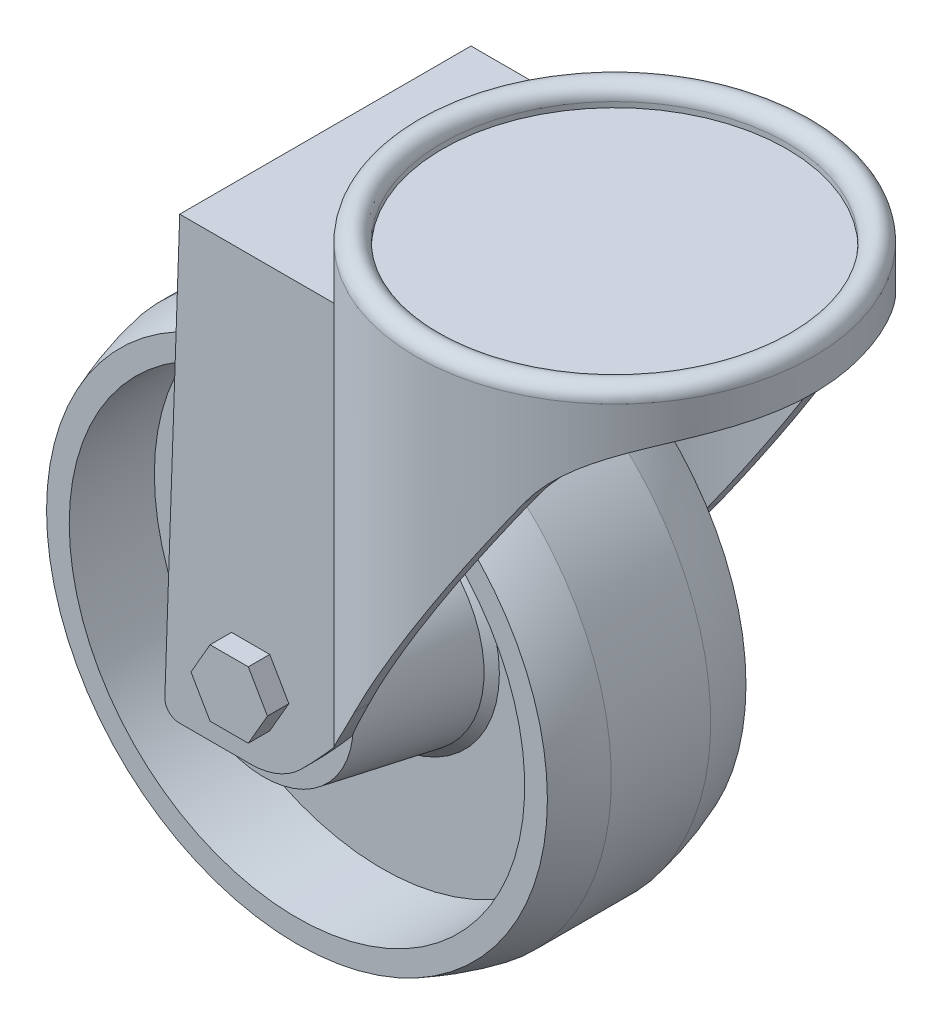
ISO-10303-21;
HEADER;
FILE_DESCRIPTION(('STEP AP214'),'2;1');
FILE_NAME('part.step','',(''),(''),'','','');
FILE_SCHEMA(('AUTOMOTIVE_DESIGN { 1 0 10303 214 1 1 1 1 }'));
ENDSEC;
DATA;
#1=APPLICATION_CONTEXT('core data for automotive mechanical design processes');
#2=APPLICATION_PROTOCOL_DEFINITION('international standard','automotive_design',2000,#1);
#3=PRODUCT_CONTEXT('',#1,'mechanical');
#4=PRODUCT('Part','Part','',(#3));
#5=PRODUCT_RELATED_PRODUCT_CATEGORY('part','',(#4));
#6=PRODUCT_DEFINITION_FORMATION('','',#4);
#7=PRODUCT_DEFINITION_CONTEXT('part definition',#1,'design');
#8=PRODUCT_DEFINITION('design','',#6,#7);
#9=PRODUCT_DEFINITION_SHAPE('','',#8);
#10=(LENGTH_UNIT() NAMED_UNIT(*) SI_UNIT(.MILLI.,.METRE.));
#11=(NAMED_UNIT(*) PLANE_ANGLE_UNIT() SI_UNIT($,.RADIAN.));
#12=(NAMED_UNIT(*) SI_UNIT($,.STERADIAN.) SOLID_ANGLE_UNIT());
#13=UNCERTAINTY_MEASURE_WITH_UNIT(LENGTH_MEASURE(1.E-05),#10,'distance_accuracy_value','');
#14=(GEOMETRIC_REPRESENTATION_CONTEXT(3) GLOBAL_UNCERTAINTY_ASSIGNED_CONTEXT((#13)) GLOBAL_UNIT_ASSIGNED_CONTEXT((#10,
#11,#12)) REPRESENTATION_CONTEXT('',''));
#15=CARTESIAN_POINT('',(0.,0.,0.));
#16=DIRECTION('',(0.,0.,1.));
#17=DIRECTION('',(1.,0.,0.));
#18=AXIS2_PLACEMENT_3D('',#15,#16,#17);
#19=CARTESIAN_POINT('',(-23.48,-78.8,-20.));
#20=DIRECTION('',(0.,0.,-1.));
#21=DIRECTION('',(0.,-1.,0.));
#22=AXIS2_PLACEMENT_3D('',#19,#20,#21);
#23=PLANE('',#22);
#24=DIRECTION('',(0.0348994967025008,0.999390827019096,0.));
#25=VECTOR('',#24,1.);
#26=CARTESIAN_POINT('',(-43.48752930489,-4.8,-20.));
#27=LINE('',#26,#25);
#28=CARTESIAN_POINT('',(-45.4798217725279,-61.8517917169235,-20.));
#29=VERTEX_POINT('',#28);
#30=CARTESIAN_POINT('',(-43.7808637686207,-13.2,-20.));
#31=VERTEX_POINT('',#30);
#32=EDGE_CURVE('E373',#29,#31,#27,.T.);
#33=ORIENTED_EDGE('',*,*,#32,.F.);
#34=CARTESIAN_POINT('',(-33.,-67.,-20.));
#35=DIRECTION('',(0.,0.,-1.));
#36=DIRECTION('',(-1.,0.,0.));
#37=AXIS2_PLACEMENT_3D('',#34,#35,#36);
#38=CIRCLE('',#37,13.5);
#39=CARTESIAN_POINT('',(-19.5959179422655,-65.3935803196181,-20.));
#40=VERTEX_POINT('',#39);
#41=EDGE_CURVE('E284',#29,#40,#38,.T.);
#42=ORIENTED_EDGE('',*,*,#41,.T.);
#43=DIRECTION('',(0.,-1.,0.));
#44=VECTOR('',#43,1.);
#45=CARTESIAN_POINT('',(-19.5959179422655,-8.,-20.));
#46=LINE('',#45,#44);
#47=CARTESIAN_POINT('',(-19.5959179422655,-13.2,-20.));
#48=VERTEX_POINT('',#47);
#49=EDGE_CURVE('E1228',#48,#40,#46,.T.);
#50=ORIENTED_EDGE('',*,*,#49,.F.);
#51=DIRECTION('',(1.,0.,0.));
#52=VECTOR('',#51,1.);
#53=CARTESIAN_POINT('',(-23.48,-13.2,-20.));
#54=LINE('',#53,#52);
#55=EDGE_CURVE('E614',#31,#48,#54,.T.);
#56=ORIENTED_EDGE('',*,*,#55,.F.);
#57=EDGE_LOOP('',(#33,#42,#50,#56));
#58=FACE_BOUND('',#57,.T.);
#59=ADVANCED_FACE('F15',(#58),#23,.F.);
#60=CARTESIAN_POINT('',(-23.48,-78.8,20.));
#61=DIRECTION('',(0.,0.,1.));
#62=DIRECTION('',(0.,1.,0.));
#63=AXIS2_PLACEMENT_3D('',#60,#61,#62);
#64=PLANE('',#63);
#65=CARTESIAN_POINT('',(-33.,-67.,20.));
#66=DIRECTION('',(0.,0.,1.));
#67=DIRECTION('',(1.,0.,0.));
#68=AXIS2_PLACEMENT_3D('',#65,#66,#67);
#69=CIRCLE('',#68,13.5);
#70=CARTESIAN_POINT('',(-41.1,-77.8,20.));
#71=VERTEX_POINT('',#70);
#72=CARTESIAN_POINT('',(-45.8085424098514,-71.2651191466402,20.));
#73=VERTEX_POINT('',#72);
#74=EDGE_CURVE('E25',#71,#73,#69,.F.);
#75=ORIENTED_EDGE('',*,*,#74,.F.);
#76=DIRECTION('',(-1.,0.,0.));
#77=VECTOR('',#76,1.);
#78=CARTESIAN_POINT('',(0.,-77.8,20.));
#79=LINE('',#78,#77);
#80=CARTESIAN_POINT('',(-43.8,-77.8,20.));
#81=VERTEX_POINT('',#80);
#82=EDGE_CURVE('E600',#71,#81,#79,.T.);
#83=ORIENTED_EDGE('',*,*,#82,.T.);
#84=CARTESIAN_POINT('',(-43.8,-75.64,20.));
#85=DIRECTION('',(0.,0.,1.));
#86=DIRECTION('',(0.,1.,0.));
#87=AXIS2_PLACEMENT_3D('',#84,#85,#86);
#88=CIRCLE('',#87,2.16);
#89=CARTESIAN_POINT('',(-45.9586841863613,-75.5646170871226,20.));
#90=VERTEX_POINT('',#89);
#91=EDGE_CURVE('E602',#90,#81,#88,.T.);
#92=ORIENTED_EDGE('',*,*,#91,.F.);
#93=DIRECTION('',(-0.0348994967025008,-0.999390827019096,0.));
#94=VECTOR('',#93,1.);
#95=CARTESIAN_POINT('',(-43.48752930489,-4.8,20.));
#96=LINE('',#95,#94);
#97=EDGE_CURVE('E40',#73,#90,#96,.T.);
#98=ORIENTED_EDGE('',*,*,#97,.F.);
#99=EDGE_LOOP('',(#75,#83,#92,#98));
#100=FACE_BOUND('',#99,.T.);
#101=ADVANCED_FACE('F334',(#100),#64,.F.);
#102=CARTESIAN_POINT('',(-33.,-67.,20.));
#103=DIRECTION('',(0.,0.,-1.));
#104=DIRECTION('',(-1.,0.,0.));
#105=AXIS2_PLACEMENT_3D('',#102,#103,#104);
#106=CIRCLE('',#105,13.5);
#107=CARTESIAN_POINT('',(-45.479821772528,-61.8517917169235,20.));
#108=VERTEX_POINT('',#107);
#109=CARTESIAN_POINT('',(-19.5959179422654,-65.3935803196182,20.));
#110=VERTEX_POINT('',#109);
#111=EDGE_CURVE('E255',#108,#110,#106,.T.);
#112=ORIENTED_EDGE('',*,*,#111,.F.);
#113=CARTESIAN_POINT('',(-43.7808637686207,-13.2,20.));
#114=VERTEX_POINT('',#113);
#115=EDGE_CURVE('E621',#114,#108,#96,.T.);
#116=ORIENTED_EDGE('',*,*,#115,.F.);
#117=DIRECTION('',(-1.,0.,0.));
#118=VECTOR('',#117,1.);
#119=CARTESIAN_POINT('',(-23.48,-13.2,20.));
#120=LINE('',#119,#118);
#121=CARTESIAN_POINT('',(-19.5959179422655,-13.2,20.));
#122=VERTEX_POINT('',#121);
#123=EDGE_CURVE('E258',#122,#114,#120,.T.);
#124=ORIENTED_EDGE('',*,*,#123,.F.);
#125=DIRECTION('',(0.,-1.,0.));
#126=VECTOR('',#125,1.);
#127=CARTESIAN_POINT('',(-19.5959179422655,-8.,20.));
#128=LINE('',#127,#126);
#129=EDGE_CURVE('E242',#110,#122,#128,.F.);
#130=ORIENTED_EDGE('',*,*,#129,.F.);
#131=EDGE_LOOP('',(#112,#116,#124,#130));
#132=FACE_BOUND('',#131,.T.);
#133=ADVANCED_FACE('F253',(#132),#64,.F.);
#134=CARTESIAN_POINT('',(-22.98,-77.8,-22.));
#135=DIRECTION('',(0.,0.,-1.));
#136=DIRECTION('',(0.,-1.,0.));
#137=AXIS2_PLACEMENT_3D('',#134,#135,#136);
#138=PLANE('',#137);
#139=DIRECTION('',(-0.0348994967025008,-0.999390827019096,0.));
#140=VECTOR('',#139,1.);
#141=CARTESIAN_POINT('',(-46.0086629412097,-76.9958213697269,-22.));
#142=LINE('',#141,#140);
#143=CARTESIAN_POINT('',(-43.7110222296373,-11.2,-22.));
#144=VERTEX_POINT('',#143);
#145=CARTESIAN_POINT('',(-45.9586841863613,-75.5646170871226,-22.));
#146=VERTEX_POINT('',#145);
#147=EDGE_CURVE('E519',#144,#146,#142,.T.);
#148=ORIENTED_EDGE('',*,*,#147,.F.);
#149=DIRECTION('',(1.,0.,0.));
#150=VECTOR('',#149,1.);
#151=CARTESIAN_POINT('',(-22.98,-11.2,-22.));
#152=LINE('',#151,#150);
#153=CARTESIAN_POINT('',(-20.3960780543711,-11.2,-22.));
#154=VERTEX_POINT('',#153);
#155=EDGE_CURVE('E535',#144,#154,#152,.T.);
#156=ORIENTED_EDGE('',*,*,#155,.T.);
#157=DIRECTION('',(0.,-1.,0.));
#158=VECTOR('',#157,1.);
#159=CARTESIAN_POINT('',(-20.3960780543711,-4.8,-22.));
#160=LINE('',#159,#158);
#161=CARTESIAN_POINT('',(-20.3960780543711,-69.2891030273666,-22.));
#162=VERTEX_POINT('',#161);
#163=EDGE_CURVE('E545',#154,#162,#160,.T.);
#164=ORIENTED_EDGE('',*,*,#163,.T.);
#165=CARTESIAN_POINT('',(-95.3668181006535,-4.63318189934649,-22.));
#166=DIRECTION('',(0.,0.,-1.));
#167=DIRECTION('',(0.,-1.,0.));
#168=AXIS2_PLACEMENT_3D('',#165,#166,#167);
#169=CIRCLE('',#168,99.);
#170=CARTESIAN_POINT('',(-25.3632467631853,-74.6367532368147,-22.));
#171=VERTEX_POINT('',#170);
#172=EDGE_CURVE('E503',#171,#162,#169,.F.);
#173=ORIENTED_EDGE('',*,*,#172,.F.);
#174=CARTESIAN_POINT('',(-33.,-67.,-22.));
#175=DIRECTION('',(0.,0.,-1.));
#176=DIRECTION('',(0.,-1.,0.));
#177=AXIS2_PLACEMENT_3D('',#174,#175,#176);
#178=CIRCLE('',#177,10.8);
#179=CARTESIAN_POINT('',(-33.,-77.8,-22.));
#180=VERTEX_POINT('',#179);
#181=EDGE_CURVE('E455',#180,#171,#178,.F.);
#182=ORIENTED_EDGE('',*,*,#181,.F.);
#183=DIRECTION('',(-1.,0.,0.));
#184=VECTOR('',#183,1.);
#185=CARTESIAN_POINT('',(-22.98,-77.8,-22.));
#186=LINE('',#185,#184);
#187=CARTESIAN_POINT('',(-43.8,-77.8,-22.));
#188=VERTEX_POINT('',#187);
#189=EDGE_CURVE('E523',#180,#188,#186,.T.);
#190=ORIENTED_EDGE('',*,*,#189,.T.);
#191=CARTESIAN_POINT('',(-43.8,-75.64,-22.));
#192=DIRECTION('',(0.,0.,-1.));
#193=DIRECTION('',(0.,-1.,0.));
#194=AXIS2_PLACEMENT_3D('',#191,#192,#193);
#195=CIRCLE('',#194,2.16);
#196=EDGE_CURVE('E492',#146,#188,#195,.F.);
#197=ORIENTED_EDGE('',*,*,#196,.F.);
#198=EDGE_LOOP('',(#148,#156,#164,#173,#182,#190,#197));
#199=FACE_BOUND('',#198,.T.);
#200=DIRECTION('',(-0.5,-0.866025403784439,0.));
#201=VECTOR('',#200,1.);
#202=CARTESIAN_POINT('',(-27.2264973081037,-67.,-22.));
#203=LINE('',#202,#201);
#204=CARTESIAN_POINT('',(-27.2264973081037,-67.,-22.));
#205=VERTEX_POINT('',#204);
#206=CARTESIAN_POINT('',(-30.1132486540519,-72.,-22.));
#207=VERTEX_POINT('',#206);
#208=EDGE_CURVE('E1119',#205,#207,#203,.T.);
#209=ORIENTED_EDGE('',*,*,#208,.F.);
#210=DIRECTION('',(0.5,-0.866025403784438,0.));
#211=VECTOR('',#210,1.);
#212=CARTESIAN_POINT('',(-30.1132486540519,-62.,-22.));
#213=LINE('',#212,#211);
#214=CARTESIAN_POINT('',(-30.1132486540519,-62.,-22.));
#215=VERTEX_POINT('',#214);
#216=EDGE_CURVE('E1118',#215,#205,#213,.T.);
#217=ORIENTED_EDGE('',*,*,#216,.F.);
#218=DIRECTION('',(1.,0.,0.));
#219=VECTOR('',#218,1.);
#220=CARTESIAN_POINT('',(-35.8867513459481,-62.,-22.));
#221=LINE('',#220,#219);
#222=CARTESIAN_POINT('',(-35.8867513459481,-62.,-22.));
#223=VERTEX_POINT('',#222);
#224=EDGE_CURVE('E1132',#223,#215,#221,.T.);
#225=ORIENTED_EDGE('',*,*,#224,.F.);
#226=DIRECTION('',(0.5,0.866025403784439,0.));
#227=VECTOR('',#226,1.);
#228=CARTESIAN_POINT('',(-38.7735026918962,-67.,-22.));
#229=LINE('',#228,#227);
#230=CARTESIAN_POINT('',(-38.7735026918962,-67.,-22.));
#231=VERTEX_POINT('',#230);
#232=EDGE_CURVE('E1128',#231,#223,#229,.T.);
#233=ORIENTED_EDGE('',*,*,#232,.F.);
#234=DIRECTION('',(-0.5,0.866025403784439,0.));
#235=VECTOR('',#234,1.);
#236=CARTESIAN_POINT('',(-35.8867513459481,-72.,-22.));
#237=LINE('',#236,#235);
#238=CARTESIAN_POINT('',(-35.8867513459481,-72.,-22.));
#239=VERTEX_POINT('',#238);
#240=EDGE_CURVE('E1125',#239,#231,#237,.T.);
#241=ORIENTED_EDGE('',*,*,#240,.F.);
#242=DIRECTION('',(-1.,0.,0.));
#243=VECTOR('',#242,1.);
#244=CARTESIAN_POINT('',(-30.1132486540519,-72.,-22.));
#245=LINE('',#244,#243);
#246=EDGE_CURVE('E1122',#207,#239,#245,.T.);
#247=ORIENTED_EDGE('',*,*,#246,.F.);
#248=EDGE_LOOP('',(#209,#217,#225,#233,#241,#247));
#249=FACE_BOUND('',#248,.T.);
#250=ADVANCED_FACE('F577',(#199,#249),#138,.T.);
#251=CARTESIAN_POINT('',(-22.98,-77.8,22.));
#252=DIRECTION('',(0.,0.,1.));
#253=DIRECTION('',(0.,1.,0.));
#254=AXIS2_PLACEMENT_3D('',#251,#252,#253);
#255=PLANE('',#254);
#256=DIRECTION('',(0.0348994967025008,0.999390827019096,0.));
#257=VECTOR('',#256,1.);
#258=CARTESIAN_POINT('',(-46.0086629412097,-76.9958213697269,22.));
#259=LINE('',#258,#257);
#260=CARTESIAN_POINT('',(-45.9586841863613,-75.5646170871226,22.));
#261=VERTEX_POINT('',#260);
#262=CARTESIAN_POINT('',(-43.7110222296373,-11.2,22.));
#263=VERTEX_POINT('',#262);
#264=EDGE_CURVE('E557',#261,#263,#259,.T.);
#265=ORIENTED_EDGE('',*,*,#264,.F.);
#266=CARTESIAN_POINT('',(-43.8,-75.64,22.));
#267=DIRECTION('',(0.,0.,1.));
#268=DIRECTION('',(0.,1.,0.));
#269=AXIS2_PLACEMENT_3D('',#266,#267,#268);
#270=CIRCLE('',#269,2.16);
#271=CARTESIAN_POINT('',(-43.8,-77.8,22.));
#272=VERTEX_POINT('',#271);
#273=EDGE_CURVE('E488',#272,#261,#270,.F.);
#274=ORIENTED_EDGE('',*,*,#273,.F.);
#275=DIRECTION('',(1.,0.,0.));
#276=VECTOR('',#275,1.);
#277=CARTESIAN_POINT('',(-22.98,-77.8,22.));
#278=LINE('',#277,#276);
#279=CARTESIAN_POINT('',(-33.,-77.8,22.));
#280=VERTEX_POINT('',#279);
#281=EDGE_CURVE('E527',#272,#280,#278,.T.);
#282=ORIENTED_EDGE('',*,*,#281,.T.);
#283=CARTESIAN_POINT('',(-33.,-67.,22.));
#284=DIRECTION('',(0.,0.,1.));
#285=DIRECTION('',(0.,1.,0.));
#286=AXIS2_PLACEMENT_3D('',#283,#284,#285);
#287=CIRCLE('',#286,10.8);
#288=CARTESIAN_POINT('',(-25.3632467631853,-74.6367532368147,22.));
#289=VERTEX_POINT('',#288);
#290=EDGE_CURVE('E553',#289,#280,#287,.F.);
#291=ORIENTED_EDGE('',*,*,#290,.F.);
#292=CARTESIAN_POINT('',(-95.3668181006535,-4.63318189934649,22.));
#293=DIRECTION('',(0.,0.,1.));
#294=DIRECTION('',(0.,1.,0.));
#295=AXIS2_PLACEMENT_3D('',#292,#293,#294);
#296=CIRCLE('',#295,99.);
#297=CARTESIAN_POINT('',(-20.3960780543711,-69.2891030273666,22.));
#298=VERTEX_POINT('',#297);
#299=EDGE_CURVE('E549',#298,#289,#296,.F.);
#300=ORIENTED_EDGE('',*,*,#299,.F.);
#301=DIRECTION('',(0.,-1.,0.));
#302=VECTOR('',#301,1.);
#303=CARTESIAN_POINT('',(-20.3960780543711,-4.8,22.));
#304=LINE('',#303,#302);
#305=CARTESIAN_POINT('',(-20.3960780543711,-11.2,22.));
#306=VERTEX_POINT('',#305);
#307=EDGE_CURVE('E538',#298,#306,#304,.F.);
#308=ORIENTED_EDGE('',*,*,#307,.T.);
#309=DIRECTION('',(-1.,0.,0.));
#310=VECTOR('',#309,1.);
#311=CARTESIAN_POINT('',(-22.98,-11.2,22.));
#312=LINE('',#311,#310);
#313=EDGE_CURVE('E531',#306,#263,#312,.T.);
#314=ORIENTED_EDGE('',*,*,#313,.T.);
#315=EDGE_LOOP('',(#265,#274,#282,#291,#300,#308,#314));
#316=FACE_BOUND('',#315,.T.);
#317=DIRECTION('',(0.5,-0.866025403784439,0.));
#318=VECTOR('',#317,1.);
#319=CARTESIAN_POINT('',(-38.7735026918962,-67.,22.));
#320=LINE('',#319,#318);
#321=CARTESIAN_POINT('',(-38.7735026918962,-67.,22.));
#322=VERTEX_POINT('',#321);
#323=CARTESIAN_POINT('',(-35.8867513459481,-72.,22.));
#324=VERTEX_POINT('',#323);
#325=EDGE_CURVE('E1169',#322,#324,#320,.T.);
#326=ORIENTED_EDGE('',*,*,#325,.F.);
#327=DIRECTION('',(-0.5,-0.866025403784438,0.));
#328=VECTOR('',#327,1.);
#329=CARTESIAN_POINT('',(-35.8867513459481,-62.,22.));
#330=LINE('',#329,#328);
#331=CARTESIAN_POINT('',(-35.8867513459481,-62.,22.));
#332=VERTEX_POINT('',#331);
#333=EDGE_CURVE('E1168',#332,#322,#330,.T.);
#334=ORIENTED_EDGE('',*,*,#333,.F.);
#335=DIRECTION('',(-1.,0.,0.));
#336=VECTOR('',#335,1.);
#337=CARTESIAN_POINT('',(-30.1132486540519,-62.,22.));
#338=LINE('',#337,#336);
#339=CARTESIAN_POINT('',(-30.1132486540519,-62.,22.));
#340=VERTEX_POINT('',#339);
#341=EDGE_CURVE('E1182',#340,#332,#338,.T.);
#342=ORIENTED_EDGE('',*,*,#341,.F.);
#343=DIRECTION('',(-0.5,0.866025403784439,0.));
#344=VECTOR('',#343,1.);
#345=CARTESIAN_POINT('',(-27.2264973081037,-67.,22.));
#346=LINE('',#345,#344);
#347=CARTESIAN_POINT('',(-27.2264973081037,-67.,22.));
#348=VERTEX_POINT('',#347);
#349=EDGE_CURVE('E1178',#348,#340,#346,.T.);
#350=ORIENTED_EDGE('',*,*,#349,.F.);
#351=DIRECTION('',(0.5,0.866025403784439,0.));
#352=VECTOR('',#351,1.);
#353=CARTESIAN_POINT('',(-30.1132486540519,-72.,22.));
#354=LINE('',#353,#352);
#355=CARTESIAN_POINT('',(-30.1132486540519,-72.,22.));
#356=VERTEX_POINT('',#355);
#357=EDGE_CURVE('E1175',#356,#348,#354,.T.);
#358=ORIENTED_EDGE('',*,*,#357,.F.);
#359=DIRECTION('',(1.,0.,0.));
#360=VECTOR('',#359,1.);
#361=CARTESIAN_POINT('',(-35.8867513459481,-72.,22.));
#362=LINE('',#361,#360);
#363=EDGE_CURVE('E1172',#324,#356,#362,.T.);
#364=ORIENTED_EDGE('',*,*,#363,.F.);
#365=EDGE_LOOP('',(#326,#334,#342,#350,#358,#364));
#366=FACE_BOUND('',#365,.T.);
#367=ADVANCED_FACE('F447',(#316,#366),#255,.T.);
#368=CARTESIAN_POINT('',(0.,-77.8,0.));
#369=DIRECTION('',(0.,-1.,0.));
#370=DIRECTION('',(1.,0.,0.));
#371=AXIS2_PLACEMENT_3D('',#368,#369,#370);
#372=PLANE('',#371);
#373=DIRECTION('',(1.,0.,0.));
#374=VECTOR('',#373,1.);
#375=CARTESIAN_POINT('',(0.,-77.8,-20.));
#376=LINE('',#375,#374);
#377=CARTESIAN_POINT('',(-43.8,-77.8,-20.));
#378=VERTEX_POINT('',#377);
#379=CARTESIAN_POINT('',(-41.1,-77.8,-20.));
#380=VERTEX_POINT('',#379);
#381=EDGE_CURVE('E359',#378,#380,#376,.T.);
#382=ORIENTED_EDGE('',*,*,#381,.F.);
#383=DIRECTION('',(0.,0.,-1.));
#384=VECTOR('',#383,1.);
#385=CARTESIAN_POINT('',(-43.8,-77.8,48.));
#386=LINE('',#385,#384);
#387=EDGE_CURVE('E478',#378,#188,#386,.T.);
#388=ORIENTED_EDGE('',*,*,#387,.T.);
#389=ORIENTED_EDGE('',*,*,#189,.F.);
#390=DIRECTION('',(0.,0.,-1.));
#391=VECTOR('',#390,1.);
#392=CARTESIAN_POINT('',(-33.,-77.8,48.));
#393=LINE('',#392,#391);
#394=CARTESIAN_POINT('',(-33.,-77.8,-20.));
#395=VERTEX_POINT('',#394);
#396=EDGE_CURVE('E469',#395,#180,#393,.T.);
#397=ORIENTED_EDGE('',*,*,#396,.F.);
#398=EDGE_CURVE('E367',#380,#395,#376,.T.);
#399=ORIENTED_EDGE('',*,*,#398,.F.);
#400=EDGE_LOOP('',(#382,#388,#389,#397,#399));
#401=FACE_BOUND('',#400,.T.);
#402=ADVANCED_FACE('F440',(#401),#372,.T.);
#403=CARTESIAN_POINT('',(-33.,-67.,48.));
#404=DIRECTION('',(0.,0.,-1.));
#405=DIRECTION('',(-1.,0.,0.));
#406=AXIS2_PLACEMENT_3D('',#403,#404,#405);
#407=CYLINDRICAL_SURFACE('',#406,10.8);
#408=DIRECTION('',(0.,0.,-1.));
#409=VECTOR('',#408,1.);
#410=CARTESIAN_POINT('',(-25.3632467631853,-74.6367532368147,48.));
#411=LINE('',#410,#409);
#412=CARTESIAN_POINT('',(-25.3632467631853,-74.6367532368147,-20.));
#413=VERTEX_POINT('',#412);
#414=EDGE_CURVE('E452',#413,#171,#411,.T.);
#415=ORIENTED_EDGE('',*,*,#414,.F.);
#416=CARTESIAN_POINT('',(-33.,-67.,-20.));
#417=DIRECTION('',(0.,0.,-1.));
#418=DIRECTION('',(0.,-1.,0.));
#419=AXIS2_PLACEMENT_3D('',#416,#417,#418);
#420=CIRCLE('',#419,10.8);
#421=EDGE_CURVE('E376',#413,#395,#420,.T.);
#422=ORIENTED_EDGE('',*,*,#421,.T.);
#423=ORIENTED_EDGE('',*,*,#396,.T.);
#424=ORIENTED_EDGE('',*,*,#181,.T.);
#425=EDGE_LOOP('',(#415,#422,#423,#424));
#426=FACE_BOUND('',#425,.T.);
#427=ADVANCED_FACE('F428',(#426),#407,.T.);
#428=CARTESIAN_POINT('',(-43.8,-75.64,48.));
#429=DIRECTION('',(0.,0.,-1.));
#430=DIRECTION('',(-1.,0.,0.));
#431=AXIS2_PLACEMENT_3D('',#428,#429,#430);
#432=CYLINDRICAL_SURFACE('',#431,2.16);
#433=ORIENTED_EDGE('',*,*,#387,.F.);
#434=CARTESIAN_POINT('',(-43.8,-75.64,-20.));
#435=DIRECTION('',(0.,0.,-1.));
#436=DIRECTION('',(0.,-1.,0.));
#437=AXIS2_PLACEMENT_3D('',#434,#435,#436);
#438=CIRCLE('',#437,2.16);
#439=CARTESIAN_POINT('',(-45.9586841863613,-75.5646170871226,-20.));
#440=VERTEX_POINT('',#439);
#441=EDGE_CURVE('E362',#378,#440,#438,.T.);
#442=ORIENTED_EDGE('',*,*,#441,.T.);
#443=DIRECTION('',(0.,0.,-1.));
#444=VECTOR('',#443,1.);
#445=CARTESIAN_POINT('',(-45.9586841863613,-75.5646170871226,48.));
#446=LINE('',#445,#444);
#447=EDGE_CURVE('E483',#440,#146,#446,.T.);
#448=ORIENTED_EDGE('',*,*,#447,.T.);
#449=ORIENTED_EDGE('',*,*,#196,.T.);
#450=EDGE_LOOP('',(#433,#442,#448,#449));
#451=FACE_BOUND('',#450,.T.);
#452=ADVANCED_FACE('F424',(#451),#432,.T.);
#453=CARTESIAN_POINT('',(-95.3668181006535,-4.63318189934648,48.));
#454=DIRECTION('',(0.,0.,-1.));
#455=DIRECTION('',(-1.,0.,0.));
#456=AXIS2_PLACEMENT_3D('',#453,#454,#455);
#457=CYLINDRICAL_SURFACE('',#456,99.);
#458=CARTESIAN_POINT('',(3.57591551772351,-8.,-27.7707188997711));
#459=CARTESIAN_POINT('',(3.55588566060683,-8.58862892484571,-27.7732932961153));
#460=CARTESIAN_POINT('',(3.53060345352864,-9.1770630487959,-27.7765321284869));
#461=CARTESIAN_POINT('',(3.46954293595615,-10.3533751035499,-27.7842269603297));
#462=CARTESIAN_POINT('',(3.43376468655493,-10.941253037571,-27.7886829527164));
#463=CARTESIAN_POINT('',(3.31070224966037,-12.7037567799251,-27.8037086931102));
#464=CARTESIAN_POINT('',(3.20768845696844,-13.877308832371,-27.8159364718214));
#465=CARTESIAN_POINT('',(2.95981204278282,-16.2203383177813,-27.843401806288));
#466=CARTESIAN_POINT('',(2.81493468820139,-17.3898141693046,-27.8586404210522));
#467=CARTESIAN_POINT('',(2.48352845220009,-19.7228425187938,-27.8901379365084));
#468=CARTESIAN_POINT('',(2.29699955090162,-20.8863950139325,-27.9063968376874));
#469=CARTESIAN_POINT('',(1.88087141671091,-23.2153597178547,-27.9375410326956));
#470=CARTESIAN_POINT('',(1.65094091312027,-24.3807129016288,-27.9524143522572));
#471=CARTESIAN_POINT('',(1.14928516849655,-26.702443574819,-27.9775305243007));
#472=CARTESIAN_POINT('',(0.877559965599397,-27.858821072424,-27.9877733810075));
#473=CARTESIAN_POINT('',(0.292736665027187,-30.1608048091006,-27.9999967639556));
#474=CARTESIAN_POINT('',(-0.0203510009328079,-31.3064136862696,-28.0019793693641));
#475=CARTESIAN_POINT('',(-0.687521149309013,-33.5855646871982,-27.9935464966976));
#476=CARTESIAN_POINT('',(-1.04160179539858,-34.7191073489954,-27.9831315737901));
#477=CARTESIAN_POINT('',(-1.69871352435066,-36.6970388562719,-27.9498562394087));
#478=CARTESIAN_POINT('',(-1.99306818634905,-37.5443818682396,-27.9306600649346));
#479=CARTESIAN_POINT('',(-2.60457136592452,-39.2304314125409,-27.8802860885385));
#480=CARTESIAN_POINT('',(-2.92171912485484,-40.0691382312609,-27.8491086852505));
#481=CARTESIAN_POINT('',(-3.57848512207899,-41.7371631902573,-27.7723560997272));
#482=CARTESIAN_POINT('',(-3.91810590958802,-42.5664802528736,-27.7267792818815));
#483=CARTESIAN_POINT('',(-4.61932212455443,-44.2146674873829,-27.618611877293));
#484=CARTESIAN_POINT('',(-4.98091754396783,-45.0335376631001,-27.5560212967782));
#485=CARTESIAN_POINT('',(-5.72431125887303,-46.6571704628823,-27.4112242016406));
#486=CARTESIAN_POINT('',(-6.10604203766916,-47.4619695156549,-27.3290803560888));
#487=CARTESIAN_POINT('',(-6.89000053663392,-49.058894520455,-27.1420393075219));
#488=CARTESIAN_POINT('',(-7.29222879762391,-49.8510201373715,-27.0371415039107));
#489=CARTESIAN_POINT('',(-8.11604149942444,-51.4208656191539,-26.8013689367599));
#490=CARTESIAN_POINT('',(-8.53761844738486,-52.1985908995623,-26.6705041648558));
#491=CARTESIAN_POINT('',(-9.39894845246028,-53.7382070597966,-26.3792796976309));
#492=CARTESIAN_POINT('',(-9.83869965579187,-54.5000995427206,-26.2189230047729));
#493=CARTESIAN_POINT('',(-10.8558328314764,-56.2096419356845,-25.8171542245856));
#494=CARTESIAN_POINT('',(-11.4383196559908,-57.1519098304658,-25.5655470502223));
#495=CARTESIAN_POINT('',(-12.6257080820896,-59.0033758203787,-25.0004748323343));
#496=CARTESIAN_POINT('',(-13.2306096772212,-59.9125739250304,-24.6870098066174));
#497=CARTESIAN_POINT('',(-14.4563103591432,-61.6915321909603,-23.9898271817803));
#498=CARTESIAN_POINT('',(-15.077095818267,-62.5613244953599,-23.6061681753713));
#499=CARTESIAN_POINT('',(-16.3269005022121,-64.2553087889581,-22.7596491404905));
#500=CARTESIAN_POINT('',(-16.9559171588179,-65.0795146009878,-22.296813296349));
#501=CARTESIAN_POINT('',(-18.0506205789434,-66.4698723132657,-21.4134277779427));
#502=CARTESIAN_POINT('',(-18.5168578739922,-67.0480308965,-21.0124326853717));
#503=CARTESIAN_POINT('',(-19.4425898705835,-68.1708927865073,-20.15892054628));
#504=CARTESIAN_POINT('',(-19.9020848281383,-68.7155973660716,-19.7064054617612));
#505=CARTESIAN_POINT('',(-20.8075550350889,-69.7668665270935,-18.7477909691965));
#506=CARTESIAN_POINT('',(-21.2535432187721,-70.273468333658,-18.2417450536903));
#507=CARTESIAN_POINT('',(-21.9069667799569,-71.001524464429,-17.4414290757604));
#508=CARTESIAN_POINT('',(-22.1221721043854,-71.2388920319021,-17.1677959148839));
#509=CARTESIAN_POINT('',(-22.5464997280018,-71.7025486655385,-16.6065990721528));
#510=CARTESIAN_POINT('',(-22.7556204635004,-71.9288348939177,-16.3190318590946));
#511=CARTESIAN_POINT('',(-23.2905204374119,-72.5024709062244,-15.5525797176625));
#512=CARTESIAN_POINT('',(-23.6106891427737,-72.8406348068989,-15.0627975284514));
#513=CARTESIAN_POINT('',(-24.2279161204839,-73.4841476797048,-14.0485034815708));
#514=CARTESIAN_POINT('',(-24.5249792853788,-73.7895036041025,-13.5239990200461));
#515=CARTESIAN_POINT('',(-25.0913684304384,-74.3649838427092,-12.4417098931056));
#516=CARTESIAN_POINT('',(-25.3606969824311,-74.6351114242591,-11.8839283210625));
#517=CARTESIAN_POINT('',(-25.8669521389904,-75.1377631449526,-10.7374767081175));
#518=CARTESIAN_POINT('',(-26.1038782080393,-75.3702866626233,-10.1488061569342));
#519=CARTESIAN_POINT('',(-26.5423588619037,-75.7969940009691,-8.9397700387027));
#520=CARTESIAN_POINT('',(-26.7436564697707,-75.9909004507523,-8.31921280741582));
#521=CARTESIAN_POINT('',(-27.1047064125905,-76.3363662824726,-7.05459006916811));
#522=CARTESIAN_POINT('',(-27.2644579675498,-76.4879248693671,-6.41052412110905));
#523=CARTESIAN_POINT('',(-27.538879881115,-76.7470257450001,-5.10442966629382));
#524=CARTESIAN_POINT('',(-27.6535682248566,-76.8545855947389,-4.4424084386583));
#525=CARTESIAN_POINT('',(-27.8353401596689,-77.0245839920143,-3.10617065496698));
#526=CARTESIAN_POINT('',(-27.9024295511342,-77.0870280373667,-2.43195559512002));
#527=CARTESIAN_POINT('',(-27.9825018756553,-77.1614964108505,-1.15701051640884));
#528=CARTESIAN_POINT('',(-28.0008930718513,-77.1785615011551,-0.556903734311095));
#529=CARTESIAN_POINT('',(-27.9990404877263,-77.1768417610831,0.643166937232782));
#530=CARTESIAN_POINT('',(-27.9788002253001,-77.1580601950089,1.24313083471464));
#531=CARTESIAN_POINT('',(-27.9000687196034,-77.0848249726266,2.43817402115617));
#532=CARTESIAN_POINT('',(-27.8415877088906,-77.030380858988,3.03325457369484));
#533=CARTESIAN_POINT('',(-27.6874453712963,-76.8863036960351,4.21426121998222));
#534=CARTESIAN_POINT('',(-27.5917838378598,-76.796670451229,4.80018726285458));
#535=CARTESIAN_POINT('',(-27.3687687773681,-76.5865549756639,5.93936766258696));
#536=CARTESIAN_POINT('',(-27.2425793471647,-76.4672019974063,6.49305980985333));
#537=CARTESIAN_POINT('',(-26.9590787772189,-76.1972753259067,7.58459115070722));
#538=CARTESIAN_POINT('',(-26.8017687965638,-76.0467027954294,8.12243093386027));
#539=CARTESIAN_POINT('',(-26.4584334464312,-75.7154678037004,9.17932785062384));
#540=CARTESIAN_POINT('',(-26.2724074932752,-75.534804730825,9.69838460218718));
#541=CARTESIAN_POINT('',(-25.8743411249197,-75.144693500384,10.7152532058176));
#542=CARTESIAN_POINT('',(-25.6622993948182,-74.9352438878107,11.2130639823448));
#543=CARTESIAN_POINT('',(-25.1994232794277,-74.4733629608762,12.219532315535));
#544=CARTESIAN_POINT('',(-24.9469120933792,-74.2189487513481,12.7265078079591));
#545=CARTESIAN_POINT('',(-24.4190697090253,-73.6806949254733,13.7120973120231));
#546=CARTESIAN_POINT('',(-24.1437381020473,-73.3968547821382,14.1907108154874));
#547=CARTESIAN_POINT('',(-23.5737941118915,-72.8015870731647,15.1186242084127));
#548=CARTESIAN_POINT('',(-23.2791752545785,-72.4901502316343,15.5679141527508));
#549=CARTESIAN_POINT('',(-22.6742354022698,-71.8417024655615,16.4365238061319));
#550=CARTESIAN_POINT('',(-22.3639110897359,-71.5046861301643,16.8558371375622));
#551=CARTESIAN_POINT('',(-21.5758986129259,-70.636148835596,17.8624031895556));
#552=CARTESIAN_POINT('',(-21.090654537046,-70.0901821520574,18.4313694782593));
#553=CARTESIAN_POINT('',(-20.1027780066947,-68.9518630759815,19.5041167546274));
#554=CARTESIAN_POINT('',(-19.6001388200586,-68.3594926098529,20.0078721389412));
#555=CARTESIAN_POINT('',(-18.5853896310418,-67.1331553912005,20.9538834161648));
#556=CARTESIAN_POINT('',(-18.0732657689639,-66.499123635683,21.3960396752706));
#557=CARTESIAN_POINT('',(-17.0475523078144,-65.1953857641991,22.2219398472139));
#558=CARTESIAN_POINT('',(-16.533962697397,-64.5256793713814,22.6056833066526));
#559=CARTESIAN_POINT('',(-15.6394063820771,-63.3268861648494,23.229878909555));
#560=CARTESIAN_POINT('',(-15.2574528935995,-62.8046099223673,23.4821426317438));
#561=CARTESIAN_POINT('',(-14.4979986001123,-61.7441204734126,23.9584845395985));
#562=CARTESIAN_POINT('',(-14.1204982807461,-61.2059055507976,24.1825596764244));
#563=CARTESIAN_POINT('',(-13.37157736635,-60.1148776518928,24.6045879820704));
#564=CARTESIAN_POINT('',(-13.0001593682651,-59.5620586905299,24.8025302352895));
#565=CARTESIAN_POINT('',(-12.265005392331,-58.4433733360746,25.1741788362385));
#566=CARTESIAN_POINT('',(-11.9012692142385,-57.8775072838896,25.3478858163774));
#567=CARTESIAN_POINT('',(-11.1819668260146,-56.7327852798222,25.6733275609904));
#568=CARTESIAN_POINT('',(-10.8264178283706,-56.1539062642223,25.8250190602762));
#569=CARTESIAN_POINT('',(-10.1252150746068,-54.9852770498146,26.1079095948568));
#570=CARTESIAN_POINT('',(-9.77956128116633,-54.395526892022,26.2391087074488));
#571=CARTESIAN_POINT('',(-9.09900735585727,-53.2061599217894,26.482799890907));
#572=CARTESIAN_POINT('',(-8.7641058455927,-52.6065443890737,26.5952943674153));
#573=CARTESIAN_POINT('',(-8.10566872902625,-51.3981834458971,26.8033077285));
#574=CARTESIAN_POINT('',(-7.7821337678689,-50.7894375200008,26.8988256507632));
#575=CARTESIAN_POINT('',(-6.93595250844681,-49.1562305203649,27.1328878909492));
#576=CARTESIAN_POINT('',(-6.4238536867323,-48.1243192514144,27.2578475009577));
#577=CARTESIAN_POINT('',(-5.43466520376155,-46.0401741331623,27.4721765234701));
#578=CARTESIAN_POINT('',(-4.95758039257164,-44.9879374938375,27.561541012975));
#579=CARTESIAN_POINT('',(-4.03958113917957,-42.8650267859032,27.7109755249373));
#580=CARTESIAN_POINT('',(-3.59868897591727,-41.7943418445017,27.7710276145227));
#581=CARTESIAN_POINT('',(-2.75444321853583,-39.637316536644,27.8674277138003));
#582=CARTESIAN_POINT('',(-2.35108801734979,-38.5509768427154,27.9037767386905));
#583=CARTESIAN_POINT('',(-1.58227532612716,-36.3633729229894,27.9579154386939));
#584=CARTESIAN_POINT('',(-1.21685434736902,-35.2620954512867,27.9756873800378));
#585=CARTESIAN_POINT('',(-0.524911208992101,-33.0472427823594,27.997219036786));
#586=CARTESIAN_POINT('',(-0.198389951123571,-31.9336673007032,28.0009784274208));
#587=CARTESIAN_POINT('',(0.415170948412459,-29.696215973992,27.9986019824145));
#588=CARTESIAN_POINT('',(0.702227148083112,-28.5723446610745,27.9924703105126));
#589=CARTESIAN_POINT('',(1.23664478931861,-26.3153366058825,27.9739551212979));
#590=CARTESIAN_POINT('',(1.48400853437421,-25.1822004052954,27.9615719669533));
#591=CARTESIAN_POINT('',(1.97615446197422,-22.720994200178,27.9314393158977));
#592=CARTESIAN_POINT('',(2.21382560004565,-21.3915049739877,27.9131422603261));
#593=CARTESIAN_POINT('',(2.63455809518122,-18.7240645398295,27.8765805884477));
#594=CARTESIAN_POINT('',(2.81762679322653,-17.3861144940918,27.8583159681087));
#595=CARTESIAN_POINT('',(3.05076444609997,-15.3770963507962,27.8334109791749));
#596=CARTESIAN_POINT('',(3.12146852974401,-14.7083783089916,27.8255375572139));
#597=CARTESIAN_POINT('',(3.24923920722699,-13.3696202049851,27.8109080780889));
#598=CARTESIAN_POINT('',(3.30630585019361,-12.6995801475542,27.8041520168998));
#599=CARTESIAN_POINT('',(3.40678236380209,-11.3583696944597,27.7920209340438));
#600=CARTESIAN_POINT('',(3.45019026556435,-10.6871991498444,27.7866461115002));
#601=CARTESIAN_POINT('',(3.52332109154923,-9.3440986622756,27.7774622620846));
#602=CARTESIAN_POINT('',(3.55304394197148,-8.67216871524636,27.7736532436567));
#603=CARTESIAN_POINT('',(3.57591551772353,-8.,27.7707188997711));
#604=B_SPLINE_CURVE_WITH_KNOTS('',3,(#458,#459,#460,#461,#462,#463,#464,#465,#466,#467,#468,
#469,#470,#471,#472,#473,#474,#475,#476,#477,#478,#479,#480,#481,#482,#483,#484,#485,#486,#487,
#488,#489,#490,#491,#492,#493,#494,#495,#496,#497,#498,#499,#500,#501,#502,#503,#504,#505,#506,
#507,#508,#509,#510,#511,#512,#513,#514,#515,#516,#517,#518,#519,#520,#521,#522,#523,#524,#525,
#526,#527,#528,#529,#530,#531,#532,#533,#534,#535,#536,#537,#538,#539,#540,#541,#542,#543,#544,
#545,#546,#547,#548,#549,#550,#551,#552,#553,#554,#555,#556,#557,#558,#559,#560,#561,#562,#563,
#564,#565,#566,#567,#568,#569,#570,#571,#572,#573,#574,#575,#576,#577,#578,#579,#580,#581,#582,
#583,#584,#585,#586,#587,#588,#589,#590,#591,#592,#593,#594,#595,#596,#597,#598,#599,#600,#601,
#602,#603),.UNSPECIFIED.,.F.,.F.,(4,2,2,2,2,2,2,2,2,2,2,2,2,2,2,2,2,2,2,2,2,2,2,2,2,2,2,2,2,2,2,
2,2,2,2,2,2,2,2,2,2,2,2,2,2,2,2,2,2,2,2,2,2,2,2,2,2,2,2,2,2,2,2,2,2,2,2,2,2,2,2,2,4),(0.,
1.76687572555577,3.53374116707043,7.06730313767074,10.6021101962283,14.1369189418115,
17.6998867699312,21.262851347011,24.8249190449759,28.386827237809,31.0781112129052,
33.7693056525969,36.4608058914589,39.1523051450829,41.8352914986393,44.5183486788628,
47.2003754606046,49.8821293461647,53.2878921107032,56.6936538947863,60.0965856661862,
63.4984798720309,66.0286608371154,68.5587454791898,71.0863253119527,72.3500005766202,
73.6139977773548,75.6394145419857,77.6644012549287,79.6892000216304,81.7140322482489,
83.7529214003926,85.791848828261,87.8299616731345,89.8678261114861,91.6674623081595,
93.4669346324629,95.2659256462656,97.0649266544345,98.8038945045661,100.542797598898,
102.281736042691,104.020762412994,105.881581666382,107.742434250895,109.603914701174,
111.465790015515,114.239214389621,117.013724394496,119.792671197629,122.571639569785,
124.654311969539,126.737209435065,128.820974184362,130.904684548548,132.992435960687,
135.080179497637,137.167654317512,139.255247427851,142.730017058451,146.205267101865,
149.682640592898,153.159865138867,156.640406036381,160.121027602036,163.600184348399,
167.079139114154,171.130077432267,175.180470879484,177.197830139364,179.215182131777,
181.232824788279,183.250478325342),.UNSPECIFIED.);
#605=CARTESIAN_POINT('',(-11.6570364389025,-57.4883846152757,-25.4580734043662));
#606=VERTEX_POINT('',#605);
#607=CARTESIAN_POINT('',(-19.5959179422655,-68.3495117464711,-20.));
#608=VERTEX_POINT('',#607);
#609=EDGE_CURVE('E392',#606,#608,#604,.T.);
#610=ORIENTED_EDGE('',*,*,#609,.T.);
#611=CARTESIAN_POINT('',(-95.3668181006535,-4.63318189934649,-20.));
#612=DIRECTION('',(0.,0.,-1.));
#613=DIRECTION('',(0.,-1.,0.));
#614=AXIS2_PLACEMENT_3D('',#611,#612,#613);
#615=CIRCLE('',#614,99.);
#616=EDGE_CURVE('E622',#608,#413,#615,.T.);
#617=ORIENTED_EDGE('',*,*,#616,.T.);
#618=ORIENTED_EDGE('',*,*,#414,.T.);
#619=ORIENTED_EDGE('',*,*,#172,.T.);
#620=CARTESIAN_POINT('',(-28.676363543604,-77.8,-8.81284142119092));
#621=CARTESIAN_POINT('',(-28.5657057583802,-77.6991339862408,-9.1729522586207));
#622=CARTESIAN_POINT('',(-28.4487380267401,-77.5920631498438,-9.52936352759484));
#623=CARTESIAN_POINT('',(-28.2028816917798,-77.3657995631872,-10.2340871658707));
#624=CARTESIAN_POINT('',(-28.0739945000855,-77.2466082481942,-10.5824004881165));
#625=CARTESIAN_POINT('',(-27.805116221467,-76.9965018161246,-11.2699445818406));
#626=CARTESIAN_POINT('',(-27.6651372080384,-76.8655994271,-11.6091847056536));
#627=CARTESIAN_POINT('',(-27.3747013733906,-76.5922803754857,-12.2783888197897));
#628=CARTESIAN_POINT('',(-27.224244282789,-76.4498634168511,-12.6083525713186));
#629=CARTESIAN_POINT('',(-26.7609916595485,-76.0083972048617,-13.5778869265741));
#630=CARTESIAN_POINT('',(-26.4338748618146,-75.6928763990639,-14.2032850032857));
#631=CARTESIAN_POINT('',(-25.7474343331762,-75.0204834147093,-15.4127743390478));
#632=CARTESIAN_POINT('',(-25.3881027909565,-74.6636012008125,-15.9968555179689));
#633=CARTESIAN_POINT('',(-24.6449441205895,-73.9130069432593,-17.1195184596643));
#634=CARTESIAN_POINT('',(-24.2612292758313,-73.5194603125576,-17.6582855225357));
#635=CARTESIAN_POINT('',(-23.4737613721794,-72.6972133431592,-18.6923770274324));
#636=CARTESIAN_POINT('',(-23.070009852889,-72.2685157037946,-19.187704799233));
#637=CARTESIAN_POINT('',(-22.2470037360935,-71.377927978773,-20.1361846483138));
#638=CARTESIAN_POINT('',(-21.8277187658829,-70.9159709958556,-20.5892472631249));
#639=CARTESIAN_POINT('',(-20.9793194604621,-69.9624044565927,-21.4530823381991));
#640=CARTESIAN_POINT('',(-20.5502036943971,-69.4707905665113,-21.8638485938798));
#641=CARTESIAN_POINT('',(-19.7851204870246,-68.5758924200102,-22.5555077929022));
#642=CARTESIAN_POINT('',(-19.4502244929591,-68.1780278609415,-22.8446573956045));
#643=CARTESIAN_POINT('',(-18.7790062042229,-67.3674169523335,-23.399541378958));
#644=CARTESIAN_POINT('',(-18.4426837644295,-66.9546690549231,-23.6652733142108));
#645=CARTESIAN_POINT('',(-17.4338618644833,-65.6955219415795,-24.4289218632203));
#646=CARTESIAN_POINT('',(-16.7615953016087,-64.8283211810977,-24.8932134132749));
#647=CARTESIAN_POINT('',(-15.4279661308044,-63.0456998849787,-25.7410846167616));
#648=CARTESIAN_POINT('',(-14.7666208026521,-62.1302110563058,-26.1245459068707));
#649=CARTESIAN_POINT('',(-13.4638433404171,-60.2587370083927,-26.8192062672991));
#650=CARTESIAN_POINT('',(-12.8224108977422,-59.3027524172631,-27.1304064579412));
#651=CARTESIAN_POINT('',(-11.6972893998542,-57.5600144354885,-27.6309405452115));
#652=CARTESIAN_POINT('',(-11.2087038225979,-56.7797615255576,-27.8321469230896));
#653=CARTESIAN_POINT('',(-10.2499824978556,-55.199753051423,-28.1993155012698));
#654=CARTESIAN_POINT('',(-9.77984907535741,-54.399995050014,-28.3652732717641));
#655=CARTESIAN_POINT('',(-8.85969705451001,-52.782782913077,-28.6660104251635));
#656=CARTESIAN_POINT('',(-8.409687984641,-51.9653206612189,-28.8007751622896));
#657=CARTESIAN_POINT('',(-7.53141674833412,-50.3148643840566,-29.0428172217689));
#658=CARTESIAN_POINT('',(-7.1031539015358,-49.4818708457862,-29.1500954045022));
#659=CARTESIAN_POINT('',(-6.26765605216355,-47.79828665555,-29.3411128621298));
#660=CARTESIAN_POINT('',(-5.86051879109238,-46.9476359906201,-29.4247495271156));
#661=CARTESIAN_POINT('',(-5.0700964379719,-45.2335856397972,-29.5711965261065));
#662=CARTESIAN_POINT('',(-4.68681128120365,-44.3701859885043,-29.6340069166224));
#663=CARTESIAN_POINT('',(-3.94478558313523,-42.6319306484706,-29.7418765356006));
#664=CARTESIAN_POINT('',(-3.5860424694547,-41.7570761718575,-29.7869376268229));
#665=CARTESIAN_POINT('',(-2.89355814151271,-39.9968753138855,-29.8621593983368));
#666=CARTESIAN_POINT('',(-2.55981820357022,-39.1115283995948,-29.8923193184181));
#667=CARTESIAN_POINT('',(-1.75436837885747,-36.8782980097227,-29.9526040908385));
#668=CARTESIAN_POINT('',(-1.29887850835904,-35.5243187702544,-29.9749001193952));
#669=CARTESIAN_POINT('',(-0.446849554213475,-32.7977016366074,-29.9996981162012));
#670=CARTESIAN_POINT('',(-0.0503160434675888,-31.4250619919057,-30.0021982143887));
#671=CARTESIAN_POINT('',(0.683150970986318,-28.6632825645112,-29.9944643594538));
#672=CARTESIAN_POINT('',(1.02005550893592,-27.2741351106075,-29.9842242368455));
#673=CARTESIAN_POINT('',(1.6333979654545,-24.4826222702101,-29.9570735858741));
#674=CARTESIAN_POINT('',(1.90983569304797,-23.0802568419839,-29.9401630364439));
#675=CARTESIAN_POINT('',(2.39908134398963,-20.2801337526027,-29.9049139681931));
#676=CARTESIAN_POINT('',(2.61254498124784,-18.8824902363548,-29.8865928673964));
#677=CARTESIAN_POINT('',(2.97943354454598,-16.0792622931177,-29.8522535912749));
#678=CARTESIAN_POINT('',(3.13285843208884,-14.6736778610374,-29.8362354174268));
#679=CARTESIAN_POINT('',(3.31770619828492,-12.5618478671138,-29.8160439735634));
#680=CARTESIAN_POINT('',(3.37176483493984,-11.8575316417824,-29.8099539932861));
#681=CARTESIAN_POINT('',(3.46479691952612,-10.4478842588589,-29.7992854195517));
#682=CARTESIAN_POINT('',(3.50377046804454,-9.74255310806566,-29.7947068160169));
#683=CARTESIAN_POINT('',(3.56661220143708,-8.33120068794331,-29.7872509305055));
#684=CARTESIAN_POINT('',(3.59048014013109,-7.62517940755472,-29.7843736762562));
#685=CARTESIAN_POINT('',(3.62310021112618,-6.21277701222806,-29.7804167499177));
#686=CARTESIAN_POINT('',(3.63185222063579,-5.50639589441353,-29.7793370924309));
#687=CARTESIAN_POINT('',(3.63304135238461,-4.8,-29.7792043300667));
#688=B_SPLINE_CURVE_WITH_KNOTS('',3,(#620,#621,#622,#623,#624,#625,#626,#627,#628,#629,#630,
#631,#632,#633,#634,#635,#636,#637,#638,#639,#640,#641,#642,#643,#644,#645,#646,#647,#648,#649,
#650,#651,#652,#653,#654,#655,#656,#657,#658,#659,#660,#661,#662,#663,#664,#665,#666,#667,#668,
#669,#670,#671,#672,#673,#674,#675,#676,#677,#678,#679,#680,#681,#682,#683,#684,#685,#686,#687),
.UNSPECIFIED.,.F.,.F.,(4,2,2,2,2,2,2,2,2,2,2,2,2,2,2,2,2,2,2,2,2,2,2,2,2,2,2,2,2,2,2,2,2,4),(0.,
1.16984603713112,2.33955370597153,3.50800518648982,4.6764867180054,6.9924671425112,
9.3090106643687,11.6155671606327,13.921946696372,16.233102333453,18.5445965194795,
20.3290224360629,22.1136344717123,25.6833224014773,29.2582018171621,32.8330258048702,
35.6589857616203,38.4853006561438,41.3129398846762,44.1404905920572,46.9801314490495,
49.8197646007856,52.6590996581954,55.4985795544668,59.7830879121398,64.068001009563,
68.3549898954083,72.6419923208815,76.8826389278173,81.1232882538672,83.2423967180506,
85.3614910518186,87.4806199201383,89.5997660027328),.UNSPECIFIED.);
#689=CARTESIAN_POINT('',(-11.6570364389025,-57.4883846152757,-27.6426030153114));
#690=VERTEX_POINT('',#689);
#691=EDGE_CURVE('E506',#162,#690,#688,.T.);
#692=ORIENTED_EDGE('',*,*,#691,.T.);
#693=DIRECTION('',(0.,0.,-1.));
#694=VECTOR('',#693,1.);
#695=CARTESIAN_POINT('',(-11.6570364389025,-57.4883846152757,48.));
#696=LINE('',#695,#694);
#697=EDGE_CURVE('E472',#606,#690,#696,.T.);
#698=ORIENTED_EDGE('',*,*,#697,.F.);
#699=EDGE_LOOP('',(#610,#617,#618,#619,#692,#698));
#700=FACE_BOUND('',#699,.T.);
#701=ADVANCED_FACE('F437',(#700),#457,.T.);
#702=CARTESIAN_POINT('',(-11.6570364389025,-57.4883846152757,48.));
#703=DIRECTION('',(-0.845553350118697,0.533890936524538,0.));
#704=DIRECTION('',(-0.533890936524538,-0.845553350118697,0.));
#705=AXIS2_PLACEMENT_3D('',#702,#703,#704);
#706=PLANE('',#705);
#707=CARTESIAN_POINT('',(-11.6570364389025,-57.4883846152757,27.6426030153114));
#708=VERTEX_POINT('',#707);
#709=CARTESIAN_POINT('',(-11.6570364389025,-57.4883846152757,25.4580734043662));
#710=VERTEX_POINT('',#709);
#711=EDGE_CURVE('E462',#708,#710,#696,.T.);
#712=ORIENTED_EDGE('',*,*,#711,.T.);
#713=CARTESIAN_POINT('',(0.,-39.026475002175,0.));
#714=DIRECTION('',(-0.845553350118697,0.533890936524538,0.));
#715=DIRECTION('',(-0.533890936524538,-0.845553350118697,0.));
#716=AXIS2_PLACEMENT_3D('',#713,#714,#715);
#717=ELLIPSE('',#716,52.4451682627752,28.);
#718=CARTESIAN_POINT('',(13.2580436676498,-18.0289594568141,24.6622034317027));
#719=VERTEX_POINT('',#718);
#720=EDGE_CURVE('E261',#710,#719,#717,.T.);
#721=ORIENTED_EDGE('',*,*,#720,.T.);
#722=DIRECTION('',(0.,0.,-1.));
#723=VECTOR('',#722,1.);
#724=CARTESIAN_POINT('',(13.2580436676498,-18.0289594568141,48.));
#725=LINE('',#724,#723);
#726=CARTESIAN_POINT('',(13.2580436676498,-18.0289594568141,26.9114153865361));
#727=VERTEX_POINT('',#726);
#728=EDGE_CURVE('E1316',#727,#719,#725,.T.);
#729=ORIENTED_EDGE('',*,*,#728,.F.);
#730=CARTESIAN_POINT('',(0.,-39.026475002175,0.));
#731=DIRECTION('',(-0.845553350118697,0.533890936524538,0.));
#732=DIRECTION('',(-0.533890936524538,-0.845553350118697,0.));
#733=AXIS2_PLACEMENT_3D('',#730,#731,#732);
#734=ELLIPSE('',#733,56.1912517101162,30.);
#735=EDGE_CURVE('E567',#727,#708,#734,.F.);
#736=ORIENTED_EDGE('',*,*,#735,.T.);
#737=EDGE_LOOP('',(#712,#721,#729,#736));
#738=FACE_BOUND('',#737,.T.);
#739=ADVANCED_FACE('F434',(#738),#706,.F.);
#740=CARTESIAN_POINT('',(-33.,-77.8,20.));
#741=VERTEX_POINT('',#740);
#742=EDGE_CURVE('E267',#741,#71,#79,.T.);
#743=ORIENTED_EDGE('',*,*,#742,.F.);
#744=EDGE_CURVE('E475',#280,#741,#393,.T.);
#745=ORIENTED_EDGE('',*,*,#744,.F.);
#746=ORIENTED_EDGE('',*,*,#281,.F.);
#747=EDGE_CURVE('E479',#272,#81,#386,.T.);
#748=ORIENTED_EDGE('',*,*,#747,.T.);
#749=ORIENTED_EDGE('',*,*,#82,.F.);
#750=EDGE_LOOP('',(#743,#745,#746,#748,#749));
#751=FACE_BOUND('',#750,.T.);
#752=ADVANCED_FACE('F448',(#751),#372,.T.);
#753=CARTESIAN_POINT('',(0.,-4.8,0.));
#754=DIRECTION('',(0.,-1.,0.));
#755=DIRECTION('',(0.,0.,-1.));
#756=AXIS2_PLACEMENT_3D('',#753,#754,#755);
#757=CYLINDRICAL_SURFACE('',#756,30.);
#758=CARTESIAN_POINT('',(3.6330413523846,-4.8,29.7792043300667));
#759=CARTESIAN_POINT('',(3.63197638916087,-5.43245935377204,29.7793263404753));
#760=CARTESIAN_POINT('',(3.62484923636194,-6.06490705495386,29.7802034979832));
#761=CARTESIAN_POINT('',(3.59847682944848,-7.32954225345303,29.7834058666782));
#762=CARTESIAN_POINT('',(3.57923164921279,-7.96172975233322,29.7857310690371));
#763=CARTESIAN_POINT('',(3.52862976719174,-9.22560749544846,29.7917672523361));
#764=CARTESIAN_POINT('',(3.49727321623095,-9.85729774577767,29.7954782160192));
#765=CARTESIAN_POINT('',(3.42246209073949,-11.1199469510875,29.804163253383));
#766=CARTESIAN_POINT('',(3.37900745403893,-11.7509059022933,29.8091373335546));
#767=CARTESIAN_POINT('',(3.23049064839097,-13.6426871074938,29.8257288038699));
#768=CARTESIAN_POINT('',(3.10728730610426,-14.902120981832,29.8390138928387));
#769=CARTESIAN_POINT('',(2.81270599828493,-17.4152732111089,29.8682191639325));
#770=CARTESIAN_POINT('',(2.64132801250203,-18.6689915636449,29.8841393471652));
#771=CARTESIAN_POINT('',(2.24912133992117,-21.1786941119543,29.9162244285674));
#772=CARTESIAN_POINT('',(2.0279175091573,-22.4346197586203,29.9323902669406));
#773=CARTESIAN_POINT('',(1.53715299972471,-24.9370267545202,29.9616016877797));
#774=CARTESIAN_POINT('',(1.26759226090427,-26.1835080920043,29.9746472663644));
#775=CARTESIAN_POINT('',(0.680581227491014,-28.664872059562,29.9937162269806));
#776=CARTESIAN_POINT('',(0.363142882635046,-29.8997575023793,29.9997413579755));
#777=CARTESIAN_POINT('',(-0.319186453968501,-32.3563236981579,30.0002425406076));
#778=CARTESIAN_POINT('',(-0.684075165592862,-33.5780050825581,29.9947191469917));
#779=CARTESIAN_POINT('',(-1.36717797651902,-35.7137905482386,29.970280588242));
#780=CARTESIAN_POINT('',(-1.67547308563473,-36.6311198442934,29.9549104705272));
#781=CARTESIAN_POINT('',(-2.31872585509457,-38.4560808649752,29.9119950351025));
#782=CARTESIAN_POINT('',(-2.6536825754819,-39.3637129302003,29.8844501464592));
#783=CARTESIAN_POINT('',(-3.34989250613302,-41.1683825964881,29.8144366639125));
#784=CARTESIAN_POINT('',(-3.71114867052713,-42.0654189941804,29.7719663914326));
#785=CARTESIAN_POINT('',(-4.45940429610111,-43.8476710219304,29.6691142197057));
#786=CARTESIAN_POINT('',(-4.84640374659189,-44.7328866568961,29.6087323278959));
#787=CARTESIAN_POINT('',(-5.64409049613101,-46.4871822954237,29.4670624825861));
#788=CARTESIAN_POINT('',(-6.0546908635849,-47.3563076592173,29.3858478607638));
#789=CARTESIAN_POINT('',(-6.89995036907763,-49.0801711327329,29.198939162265));
#790=CARTESIAN_POINT('',(-7.33461021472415,-49.9349088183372,29.0932443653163));
#791=CARTESIAN_POINT('',(-8.2266832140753,-51.6279897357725,28.8536808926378));
#792=CARTESIAN_POINT('',(-8.68408656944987,-52.4663398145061,28.7198242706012));
#793=CARTESIAN_POINT('',(-9.62030761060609,-54.1250284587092,28.4199093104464));
#794=CARTESIAN_POINT('',(-10.0991228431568,-54.9453690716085,28.2538546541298));
#795=CARTESIAN_POINT('',(-11.1902212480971,-56.7547789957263,27.8423011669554));
#796=CARTESIAN_POINT('',(-11.807618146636,-57.7386506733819,27.5873070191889));
#797=CARTESIAN_POINT('',(-13.0676159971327,-59.671092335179,27.0132673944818));
#798=CARTESIAN_POINT('',(-13.7102164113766,-60.6196630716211,26.6942232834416));
#799=CARTESIAN_POINT('',(-15.0137702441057,-62.4749637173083,25.9834056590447));
#800=CARTESIAN_POINT('',(-15.6747070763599,-63.3817295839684,25.59169616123));
#801=CARTESIAN_POINT('',(-17.0070019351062,-65.147320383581,24.7263512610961));
#802=CARTESIAN_POINT('',(-17.6783570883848,-66.0061582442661,24.2527380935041));
#803=CARTESIAN_POINT('',(-18.8622661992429,-67.4720305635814,23.3374173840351));
#804=CARTESIAN_POINT('',(-19.3749541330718,-68.0907040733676,22.91449941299));
#805=CARTESIAN_POINT('',(-20.3939756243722,-69.2914565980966,22.0124660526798));
#806=CARTESIAN_POINT('',(-20.9003093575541,-69.8735366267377,21.533352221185));
#807=CARTESIAN_POINT('',(-21.8992990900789,-70.9964875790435,20.516540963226));
#808=CARTESIAN_POINT('',(-22.39195997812,-71.5373733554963,19.9788648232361));
#809=CARTESIAN_POINT('',(-23.3555558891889,-72.5734375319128,18.8433555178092));
#810=CARTESIAN_POINT('',(-23.8264962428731,-73.0686271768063,18.2455372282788));
#811=CARTESIAN_POINT('',(-24.6512614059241,-73.9194857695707,17.1087914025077));
#812=CARTESIAN_POINT('',(-25.0103712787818,-74.283814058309,16.5801629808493));
#813=CARTESIAN_POINT('',(-25.7033086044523,-74.9768775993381,15.4841890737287));
#814=CARTESIAN_POINT('',(-26.0371343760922,-75.3056104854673,14.9168410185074));
#815=CARTESIAN_POINT('',(-26.673410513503,-75.924221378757,13.7466978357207));
#816=CARTESIAN_POINT('',(-26.9759337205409,-76.2141900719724,13.1439903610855));
#817=CARTESIAN_POINT('',(-27.5451967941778,-76.7537857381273,11.9048884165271));
#818=CARTESIAN_POINT('',(-27.8119593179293,-77.0034382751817,11.2685156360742));
#819=CARTESIAN_POINT('',(-28.1700137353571,-77.3354008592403,10.3223029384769));
#820=CARTESIAN_POINT('',(-28.2774565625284,-77.4345364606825,10.0243016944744));
#821=CARTESIAN_POINT('',(-28.4835654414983,-77.6239349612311,9.42271301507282));
#822=CARTESIAN_POINT('',(-28.5822365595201,-77.7142029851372,9.1191289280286));
#823=CARTESIAN_POINT('',(-28.676363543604,-77.8,8.81284142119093));
#824=B_SPLINE_CURVE_WITH_KNOTS('',3,(#758,#759,#760,#761,#762,#763,#764,#765,#766,#767,#768,
#769,#770,#771,#772,#773,#774,#775,#776,#777,#778,#779,#780,#781,#782,#783,#784,#785,#786,#787,
#788,#789,#790,#791,#792,#793,#794,#795,#796,#797,#798,#799,#800,#801,#802,#803,#804,#805,#806,
#807,#808,#809,#810,#811,#812,#813,#814,#815,#816,#817,#818,#819,#820,#821,#822,#823),
.UNSPECIFIED.,.F.,.F.,(4,2,2,2,2,2,2,2,2,2,2,2,2,2,2,2,2,2,2,2,2,2,2,2,2,2,2,2,2,2,2,2,4),(0.,
1.8973488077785,3.79468604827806,5.69199966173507,7.58932302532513,11.3848480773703,
15.1803747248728,19.0054947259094,22.830619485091,26.6547911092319,30.4787790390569,
33.3819418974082,36.2850024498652,39.1883895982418,42.0917755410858,44.9850784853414,
47.8784665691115,50.7706187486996,53.6624404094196,57.2277306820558,60.7929449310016,
64.3550331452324,67.9161558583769,70.637951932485,73.3596725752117,76.0804071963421,
78.8004705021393,81.0052260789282,83.2101281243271,85.4097781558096,87.6080278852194,
88.6035752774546,89.5985438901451),.UNSPECIFIED.);
#825=EDGE_CURVE('E496',#708,#298,#824,.T.);
#826=ORIENTED_EDGE('',*,*,#825,.F.);
#827=ORIENTED_EDGE('',*,*,#735,.F.);
#828=CARTESIAN_POINT('',(10.2,-28.6,28.212763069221));
#829=CARTESIAN_POINT('',(10.2000030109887,-28.0846730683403,28.212764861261));
#830=CARTESIAN_POINT('',(10.220141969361,-27.5691843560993,28.2055061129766));
#831=CARTESIAN_POINT('',(10.3005417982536,-26.5415454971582,28.1762421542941));
#832=CARTESIAN_POINT('',(10.3608262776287,-26.0293974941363,28.1542282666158));
#833=CARTESIAN_POINT('',(10.5211520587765,-25.0110260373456,28.0947093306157));
#834=CARTESIAN_POINT('',(10.6212850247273,-24.5048190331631,28.0571685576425));
#835=CARTESIAN_POINT('',(10.860299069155,-23.5032477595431,27.9655192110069));
#836=CARTESIAN_POINT('',(10.9991742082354,-23.0078818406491,27.9114131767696));
#837=CARTESIAN_POINT('',(11.3142824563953,-22.0313430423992,27.7851724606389));
#838=CARTESIAN_POINT('',(11.4905277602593,-21.5501748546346,27.7130318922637));
#839=CARTESIAN_POINT('',(11.8783914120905,-20.6057592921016,27.5490131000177));
#840=CARTESIAN_POINT('',(12.0900110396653,-20.1425125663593,27.4571341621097));
#841=CARTESIAN_POINT('',(12.5458737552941,-19.237853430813,27.2518521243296));
#842=CARTESIAN_POINT('',(12.7900876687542,-18.796421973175,27.1384682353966));
#843=CARTESIAN_POINT('',(13.3081196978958,-17.9382791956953,26.888224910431));
#844=CARTESIAN_POINT('',(13.5819367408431,-17.5215669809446,26.7513663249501));
#845=CARTESIAN_POINT('',(14.1493338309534,-16.7243656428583,26.4555569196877));
#846=CARTESIAN_POINT('',(14.4423759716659,-16.3432983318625,26.2971322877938));
#847=CARTESIAN_POINT('',(15.0490631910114,-15.6101629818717,25.9547099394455));
#848=CARTESIAN_POINT('',(15.3627078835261,-15.258094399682,25.7707127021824));
#849=CARTESIAN_POINT('',(16.0059623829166,-14.5848780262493,25.3761985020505));
#850=CARTESIAN_POINT('',(16.3355697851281,-14.2637255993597,25.1656855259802));
#851=CARTESIAN_POINT('',(17.0058898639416,-13.6534769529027,24.7176490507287));
#852=CARTESIAN_POINT('',(17.3466024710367,-13.3643805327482,24.4801257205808));
#853=CARTESIAN_POINT('',(18.0276836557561,-12.8237784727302,23.9828492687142));
#854=CARTESIAN_POINT('',(18.367939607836,-12.5716711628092,23.7235946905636));
#855=CARTESIAN_POINT('',(19.0496663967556,-12.0984121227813,23.1797395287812));
#856=CARTESIAN_POINT('',(19.3911372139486,-11.8772598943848,22.8951393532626));
#857=CARTESIAN_POINT('',(20.0710109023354,-11.4648512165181,22.3015293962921));
#858=CARTESIAN_POINT('',(20.4094130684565,-11.2736014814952,21.9925141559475));
#859=CARTESIAN_POINT('',(21.0791381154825,-10.9194525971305,21.3514602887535));
#860=CARTESIAN_POINT('',(21.4104606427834,-10.7565548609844,21.0194205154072));
#861=CARTESIAN_POINT('',(22.0894433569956,-10.4447269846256,20.305630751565));
#862=CARTESIAN_POINT('',(22.4362014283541,-10.2980524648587,19.9220389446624));
#863=CARTESIAN_POINT('',(23.1137120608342,-10.0325157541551,19.1318389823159));
#864=CARTESIAN_POINT('',(23.4444638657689,-9.91365487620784,18.7252297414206));
#865=CARTESIAN_POINT('',(24.0871322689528,-9.70045807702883,17.8909875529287));
#866=CARTESIAN_POINT('',(24.3990406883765,-9.60613274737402,17.4633456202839));
#867=CARTESIAN_POINT('',(25.0015297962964,-9.4387615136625,16.5893141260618));
#868=CARTESIAN_POINT('',(25.2921092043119,-9.36571688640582,16.1429234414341));
#869=CARTESIAN_POINT('',(25.9072050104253,-9.22455137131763,15.140332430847));
#870=CARTESIAN_POINT('',(26.2265013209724,-9.16049545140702,14.5803511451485));
#871=CARTESIAN_POINT('',(26.8290605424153,-9.0531636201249,13.439416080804));
#872=CARTESIAN_POINT('',(27.11231960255,-9.00988992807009,12.858460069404));
#873=CARTESIAN_POINT('',(27.6411972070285,-8.93919397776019,11.6782959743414));
#874=CARTESIAN_POINT('',(27.8867913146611,-8.91178197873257,11.0790763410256));
#875=CARTESIAN_POINT('',(28.3388133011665,-8.86850290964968,9.86564580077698));
#876=CARTESIAN_POINT('',(28.5452389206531,-8.85263650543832,9.25143403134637));
#877=CARTESIAN_POINT('',(28.9574017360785,-8.82616874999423,7.87938815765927));
#878=CARTESIAN_POINT('',(29.1537403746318,-8.81739329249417,7.1186782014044));
#879=CARTESIAN_POINT('',(29.4861691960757,-8.80597024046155,5.58411698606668));
#880=CARTESIAN_POINT('',(29.6222524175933,-8.80332335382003,4.81026421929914));
#881=CARTESIAN_POINT('',(29.8333207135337,-8.80041925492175,3.25415291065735));
#882=CARTESIAN_POINT('',(29.9082977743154,-8.800162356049,2.47189327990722));
#883=CARTESIAN_POINT('',(29.9966596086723,-8.79995169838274,0.903914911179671));
#884=CARTESIAN_POINT('',(30.0100440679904,-8.7999979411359,0.118196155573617));
#885=CARTESIAN_POINT('',(29.9738907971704,-8.80000507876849,-1.50767626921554));
#886=CARTESIAN_POINT('',(29.9198167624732,-8.79995967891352,-2.34773281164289));
#887=CARTESIAN_POINT('',(29.741285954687,-8.80149049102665,-4.0203770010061));
#888=CARTESIAN_POINT('',(29.6168240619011,-8.80306682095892,-4.8529641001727));
#889=CARTESIAN_POINT('',(29.2982034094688,-8.81179916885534,-6.50571270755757));
#890=CARTESIAN_POINT('',(29.1039623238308,-8.81896178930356,-7.32585834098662));
#891=CARTESIAN_POINT('',(28.647259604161,-8.84494081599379,-8.94670647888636));
#892=CARTESIAN_POINT('',(28.3847999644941,-8.86375688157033,-9.7474095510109));
#893=CARTESIAN_POINT('',(27.7931961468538,-8.92111548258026,-11.3246751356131));
#894=CARTESIAN_POINT('',(27.4639516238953,-8.95968783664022,-12.1011992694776));
#895=CARTESIAN_POINT('',(26.9226994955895,-9.0397518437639,-13.2418179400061));
#896=CARTESIAN_POINT('',(26.7343327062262,-9.0701509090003,-13.6180852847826));
#897=CARTESIAN_POINT('',(26.3423152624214,-9.13975808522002,-14.3617188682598));
#898=CARTESIAN_POINT('',(26.1386666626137,-9.17896501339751,-14.7290862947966));
#899=CARTESIAN_POINT('',(25.7171998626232,-9.26754365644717,-15.4531784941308));
#900=CARTESIAN_POINT('',(25.4994161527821,-9.3168912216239,-15.8099262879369));
#901=CARTESIAN_POINT('',(25.0500264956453,-9.42732942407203,-16.5127259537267));
#902=CARTESIAN_POINT('',(24.8184213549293,-9.48841937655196,-16.8587784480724));
#903=CARTESIAN_POINT('',(24.3424586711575,-9.62387291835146,-17.5390103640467));
#904=CARTESIAN_POINT('',(24.0981093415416,-9.69822803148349,-17.8731972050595));
#905=CARTESIAN_POINT('',(23.5976158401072,-9.8618354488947,-18.5289703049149));
#906=CARTESIAN_POINT('',(23.341469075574,-9.95109103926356,-18.8505537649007));
#907=CARTESIAN_POINT('',(22.7363286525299,-10.1768169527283,-19.5792925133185));
#908=CARTESIAN_POINT('',(22.3835227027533,-10.3193011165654,-19.981462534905));
#909=CARTESIAN_POINT('',(21.6637847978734,-10.6360909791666,-20.7596064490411));
#910=CARTESIAN_POINT('',(21.2968569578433,-10.8103874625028,-21.1355878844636));
#911=CARTESIAN_POINT('',(20.553599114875,-11.1936744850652,-21.8590551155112));
#912=CARTESIAN_POINT('',(20.1772755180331,-11.4026419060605,-22.2065596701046));
#913=CARTESIAN_POINT('',(19.4203597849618,-11.85765398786,-22.8714535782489));
#914=CARTESIAN_POINT('',(19.0397675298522,-12.1036996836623,-23.1888420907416));
#915=CARTESIAN_POINT('',(18.2779727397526,-12.6359383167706,-23.7939874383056));
#916=CARTESIAN_POINT('',(17.8967813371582,-12.9223732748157,-24.0815460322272));
#917=CARTESIAN_POINT('',(17.1427664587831,-13.5345653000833,-24.6239987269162));
#918=CARTESIAN_POINT('',(16.7699430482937,-13.8603226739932,-24.8788925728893));
#919=CARTESIAN_POINT('',(16.0393402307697,-14.55035770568,-25.3560646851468));
#920=CARTESIAN_POINT('',(15.6815610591,-14.914635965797,-25.578342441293));
#921=CARTESIAN_POINT('',(14.98749496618,-15.6798058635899,-25.9911155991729));
#922=CARTESIAN_POINT('',(14.6512064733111,-16.0806948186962,-26.1816133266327));
#923=CARTESIAN_POINT('',(14.0377165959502,-16.8751486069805,-26.5151320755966));
#924=CARTESIAN_POINT('',(13.7579563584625,-17.2655607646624,-26.6609791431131));
#925=CARTESIAN_POINT('',(13.2244482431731,-18.0712648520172,-26.9295969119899));
#926=CARTESIAN_POINT('',(12.9706984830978,-18.4865549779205,-27.0523692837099));
#927=CARTESIAN_POINT('',(12.4924118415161,-19.3391514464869,-27.276536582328));
#928=CARTESIAN_POINT('',(12.2678762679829,-19.776458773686,-27.3779305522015));
#929=CARTESIAN_POINT('',(11.8506765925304,-20.6699818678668,-27.561084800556));
#930=CARTESIAN_POINT('',(11.6580133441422,-21.1261981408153,-27.6428445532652));
#931=CARTESIAN_POINT('',(11.3065850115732,-22.0545641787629,-27.7884392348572));
#932=CARTESIAN_POINT('',(11.1478388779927,-22.5267226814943,-27.852264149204));
#933=CARTESIAN_POINT('',(10.8660094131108,-23.4834480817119,-27.9634189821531));
#934=CARTESIAN_POINT('',(10.7429258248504,-23.9680148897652,-28.0107490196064));
#935=CARTESIAN_POINT('',(10.5335961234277,-24.9463199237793,-28.0901387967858));
#936=CARTESIAN_POINT('',(10.4473539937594,-25.4400591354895,-28.1221968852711));
#937=CARTESIAN_POINT('',(10.31251771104,-26.4333724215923,-28.1719211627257));
#938=CARTESIAN_POINT('',(10.263924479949,-26.9329466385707,-28.1895869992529));
#939=CARTESIAN_POINT('',(10.20384219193,-27.9512803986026,-28.2113928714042));
#940=CARTESIAN_POINT('',(10.1936384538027,-28.4701262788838,-28.2150644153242));
#941=CARTESIAN_POINT('',(10.2139860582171,-29.5069214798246,-28.2077045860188));
#942=CARTESIAN_POINT('',(10.2445383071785,-30.0248707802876,-28.196672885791));
#943=CARTESIAN_POINT('',(10.3461177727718,-31.0563161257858,-28.1595590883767));
#944=CARTESIAN_POINT('',(10.4171503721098,-31.5698115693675,-28.1334749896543));
#945=CARTESIAN_POINT('',(10.5990084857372,-32.5886458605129,-28.0654668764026));
#946=CARTESIAN_POINT('',(10.7098338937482,-33.0939847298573,-28.0235429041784));
#947=CARTESIAN_POINT('',(10.9711174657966,-34.0965370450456,-27.9222911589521));
#948=CARTESIAN_POINT('',(11.1218602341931,-34.5936637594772,-27.8628380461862));
#949=CARTESIAN_POINT('',(11.4609614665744,-35.5722441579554,-27.7250757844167));
#950=CARTESIAN_POINT('',(11.6493202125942,-36.0536977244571,-27.6467664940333));
#951=CARTESIAN_POINT('',(12.0614076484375,-36.9971296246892,-27.4694868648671));
#952=CARTESIAN_POINT('',(12.2851266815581,-37.4591132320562,-27.3705221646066));
#953=CARTESIAN_POINT('',(12.765164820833,-38.360174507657,-27.1499592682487));
#954=CARTESIAN_POINT('',(13.0214828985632,-38.7992528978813,-27.0283617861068));
#955=CARTESIAN_POINT('',(13.556487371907,-39.6405231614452,-26.7639383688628));
#956=CARTESIAN_POINT('',(13.8344555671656,-40.0433622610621,-26.6217182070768));
#957=CARTESIAN_POINT('',(14.4142688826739,-40.8213055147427,-26.3122932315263));
#958=CARTESIAN_POINT('',(14.7161134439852,-41.1964103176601,-26.1450890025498));
#959=CARTESIAN_POINT('',(15.3392071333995,-41.916446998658,-25.7844565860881));
#960=CARTESIAN_POINT('',(15.66044966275,-42.2613890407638,-25.5910372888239));
#961=CARTESIAN_POINT('',(16.3176276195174,-42.9195303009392,-25.1770882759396));
#962=CARTESIAN_POINT('',(16.6535628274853,-43.2327299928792,-24.9565589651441));
#963=CARTESIAN_POINT('',(17.3259134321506,-43.818442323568,-24.4943795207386));
#964=CARTESIAN_POINT('',(17.6620742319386,-44.0918209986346,-24.2534546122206));
#965=CARTESIAN_POINT('',(18.3388000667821,-44.6074165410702,-23.7458896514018));
#966=CARTESIAN_POINT('',(18.6793649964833,-44.8496341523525,-23.4792502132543));
#967=CARTESIAN_POINT('',(19.3603860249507,-45.3034759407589,-22.9209366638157));
#968=CARTESIAN_POINT('',(19.7008421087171,-45.5150969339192,-22.6292599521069));
#969=CARTESIAN_POINT('',(20.3773931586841,-45.9089193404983,-22.0220004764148));
#970=CARTESIAN_POINT('',(20.7134879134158,-46.0911193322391,-21.7064165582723));
#971=CARTESIAN_POINT('',(21.3973544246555,-46.4378848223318,-21.0332339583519));
#972=CARTESIAN_POINT('',(21.744625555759,-46.6007483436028,-20.674251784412));
#973=CARTESIAN_POINT('',(22.4261338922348,-46.8979450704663,-19.9329398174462));
#974=CARTESIAN_POINT('',(22.7603708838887,-47.0322778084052,-19.5506096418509));
#975=CARTESIAN_POINT('',(23.4128234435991,-47.2753958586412,-18.7643499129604));
#976=CARTESIAN_POINT('',(23.7310285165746,-47.3841646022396,-18.3604065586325));
#977=CARTESIAN_POINT('',(24.3486392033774,-47.5791201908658,-17.5331242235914));
#978=CARTESIAN_POINT('',(24.6480410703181,-47.6653025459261,-17.1097814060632));
#979=CARTESIAN_POINT('',(25.3584728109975,-47.8532194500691,-16.0474961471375));
#980=CARTESIAN_POINT('',(25.7577483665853,-47.9439692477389,-15.3986918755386));
#981=CARTESIAN_POINT('',(26.5071218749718,-48.0932264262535,-14.0696528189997));
#982=CARTESIAN_POINT('',(26.8572020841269,-48.1517221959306,-13.3894068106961));
#983=CARTESIAN_POINT('',(27.505258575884,-48.2449377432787,-12.0019868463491));
#984=CARTESIAN_POINT('',(27.8031697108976,-48.2796279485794,-11.2947805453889));
#985=CARTESIAN_POINT('',(28.3440442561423,-48.3325026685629,-9.85918749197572));
#986=CARTESIAN_POINT('',(28.5870123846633,-48.3506886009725,-9.13080256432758));
#987=CARTESIAN_POINT('',(29.0190611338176,-48.3768856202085,-7.64836256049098));
#988=CARTESIAN_POINT('',(29.2074447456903,-48.3847692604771,-6.89410227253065));
#989=CARTESIAN_POINT('',(29.5251111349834,-48.3949425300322,-5.37320711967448));
#990=CARTESIAN_POINT('',(29.654393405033,-48.3972321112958,-4.60657214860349));
#991=CARTESIAN_POINT('',(29.8530153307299,-48.3997040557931,-3.06599624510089));
#992=CARTESIAN_POINT('',(29.9223876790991,-48.3998875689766,-2.29205953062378));
#993=CARTESIAN_POINT('',(30.0008950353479,-48.4000381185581,-0.741121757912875));
#994=CARTESIAN_POINT('',(30.0100276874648,-48.4000051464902,0.0358794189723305));
#995=CARTESIAN_POINT('',(29.9662337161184,-48.3999880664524,1.65297723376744));
#996=CARTESIAN_POINT('',(29.9080731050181,-48.4000082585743,2.49293707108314));
#997=CARTESIAN_POINT('',(29.7213770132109,-48.3982580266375,4.16504149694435));
#998=CARTESIAN_POINT('',(29.5928363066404,-48.396487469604,4.99718550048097));
#999=CARTESIAN_POINT('',(29.2660592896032,-48.3870682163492,6.64886148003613));
#1000=CARTESIAN_POINT('',(29.0677271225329,-48.37941141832,7.4683744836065));
#1001=CARTESIAN_POINT('',(28.6028891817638,-48.3520187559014,9.08759166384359));
#1002=CARTESIAN_POINT('',(28.3363854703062,-48.3322832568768,9.88729643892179));
#1003=CARTESIAN_POINT('',(27.7369759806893,-48.2725579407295,11.4616645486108));
#1004=CARTESIAN_POINT('',(27.4040131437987,-48.2325506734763,12.2363056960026));
#1005=CARTESIAN_POINT('',(26.8573712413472,-48.1498765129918,13.373816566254));
#1006=CARTESIAN_POINT('',(26.6672384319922,-48.1185307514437,13.7490009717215));
#1007=CARTESIAN_POINT('',(26.271763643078,-48.0468681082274,14.4903697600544));
#1008=CARTESIAN_POINT('',(26.0664237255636,-48.0065524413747,14.8565553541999));
#1009=CARTESIAN_POINT('',(25.6416855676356,-47.9155930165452,15.5781523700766));
#1010=CARTESIAN_POINT('',(25.4223228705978,-47.8649747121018,15.9335879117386));
#1011=CARTESIAN_POINT('',(24.9698836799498,-47.7518224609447,16.6336581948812));
#1012=CARTESIAN_POINT('',(24.7368079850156,-47.6892892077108,16.9782935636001));
#1013=CARTESIAN_POINT('',(24.2580360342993,-47.5507757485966,17.655580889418));
#1014=CARTESIAN_POINT('',(24.0123480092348,-47.4748042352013,17.9882404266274));
#1015=CARTESIAN_POINT('',(23.5093300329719,-47.3077912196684,18.640847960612));
#1016=CARTESIAN_POINT('',(23.2519975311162,-47.2167464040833,18.9607931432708));
#1017=CARTESIAN_POINT('',(22.6453336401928,-46.9870690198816,19.6844015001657));
#1018=CARTESIAN_POINT('',(22.2923077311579,-46.8424462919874,20.0831086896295));
#1019=CARTESIAN_POINT('',(21.572577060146,-46.5213208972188,20.8543055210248));
#1020=CARTESIAN_POINT('',(21.2058762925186,-46.3448274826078,21.2268027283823));
#1021=CARTESIAN_POINT('',(20.4635280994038,-45.9571562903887,21.9433343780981));
#1022=CARTESIAN_POINT('',(20.0878864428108,-45.7460003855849,22.2873865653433));
#1023=CARTESIAN_POINT('',(19.3328081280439,-45.286708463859,22.9454426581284));
#1024=CARTESIAN_POINT('',(18.9533713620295,-45.0385713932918,23.2594457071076));
#1025=CARTESIAN_POINT('',(18.1943904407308,-44.5023503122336,23.8578950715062));
#1026=CARTESIAN_POINT('',(17.8148600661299,-44.2140292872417,24.1421470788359));
#1027=CARTESIAN_POINT('',(17.0645819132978,-43.598346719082,24.678181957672));
#1028=CARTESIAN_POINT('',(16.6938342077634,-43.2709848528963,24.9299645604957));
#1029=CARTESIAN_POINT('',(15.9677622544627,-42.5781284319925,25.4011403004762));
#1030=CARTESIAN_POINT('',(15.6124366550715,-42.2126372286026,25.6205362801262));
#1031=CARTESIAN_POINT('',(14.9235226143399,-41.4454485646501,26.0278440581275));
#1032=CARTESIAN_POINT('',(14.5899325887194,-41.0437537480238,26.2157581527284));
#1033=CARTESIAN_POINT('',(13.9810719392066,-40.2473398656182,26.5450123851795));
#1034=CARTESIAN_POINT('',(13.7032787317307,-39.8556738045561,26.6890948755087));
#1035=CARTESIAN_POINT('',(13.1738667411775,-39.0477016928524,26.9543488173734));
#1036=CARTESIAN_POINT('',(12.9222463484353,-38.6313971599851,27.0755216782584));
#1037=CARTESIAN_POINT('',(12.448193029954,-37.7767659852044,27.2967212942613));
#1038=CARTESIAN_POINT('',(12.2257789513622,-37.3384253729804,27.3967344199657));
#1039=CARTESIAN_POINT('',(11.81294041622,-36.4430792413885,27.5772591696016));
#1040=CARTESIAN_POINT('',(11.6225156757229,-35.9860738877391,27.6577709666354));
#1041=CARTESIAN_POINT('',(11.2752237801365,-35.0552506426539,27.8011645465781));
#1042=CARTESIAN_POINT('',(11.118456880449,-34.5813872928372,27.8639938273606));
#1043=CARTESIAN_POINT('',(10.8407777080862,-33.6213472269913,27.9731982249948));
#1044=CARTESIAN_POINT('',(10.7198705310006,-33.1351687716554,28.0195710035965));
#1045=CARTESIAN_POINT('',(10.5153267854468,-32.1549532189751,28.0969719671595));
#1046=CARTESIAN_POINT('',(10.4316110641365,-31.6609351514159,28.1280327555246));
#1047=CARTESIAN_POINT('',(10.3018733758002,-30.6674911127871,28.1758092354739));
#1048=CARTESIAN_POINT('',(10.2558306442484,-30.1680682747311,28.1925328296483));
#1049=CARTESIAN_POINT('',(10.2192050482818,-29.4898752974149,28.2058132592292));
#1050=CARTESIAN_POINT('',(10.2120047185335,-29.3119924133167,28.2084204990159));
#1051=CARTESIAN_POINT('',(10.2024016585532,-28.9560794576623,28.2118951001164));
#1052=CARTESIAN_POINT('',(10.1999989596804,-28.7780493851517,28.2127624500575));
#1053=CARTESIAN_POINT('',(10.2,-28.6,28.212763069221));
#1054=B_SPLINE_CURVE_WITH_KNOTS('',3,(#828,#829,#830,#831,#832,#833,#834,#835,#836,#837,#838,
#839,#840,#841,#842,#843,#844,#845,#846,#847,#848,#849,#850,#851,#852,#853,#854,#855,#856,#857,
#858,#859,#860,#861,#862,#863,#864,#865,#866,#867,#868,#869,#870,#871,#872,#873,#874,#875,#876,
#877,#878,#879,#880,#881,#882,#883,#884,#885,#886,#887,#888,#889,#890,#891,#892,#893,#894,#895,
#896,#897,#898,#899,#900,#901,#902,#903,#904,#905,#906,#907,#908,#909,#910,#911,#912,#913,#914,
#915,#916,#917,#918,#919,#920,#921,#922,#923,#924,#925,#926,#927,#928,#929,#930,#931,#932,#933,
#934,#935,#936,#937,#938,#939,#940,#941,#942,#943,#944,#945,#946,#947,#948,#949,#950,#951,#952,
#953,#954,#955,#956,#957,#958,#959,#960,#961,#962,#963,#964,#965,#966,#967,#968,#969,#970,#971,
#972,#973,#974,#975,#976,#977,#978,#979,#980,#981,#982,#983,#984,#985,#986,#987,#988,#989,#990,
#991,#992,#993,#994,#995,#996,#997,#998,#999,#1000,#1001,#1002,#1003,#1004,#1005,#1006,#1007,
#1008,#1009,#1010,#1011,#1012,#1013,#1014,#1015,#1016,#1017,#1018,#1019,#1020,#1021,#1022,#1023,
#1024,#1025,#1026,#1027,#1028,#1029,#1030,#1031,#1032,#1033,#1034,#1035,#1036,#1037,#1038,#1039,
#1040,#1041,#1042,#1043,#1044,#1045,#1046,#1047,#1048,#1049,#1050,#1051,#1052,#1053),
.UNSPECIFIED.,.T.,.F.,(4,2,2,2,2,2,2,2,2,2,2,2,2,2,2,2,2,2,2,2,2,2,2,2,2,2,2,2,2,2,2,2,2,2,2,2,
2,2,2,2,2,2,2,2,2,2,2,2,2,2,2,2,2,2,2,2,2,2,2,2,2,2,2,2,2,2,2,2,2,2,2,2,2,2,2,2,2,2,2,2,2,2,2,2,
2,2,2,2,2,2,2,2,2,2,2,2,2,2,2,2,2,2,2,2,2,2,2,2,2,2,2,2,4),(0.,1.54581666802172,
3.09254320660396,4.64284846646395,6.19291618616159,7.74349051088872,9.29412093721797,
10.8433726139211,12.3925681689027,13.9091251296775,15.4256536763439,16.9419544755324,
18.4582457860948,19.9461928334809,21.4341159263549,22.9223726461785,24.410703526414,
26.0216237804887,27.6326200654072,29.2443106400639,30.8560978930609,32.7976493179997,
34.7394080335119,36.6824212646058,38.6255465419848,40.9800637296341,43.3348528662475,
45.6899507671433,48.0450606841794,50.567432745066,53.0899882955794,55.615529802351,
58.140997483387,60.6702881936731,61.9355524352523,63.2006468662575,64.4627627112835,
65.7248049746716,66.9860436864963,68.2475609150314,69.9067929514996,71.5655451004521,
73.2231956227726,74.880892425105,76.5489816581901,78.2170839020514,79.8852122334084,
81.5532184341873,83.0572855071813,84.5612436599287,86.0652691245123,87.569334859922,
89.0742387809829,90.5791318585,92.0841876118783,93.5892802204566,95.1443381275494,
96.6994306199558,98.2547299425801,99.8100251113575,101.376722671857,102.9434319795,
104.509714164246,106.075946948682,107.603077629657,109.130172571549,110.65675092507,
112.183306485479,113.668913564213,115.154485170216,116.64021125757,118.126009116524,
119.700502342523,121.27502137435,122.850558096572,124.426407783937,126.724734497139,
129.023888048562,131.325892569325,133.627699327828,135.957719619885,138.287759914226,
140.616527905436,142.945386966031,145.468279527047,147.991359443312,150.517918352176,
153.044400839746,155.573061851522,156.83801467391,158.1027962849,159.364490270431,
160.626110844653,161.886918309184,163.148003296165,164.801797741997,166.455112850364,
168.107388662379,169.759711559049,171.422228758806,173.084759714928,174.747144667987,
176.409408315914,177.911605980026,179.413711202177,180.916781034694,182.419837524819,
183.927310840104,185.434998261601,186.939461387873,188.443094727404,188.97718268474,
189.511274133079),.UNSPECIFIED.);
#1055=CARTESIAN_POINT('',(13.2580436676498,-18.0289594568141,-26.9114153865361));
#1056=VERTEX_POINT('',#1055);
#1057=EDGE_CURVE('E561',#727,#1056,#1054,.T.);
#1058=ORIENTED_EDGE('',*,*,#1057,.T.);
#1059=EDGE_CURVE('E1302',#690,#1056,#734,.F.);
#1060=ORIENTED_EDGE('',*,*,#1059,.F.);
#1061=ORIENTED_EDGE('',*,*,#691,.F.);
#1062=ORIENTED_EDGE('',*,*,#163,.F.);
#1063=CARTESIAN_POINT('',(0.,-11.2,0.));
#1064=DIRECTION('',(0.,1.,0.));
#1065=DIRECTION('',(-1.,0.,0.));
#1066=AXIS2_PLACEMENT_3D('',#1063,#1064,#1065);
#1067=CIRCLE('',#1066,30.);
#1068=EDGE_CURVE('E541',#306,#154,#1067,.F.);
#1069=ORIENTED_EDGE('',*,*,#1068,.F.);
#1070=ORIENTED_EDGE('',*,*,#307,.F.);
#1071=EDGE_LOOP('',(#826,#827,#1058,#1060,#1061,#1062,#1069,#1070));
#1072=FACE_BOUND('',#1071,.T.);
#1073=CARTESIAN_POINT('',(0.,-4.,0.));
#1074=DIRECTION('',(0.,-1.,0.));
#1075=DIRECTION('',(0.,0.,-1.));
#1076=AXIS2_PLACEMENT_3D('',#1073,#1074,#1075);
#1077=CIRCLE('',#1076,30.);
#1078=CARTESIAN_POINT('',(0.,-4.,-30.));
#1079=VERTEX_POINT('',#1078);
#1080=EDGE_CURVE('E1112',#1079,#1079,#1077,.T.);
#1081=ORIENTED_EDGE('',*,*,#1080,.T.);
#1082=EDGE_LOOP('',(#1081));
#1083=FACE_BOUND('',#1082,.T.);
#1084=ADVANCED_FACE('F17',(#1072,#1083),#757,.T.);
#1085=CARTESIAN_POINT('',(-22.98,-11.2,0.));
#1086=DIRECTION('',(0.,1.,0.));
#1087=DIRECTION('',(-1.,0.,0.));
#1088=AXIS2_PLACEMENT_3D('',#1085,#1086,#1087);
#1089=PLANE('',#1088);
#1090=DIRECTION('',(0.,0.,-1.));
#1091=VECTOR('',#1090,1.);
#1092=CARTESIAN_POINT('',(-43.7110222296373,-11.2,0.));
#1093=LINE('',#1092,#1091);
#1094=EDGE_CURVE('E515',#263,#144,#1093,.T.);
#1095=ORIENTED_EDGE('',*,*,#1094,.F.);
#1096=ORIENTED_EDGE('',*,*,#313,.F.);
#1097=ORIENTED_EDGE('',*,*,#1068,.T.);
#1098=ORIENTED_EDGE('',*,*,#155,.F.);
#1099=EDGE_LOOP('',(#1095,#1096,#1097,#1098));
#1100=FACE_BOUND('',#1099,.T.);
#1101=ADVANCED_FACE('F572',(#1100),#1089,.T.);
#1102=CARTESIAN_POINT('',(30.,-28.6,48.));
#1103=DIRECTION('',(0.,0.,-1.));
#1104=DIRECTION('',(-1.,0.,0.));
#1105=AXIS2_PLACEMENT_3D('',#1102,#1103,#1104);
#1106=CYLINDRICAL_SURFACE('',#1105,19.8);
#1107=CARTESIAN_POINT('',(10.2,-28.6,26.0760426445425));
#1108=CARTESIAN_POINT('',(10.2000006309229,-29.1099230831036,26.0760429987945));
#1109=CARTESIAN_POINT('',(10.2197150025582,-29.6198568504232,26.0683567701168));
#1110=CARTESIAN_POINT('',(10.2983857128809,-30.6362237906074,26.0373774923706));
#1111=CARTESIAN_POINT('',(10.3573432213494,-31.1426568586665,26.0140839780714));
#1112=CARTESIAN_POINT('',(10.5139320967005,-32.1485585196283,25.9511916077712));
#1113=CARTESIAN_POINT('',(10.6115685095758,-32.6480261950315,25.9115906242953));
#1114=CARTESIAN_POINT('',(10.8445147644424,-33.6363826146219,25.8149643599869));
#1115=CARTESIAN_POINT('',(10.9798242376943,-34.1252714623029,25.7579392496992));
#1116=CARTESIAN_POINT('',(11.2868592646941,-35.0895871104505,25.6248867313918));
#1117=CARTESIAN_POINT('',(11.4586345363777,-35.564994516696,25.5488333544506));
#1118=CARTESIAN_POINT('',(11.8364815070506,-36.4980971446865,25.3759893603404));
#1119=CARTESIAN_POINT('',(12.0425532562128,-36.9557923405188,25.2791987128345));
#1120=CARTESIAN_POINT('',(12.4863014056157,-37.849827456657,25.0629832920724));
#1121=CARTESIAN_POINT('',(12.7239663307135,-38.2861750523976,24.9435667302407));
#1122=CARTESIAN_POINT('',(13.2276915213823,-39.1343688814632,24.680131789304));
#1123=CARTESIAN_POINT('',(13.4937508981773,-39.5462158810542,24.5361141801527));
#1124=CARTESIAN_POINT('',(14.0436272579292,-40.3328122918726,24.2254779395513));
#1125=CARTESIAN_POINT('',(14.3268628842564,-40.7082159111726,24.0594865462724));
#1126=CARTESIAN_POINT('',(14.9123841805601,-41.4304303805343,23.701024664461));
#1127=CARTESIAN_POINT('',(15.214669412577,-41.7772418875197,23.5085547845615));
#1128=CARTESIAN_POINT('',(15.8334931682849,-42.4403655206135,23.0962904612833));
#1129=CARTESIAN_POINT('',(16.1500278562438,-42.7566857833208,22.8765033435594));
#1130=CARTESIAN_POINT('',(16.7924042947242,-43.3578092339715,22.4092136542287));
#1131=CARTESIAN_POINT('',(17.1182459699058,-43.6426126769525,22.1617113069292));
#1132=CARTESIAN_POINT('',(17.7663743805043,-44.1740135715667,21.6454041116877));
#1133=CARTESIAN_POINT('',(18.0885635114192,-44.4213541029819,21.3772399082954));
#1134=CARTESIAN_POINT('',(18.732298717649,-44.8860838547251,20.8154621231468));
#1135=CARTESIAN_POINT('',(19.0538448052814,-45.1034736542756,20.5218490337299));
#1136=CARTESIAN_POINT('',(19.6920525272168,-45.5094448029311,19.9102599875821));
#1137=CARTESIAN_POINT('',(20.0087128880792,-45.6980187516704,19.5922778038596));
#1138=CARTESIAN_POINT('',(20.6331892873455,-46.0479513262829,18.933503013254));
#1139=CARTESIAN_POINT('',(20.9410048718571,-46.2093085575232,18.5927092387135));
#1140=CARTESIAN_POINT('',(21.568557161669,-46.5187832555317,17.8618995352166));
#1141=CARTESIAN_POINT('',(21.8872778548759,-46.6648091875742,17.4701268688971));
#1142=CARTESIAN_POINT('',(22.5069152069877,-46.9305035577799,16.6642490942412));
#1143=CARTESIAN_POINT('',(22.8078310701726,-47.0501708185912,16.2501429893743));
#1144=CARTESIAN_POINT('',(23.3891345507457,-47.2663516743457,15.4017190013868));
#1145=CARTESIAN_POINT('',(23.669512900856,-47.3628548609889,14.9673921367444));
#1146=CARTESIAN_POINT('',(24.2073517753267,-47.5358134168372,14.0809439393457));
#1147=CARTESIAN_POINT('',(24.4648108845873,-47.6122675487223,13.628821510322));
#1148=CARTESIAN_POINT('',(25.0022730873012,-47.761284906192,12.6203240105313));
#1149=CARTESIAN_POINT('',(25.277070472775,-47.8302638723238,12.0606387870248));
#1150=CARTESIAN_POINT('',(25.7893308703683,-47.9488861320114,10.9224561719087));
#1151=CARTESIAN_POINT('',(26.0267900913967,-47.9985274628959,10.3439568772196));
#1152=CARTESIAN_POINT('',(26.46285323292,-48.0827603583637,9.17109740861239));
#1153=CARTESIAN_POINT('',(26.6614366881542,-48.1173440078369,8.57672906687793));
#1154=CARTESIAN_POINT('',(27.0184122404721,-48.175055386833,7.37550648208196));
#1155=CARTESIAN_POINT('',(27.1768022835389,-48.198182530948,6.7686516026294));
#1156=CARTESIAN_POINT('',(27.4771265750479,-48.2393020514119,5.43628686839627));
#1157=CARTESIAN_POINT('',(27.6110890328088,-48.2556432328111,4.7089164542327));
#1158=CARTESIAN_POINT('',(27.8210708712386,-48.2800255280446,3.2456827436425));
#1159=CARTESIAN_POINT('',(27.897084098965,-48.2880657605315,2.50981855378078));
#1160=CARTESIAN_POINT('',(27.990673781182,-48.2978386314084,1.03398155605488));
#1161=CARTESIAN_POINT('',(28.0082223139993,-48.2995682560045,0.294006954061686));
#1162=CARTESIAN_POINT('',(27.9846893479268,-48.2971732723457,-1.18498597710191));
#1163=CARTESIAN_POINT('',(27.9436080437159,-48.2930486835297,-1.92400430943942));
#1164=CARTESIAN_POINT('',(27.7991072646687,-48.2774421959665,-3.4380314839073));
#1165=CARTESIAN_POINT('',(27.69229743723,-48.2655578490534,-4.21271516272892));
#1166=CARTESIAN_POINT('',(27.4143119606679,-48.2309398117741,-5.75029646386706));
#1167=CARTESIAN_POINT('',(27.2431294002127,-48.2082049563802,-6.51319281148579));
#1168=CARTESIAN_POINT('',(26.8378077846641,-48.1469313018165,-8.02132586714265));
#1169=CARTESIAN_POINT('',(26.6036783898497,-48.1083949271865,-8.76656526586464));
#1170=CARTESIAN_POINT('',(26.0745618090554,-48.0088484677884,-10.2335139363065));
#1171=CARTESIAN_POINT('',(25.7795877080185,-47.9478432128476,-10.9552282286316));
#1172=CARTESIAN_POINT('',(25.1921330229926,-47.8093102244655,-12.2375389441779));
#1173=CARTESIAN_POINT('',(24.9093669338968,-47.7369564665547,-12.8031615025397));
#1174=CARTESIAN_POINT('',(24.3079899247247,-47.5667783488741,-13.9111003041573));
#1175=CARTESIAN_POINT('',(23.989381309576,-47.4689556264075,-14.4534180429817));
#1176=CARTESIAN_POINT('',(23.3200694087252,-47.2425087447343,-15.51015773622));
#1177=CARTESIAN_POINT('',(22.9694104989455,-47.1139267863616,-16.0246167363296));
#1178=CARTESIAN_POINT('',(22.2400802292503,-46.8202648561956,-17.0223490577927));
#1179=CARTESIAN_POINT('',(21.8614139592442,-46.6551915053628,-17.5056280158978));
#1180=CARTESIAN_POINT('',(21.149788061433,-46.3155563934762,-18.3558774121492));
#1181=CARTESIAN_POINT('',(20.8203408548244,-46.147644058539,-18.728453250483));
#1182=CARTESIAN_POINT('',(20.1504288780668,-45.780563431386,-19.4474033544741));
#1183=CARTESIAN_POINT('',(19.8099653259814,-45.5813985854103,-19.7937805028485));
#1184=CARTESIAN_POINT('',(19.1229343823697,-45.1497404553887,-20.4582917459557));
#1185=CARTESIAN_POINT('',(18.7763696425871,-44.9172613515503,-20.7764377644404));
#1186=CARTESIAN_POINT('',(18.0823849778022,-44.4174980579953,-21.3831662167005));
#1187=CARTESIAN_POINT('',(17.7349650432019,-44.1502134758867,-21.6717483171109));
#1188=CARTESIAN_POINT('',(17.0435679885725,-43.5790774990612,-22.2196363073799));
#1189=CARTESIAN_POINT('',(16.699612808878,-43.275070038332,-22.4788074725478));
#1190=CARTESIAN_POINT('',(16.0227559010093,-42.6319122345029,-22.9661766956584));
#1191=CARTESIAN_POINT('',(15.6898543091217,-42.2927614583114,-23.1943743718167));
#1192=CARTESIAN_POINT('',(15.0409668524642,-41.5807304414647,-23.6203309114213));
#1193=CARTESIAN_POINT('',(14.7249832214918,-41.2078457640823,-23.8180857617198));
#1194=CARTESIAN_POINT('',(14.1154612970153,-40.4306914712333,-24.1842970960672));
#1195=CARTESIAN_POINT('',(13.8219219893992,-40.026423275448,-24.3527549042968));
#1196=CARTESIAN_POINT('',(13.283033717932,-39.2207411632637,-24.6505300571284));
#1197=CARTESIAN_POINT('',(13.0357231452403,-38.821366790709,-24.7818304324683));
#1198=CARTESIAN_POINT('',(12.5677296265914,-38.0010066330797,-25.0224184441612));
#1199=CARTESIAN_POINT('',(12.3470451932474,-37.5800220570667,-25.1317073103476));
#1200=CARTESIAN_POINT('',(11.9349957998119,-36.7193172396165,-25.3299859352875));
#1201=CARTESIAN_POINT('',(11.7436329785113,-36.2795956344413,-25.4189742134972));
#1202=CARTESIAN_POINT('',(11.3924164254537,-35.3844683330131,-25.5783121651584));
#1203=CARTESIAN_POINT('',(11.2325637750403,-34.929062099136,-25.6486611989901));
#1204=CARTESIAN_POINT('',(10.9430075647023,-33.9958132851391,-25.7735523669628));
#1205=CARTESIAN_POINT('',(10.814019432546,-33.5176993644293,-25.8277255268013));
#1206=CARTESIAN_POINT('',(10.5920077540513,-32.5516446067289,-25.9195642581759));
#1207=CARTESIAN_POINT('',(10.4989844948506,-32.0637036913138,-25.9572296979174));
#1208=CARTESIAN_POINT('',(10.3497953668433,-31.0812068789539,-26.0170752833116));
#1209=CARTESIAN_POINT('',(10.293635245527,-30.5866499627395,-26.0392530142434));
#1210=CARTESIAN_POINT('',(10.2187194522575,-29.5942674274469,-26.0687435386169));
#1211=CARTESIAN_POINT('',(10.1999645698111,-29.0964417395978,-26.0760560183));
#1212=CARTESIAN_POINT('',(10.2000367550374,-28.0835575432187,-26.0760287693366));
#1213=CARTESIAN_POINT('',(10.2201861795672,-27.5684985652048,-26.0681734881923));
#1214=CARTESIAN_POINT('',(10.3005162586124,-26.5419927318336,-26.0365361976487));
#1215=CARTESIAN_POINT('',(10.3606979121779,-26.0305459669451,-26.0127537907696));
#1216=CARTESIAN_POINT('',(10.5204978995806,-25.0148493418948,-25.9485362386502));
#1217=CARTESIAN_POINT('',(10.6201202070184,-24.5106002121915,-25.90809941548));
#1218=CARTESIAN_POINT('',(10.8577589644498,-23.5130057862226,-25.809409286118));
#1219=CARTESIAN_POINT('',(10.9957750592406,-23.0196603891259,-25.7511561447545));
#1220=CARTESIAN_POINT('',(11.3088584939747,-22.046941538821,-25.6152075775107));
#1221=CARTESIAN_POINT('',(11.4839701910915,-21.5675856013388,-25.5374888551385));
#1222=CARTESIAN_POINT('',(11.869050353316,-20.6271187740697,-25.3608061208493));
#1223=CARTESIAN_POINT('',(12.0790189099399,-20.1660079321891,-25.2618420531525));
#1224=CARTESIAN_POINT('',(12.5309962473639,-19.2657908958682,-25.0407140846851));
#1225=CARTESIAN_POINT('',(12.772992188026,-18.8266759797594,-24.9185594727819));
#1226=CARTESIAN_POINT('',(13.2856787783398,-17.9736626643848,-24.6490273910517));
#1227=CARTESIAN_POINT('',(13.556368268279,-17.5597632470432,-24.5016509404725));
#1228=CARTESIAN_POINT('',(14.1126724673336,-16.7739001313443,-24.1853525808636));
#1229=CARTESIAN_POINT('',(14.3974627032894,-16.400987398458,-24.0173374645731));
#1230=CARTESIAN_POINT('',(14.9856992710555,-15.6838930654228,-23.654769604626));
#1231=CARTESIAN_POINT('',(15.2891450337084,-15.3397105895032,-23.4602176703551));
#1232=CARTESIAN_POINT('',(15.9098708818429,-14.6819282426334,-23.0437757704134));
#1233=CARTESIAN_POINT('',(16.227147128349,-14.36831996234,-22.8218933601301));
#1234=CARTESIAN_POINT('',(16.8705850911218,-13.7726368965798,-22.3504446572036));
#1235=CARTESIAN_POINT('',(17.1967467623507,-13.4905619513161,-22.1008785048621));
#1236=CARTESIAN_POINT('',(17.8454084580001,-12.9642583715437,-21.5803239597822));
#1237=CARTESIAN_POINT('',(18.1678238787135,-12.7193167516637,-21.3099494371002));
#1238=CARTESIAN_POINT('',(18.8116416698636,-12.259339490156,-20.7438152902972));
#1239=CARTESIAN_POINT('',(19.1330440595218,-12.0443032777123,-20.4480561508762));
#1240=CARTESIAN_POINT('',(19.7706252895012,-11.6429404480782,-19.8322679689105));
#1241=CARTESIAN_POINT('',(20.0868027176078,-11.4566214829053,-19.5122324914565));
#1242=CARTESIAN_POINT('',(20.7100079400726,-11.1110595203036,-18.8494702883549));
#1243=CARTESIAN_POINT('',(21.01703525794,-10.9518179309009,-18.5067423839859));
#1244=CARTESIAN_POINT('',(21.6434898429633,-10.6461683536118,-17.7710891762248));
#1245=CARTESIAN_POINT('',(21.9618425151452,-10.5019110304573,-17.3763566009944));
#1246=CARTESIAN_POINT('',(22.5803884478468,-10.2396554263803,-16.5646165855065));
#1247=CARTESIAN_POINT('',(22.8805808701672,-10.1216583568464,-16.1476081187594));
#1248=CARTESIAN_POINT('',(23.4601113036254,-9.90868587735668,-15.2934518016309));
#1249=CARTESIAN_POINT('',(23.7394398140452,-9.81372091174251,-14.8562949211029));
#1250=CARTESIAN_POINT('',(24.2748787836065,-9.64368456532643,-13.9642742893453));
#1251=CARTESIAN_POINT('',(24.5309878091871,-9.56861441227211,-13.5094094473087));
#1252=CARTESIAN_POINT('',(25.065512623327,-9.42236015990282,-12.4943861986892));
#1253=CARTESIAN_POINT('',(25.3386246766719,-9.35475200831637,-11.9309130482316));
#1254=CARTESIAN_POINT('',(25.8470686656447,-9.23866826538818,-10.7852661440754));
#1255=CARTESIAN_POINT('',(26.0823967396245,-9.19019462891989,-10.2030904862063));
#1256=CARTESIAN_POINT('',(26.5137709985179,-9.10809245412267,-9.02301518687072));
#1257=CARTESIAN_POINT('',(26.7097966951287,-9.07447164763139,-8.42510752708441));
#1258=CARTESIAN_POINT('',(27.0612499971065,-9.01849393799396,-7.21696834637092));
#1259=CARTESIAN_POINT('',(27.2166755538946,-8.99613760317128,-6.60673620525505));
#1260=CARTESIAN_POINT('',(27.5098474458,-8.95655584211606,-5.26844649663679));
#1261=CARTESIAN_POINT('',(27.6396431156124,-8.94093039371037,-4.5385872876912));
#1262=CARTESIAN_POINT('',(27.8409714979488,-8.9178043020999,-3.07070979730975));
#1263=CARTESIAN_POINT('',(27.9124980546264,-8.91030451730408,-2.33269066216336));
#1264=CARTESIAN_POINT('',(27.9968214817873,-8.90154582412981,-0.852900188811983));
#1265=CARTESIAN_POINT('',(28.0095897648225,-8.90028995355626,-0.111127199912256));
#1266=CARTESIAN_POINT('',(27.9762348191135,-8.90368999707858,1.37106595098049));
#1267=CARTESIAN_POINT('',(27.9301118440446,-8.90834588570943,2.11148611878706));
#1268=CARTESIAN_POINT('',(27.7751704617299,-8.9252290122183,3.62638279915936));
#1269=CARTESIAN_POINT('',(27.6630802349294,-8.93785406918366,4.40052267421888));
#1270=CARTESIAN_POINT('',(27.3745870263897,-8.97429470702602,5.93655536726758));
#1271=CARTESIAN_POINT('',(27.1981771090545,-8.99811149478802,6.69844685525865));
#1272=CARTESIAN_POINT('',(26.782515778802,-9.06203743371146,8.20406284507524));
#1273=CARTESIAN_POINT('',(26.5432763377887,-9.10214348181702,8.9477907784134));
#1274=CARTESIAN_POINT('',(26.0041232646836,-9.20545690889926,10.4112070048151));
#1275=CARTESIAN_POINT('',(25.7042231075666,-9.26865915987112,11.1309005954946));
#1276=CARTESIAN_POINT('',(25.1095893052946,-9.41149939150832,12.405842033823));
#1277=CARTESIAN_POINT('',(24.8247327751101,-9.48572095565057,12.9663211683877));
#1278=CARTESIAN_POINT('',(24.2198279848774,-9.65986601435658,14.0638667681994));
#1279=CARTESIAN_POINT('',(23.89978210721,-9.75978776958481,14.6009348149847));
#1280=CARTESIAN_POINT('',(23.2282926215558,-9.99059887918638,15.6471159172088));
#1281=CARTESIAN_POINT('',(22.8768926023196,-10.1214456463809,16.1562662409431));
#1282=CARTESIAN_POINT('',(22.1468122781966,-10.4197138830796,17.1433733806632));
#1283=CARTESIAN_POINT('',(21.7681368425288,-10.5871288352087,17.6213357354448));
#1284=CARTESIAN_POINT('',(21.0563958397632,-10.9313791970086,18.4628721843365));
#1285=CARTESIAN_POINT('',(20.7266862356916,-11.1016429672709,18.8319821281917));
#1286=CARTESIAN_POINT('',(20.0567281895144,-11.4734694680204,19.5439622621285));
#1287=CARTESIAN_POINT('',(19.7164809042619,-11.6750287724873,19.8868353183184));
#1288=CARTESIAN_POINT('',(19.030376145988,-12.11144230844,20.5443539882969));
#1289=CARTESIAN_POINT('',(18.6845210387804,-12.3462828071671,20.8590111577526));
#1290=CARTESIAN_POINT('',(17.9924523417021,-12.8506481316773,21.4588293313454));
#1291=CARTESIAN_POINT('',(17.6462387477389,-13.1201733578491,21.7439899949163));
#1292=CARTESIAN_POINT('',(16.9577853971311,-13.695547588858,22.2851085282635));
#1293=CARTESIAN_POINT('',(16.615568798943,-14.001546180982,22.5409370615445));
#1294=CARTESIAN_POINT('',(15.9426056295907,-14.6483888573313,23.0218249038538));
#1295=CARTESIAN_POINT('',(15.6118592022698,-14.9892333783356,23.2468838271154));
#1296=CARTESIAN_POINT('',(14.9676126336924,-15.7043047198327,23.6668231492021));
#1297=CARTESIAN_POINT('',(14.6541151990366,-16.0785367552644,23.8616988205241));
#1298=CARTESIAN_POINT('',(14.0498130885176,-16.8579949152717,24.2224409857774));
#1299=CARTESIAN_POINT('',(13.7590074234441,-17.2632196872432,24.388308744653));
#1300=CARTESIAN_POINT('',(13.2248489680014,-18.0713837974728,24.6817636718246));
#1301=CARTESIAN_POINT('',(12.9795860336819,-18.4723760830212,24.811249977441));
#1302=CARTESIAN_POINT('',(12.5158952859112,-19.295737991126,25.0483572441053));
#1303=CARTESIAN_POINT('',(12.2974661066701,-19.7181065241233,25.1559793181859));
#1304=CARTESIAN_POINT('',(11.8901003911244,-20.5813134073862,25.3510660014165));
#1305=CARTESIAN_POINT('',(11.701164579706,-21.0221522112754,25.4385301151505));
#1306=CARTESIAN_POINT('',(11.3549220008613,-21.9192622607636,25.5949576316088));
#1307=CARTESIAN_POINT('',(11.1976159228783,-22.3755338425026,25.6639206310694));
#1308=CARTESIAN_POINT('',(10.9159260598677,-23.3016062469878,25.7849983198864));
#1309=CARTESIAN_POINT('',(10.7916280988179,-23.7714388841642,25.8370691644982));
#1310=CARTESIAN_POINT('',(10.577715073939,-24.7203837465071,25.9253802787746));
#1311=CARTESIAN_POINT('',(10.4880997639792,-25.1994959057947,25.9616206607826));
#1312=CARTESIAN_POINT('',(10.3443789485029,-26.1639574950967,26.0192203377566));
#1313=CARTESIAN_POINT('',(10.2902777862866,-26.6493076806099,26.0405778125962));
#1314=CARTESIAN_POINT('',(10.2180874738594,-27.6231019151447,26.068989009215));
#1315=CARTESIAN_POINT('',(10.1999993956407,-28.1115460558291,26.0760423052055));
#1316=CARTESIAN_POINT('',(10.2,-28.6,26.0760426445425));
#1317=B_SPLINE_CURVE_WITH_KNOTS('',3,(#1107,#1108,#1109,#1110,#1111,#1112,#1113,#1114,#1115,
#1116,#1117,#1118,#1119,#1120,#1121,#1122,#1123,#1124,#1125,#1126,#1127,#1128,#1129,#1130,#1131,
#1132,#1133,#1134,#1135,#1136,#1137,#1138,#1139,#1140,#1141,#1142,#1143,#1144,#1145,#1146,#1147,
#1148,#1149,#1150,#1151,#1152,#1153,#1154,#1155,#1156,#1157,#1158,#1159,#1160,#1161,#1162,#1163,
#1164,#1165,#1166,#1167,#1168,#1169,#1170,#1171,#1172,#1173,#1174,#1175,#1176,#1177,#1178,#1179,
#1180,#1181,#1182,#1183,#1184,#1185,#1186,#1187,#1188,#1189,#1190,#1191,#1192,#1193,#1194,#1195,
#1196,#1197,#1198,#1199,#1200,#1201,#1202,#1203,#1204,#1205,#1206,#1207,#1208,#1209,#1210,#1211,
#1212,#1213,#1214,#1215,#1216,#1217,#1218,#1219,#1220,#1221,#1222,#1223,#1224,#1225,#1226,#1227,
#1228,#1229,#1230,#1231,#1232,#1233,#1234,#1235,#1236,#1237,#1238,#1239,#1240,#1241,#1242,#1243,
#1244,#1245,#1246,#1247,#1248,#1249,#1250,#1251,#1252,#1253,#1254,#1255,#1256,#1257,#1258,#1259,
#1260,#1261,#1262,#1263,#1264,#1265,#1266,#1267,#1268,#1269,#1270,#1271,#1272,#1273,#1274,#1275,
#1276,#1277,#1278,#1279,#1280,#1281,#1282,#1283,#1284,#1285,#1286,#1287,#1288,#1289,#1290,#1291,
#1292,#1293,#1294,#1295,#1296,#1297,#1298,#1299,#1300,#1301,#1302,#1303,#1304,#1305,#1306,#1307,
#1308,#1309,#1310,#1311,#1312,#1313,#1314,#1315,#1316),.UNSPECIFIED.,.T.,.F.,(4,2,2,2,2,2,2,2,2,
2,2,2,2,2,2,2,2,2,2,2,2,2,2,2,2,2,2,2,2,2,2,2,2,2,2,2,2,2,2,2,2,2,2,2,2,2,2,2,2,2,2,2,2,2,2,2,2,
2,2,2,2,2,2,2,2,2,2,2,2,2,2,2,2,2,2,2,2,2,2,2,2,2,2,2,2,2,2,2,2,2,2,2,2,2,2,2,2,2,2,2,2,2,2,2,
4),(0.,1.52934889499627,3.05874337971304,4.58833745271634,6.11791655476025,7.64959465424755,
9.18127499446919,10.7124005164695,12.2434781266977,13.7377134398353,15.2319144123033,
16.7257155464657,18.2195045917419,19.6780376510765,21.1365424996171,22.5954212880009,
24.054374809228,25.6300321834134,27.2057599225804,28.7821943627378,30.3587260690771,
32.2388421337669,34.1191489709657,36.0004430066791,37.8818331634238,40.0987361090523,
42.3158744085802,44.5340714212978,46.7522610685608,49.0957548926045,51.4395003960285,
53.7828864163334,56.1257690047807,58.0334577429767,59.9410238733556,61.8459877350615,
63.7506062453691,65.3238017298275,66.896823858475,68.4691784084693,70.0415506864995,
71.6208573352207,73.2001834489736,74.7797175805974,76.3591803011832,77.8207421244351,
79.2822222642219,80.7438089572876,82.2054457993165,83.6982443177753,85.1910547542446,
86.6840978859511,88.1771725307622,89.7218909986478,91.2666480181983,92.8115607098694,
94.3564591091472,95.9032153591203,97.4499756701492,98.9961177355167,100.542197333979,
102.035520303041,103.528797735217,105.021663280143,106.514521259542,107.973537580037,
109.432526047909,110.891902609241,112.351355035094,113.931512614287,115.511743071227,
117.092688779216,118.673732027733,120.561340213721,122.449141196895,124.337923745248,
126.226801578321,128.448764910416,130.670962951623,132.8942420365,135.117511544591,
137.461637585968,139.80601646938,142.149948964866,144.493361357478,146.390829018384,
148.288168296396,150.182909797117,152.077313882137,153.645922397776,155.21435931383,
156.782150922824,158.349960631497,159.924437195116,161.498933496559,163.073676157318,
164.648350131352,166.109341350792,167.570258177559,169.031210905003,170.492195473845,
171.956942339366,173.421678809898,174.886594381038,176.351553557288),.UNSPECIFIED.);
#1318=CARTESIAN_POINT('',(13.2580436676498,-18.0289594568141,-24.6622034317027));
#1319=VERTEX_POINT('',#1318);
#1320=EDGE_CURVE('E401',#1319,#719,#1317,.T.);
#1321=ORIENTED_EDGE('',*,*,#1320,.F.);
#1322=EDGE_CURVE('E1317',#1319,#1056,#725,.T.);
#1323=ORIENTED_EDGE('',*,*,#1322,.T.);
#1324=ORIENTED_EDGE('',*,*,#1057,.F.);
#1325=ORIENTED_EDGE('',*,*,#728,.T.);
#1326=EDGE_LOOP('',(#1321,#1323,#1324,#1325));
#1327=FACE_BOUND('',#1326,.T.);
#1328=ADVANCED_FACE('F435',(#1327),#1106,.F.);
#1329=CARTESIAN_POINT('',(-25.3632467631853,-74.6367532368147,20.));
#1330=VERTEX_POINT('',#1329);
#1331=EDGE_CURVE('E461',#289,#1330,#411,.T.);
#1332=ORIENTED_EDGE('',*,*,#1331,.T.);
#1333=CARTESIAN_POINT('',(-95.3668181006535,-4.63318189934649,20.));
#1334=DIRECTION('',(0.,0.,1.));
#1335=DIRECTION('',(0.,1.,0.));
#1336=AXIS2_PLACEMENT_3D('',#1333,#1334,#1335);
#1337=CIRCLE('',#1336,99.);
#1338=CARTESIAN_POINT('',(-19.5959179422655,-68.3495117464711,20.));
#1339=VERTEX_POINT('',#1338);
#1340=EDGE_CURVE('E606',#1330,#1339,#1337,.T.);
#1341=ORIENTED_EDGE('',*,*,#1340,.T.);
#1342=EDGE_CURVE('E245',#1339,#710,#604,.T.);
#1343=ORIENTED_EDGE('',*,*,#1342,.T.);
#1344=ORIENTED_EDGE('',*,*,#711,.F.);
#1345=ORIENTED_EDGE('',*,*,#825,.T.);
#1346=ORIENTED_EDGE('',*,*,#299,.T.);
#1347=EDGE_LOOP('',(#1332,#1341,#1343,#1344,#1345,#1346));
#1348=FACE_BOUND('',#1347,.T.);
#1349=ADVANCED_FACE('F406',(#1348),#457,.T.);
#1350=ORIENTED_EDGE('',*,*,#744,.T.);
#1351=CARTESIAN_POINT('',(-33.,-67.,20.));
#1352=DIRECTION('',(0.,0.,1.));
#1353=DIRECTION('',(0.,1.,0.));
#1354=AXIS2_PLACEMENT_3D('',#1351,#1352,#1353);
#1355=CIRCLE('',#1354,10.8);
#1356=EDGE_CURVE('E605',#741,#1330,#1355,.T.);
#1357=ORIENTED_EDGE('',*,*,#1356,.T.);
#1358=ORIENTED_EDGE('',*,*,#1331,.F.);
#1359=ORIENTED_EDGE('',*,*,#290,.T.);
#1360=EDGE_LOOP('',(#1350,#1357,#1358,#1359));
#1361=FACE_BOUND('',#1360,.T.);
#1362=ADVANCED_FACE('F425',(#1361),#407,.T.);
#1363=ORIENTED_EDGE('',*,*,#1322,.F.);
#1364=EDGE_CURVE('E1306',#1319,#606,#717,.T.);
#1365=ORIENTED_EDGE('',*,*,#1364,.T.);
#1366=ORIENTED_EDGE('',*,*,#697,.T.);
#1367=ORIENTED_EDGE('',*,*,#1059,.T.);
#1368=EDGE_LOOP('',(#1363,#1365,#1366,#1367));
#1369=FACE_BOUND('',#1368,.T.);
#1370=ADVANCED_FACE('F422',(#1369),#706,.F.);
#1371=EDGE_CURVE('E484',#261,#90,#446,.T.);
#1372=ORIENTED_EDGE('',*,*,#1371,.T.);
#1373=ORIENTED_EDGE('',*,*,#91,.T.);
#1374=ORIENTED_EDGE('',*,*,#747,.F.);
#1375=ORIENTED_EDGE('',*,*,#273,.T.);
#1376=EDGE_LOOP('',(#1372,#1373,#1374,#1375));
#1377=FACE_BOUND('',#1376,.T.);
#1378=ADVANCED_FACE('F419',(#1377),#432,.T.);
#1379=CARTESIAN_POINT('',(-43.48752930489,-4.8,48.));
#1380=DIRECTION('',(0.999390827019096,-0.0348994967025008,0.));
#1381=DIRECTION('',(0.0348994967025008,0.999390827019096,0.));
#1382=AXIS2_PLACEMENT_3D('',#1379,#1380,#1381);
#1383=PLANE('',#1382);
#1384=ORIENTED_EDGE('',*,*,#447,.F.);
#1385=CARTESIAN_POINT('',(-45.8085424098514,-71.2651191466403,-20.));
#1386=VERTEX_POINT('',#1385);
#1387=EDGE_CURVE('E380',#440,#1386,#27,.T.);
#1388=ORIENTED_EDGE('',*,*,#1387,.T.);
#1389=EDGE_CURVE('E384',#1386,#29,#27,.T.);
#1390=ORIENTED_EDGE('',*,*,#1389,.T.);
#1391=ORIENTED_EDGE('',*,*,#32,.T.);
#1392=DIRECTION('',(0.,0.,1.));
#1393=VECTOR('',#1392,1.);
#1394=CARTESIAN_POINT('',(-43.7808637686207,-13.2,48.));
#1395=LINE('',#1394,#1393);
#1396=EDGE_CURVE('E383',#31,#114,#1395,.T.);
#1397=ORIENTED_EDGE('',*,*,#1396,.T.);
#1398=ORIENTED_EDGE('',*,*,#115,.T.);
#1399=EDGE_CURVE('E623',#108,#73,#96,.T.);
#1400=ORIENTED_EDGE('',*,*,#1399,.T.);
#1401=ORIENTED_EDGE('',*,*,#97,.T.);
#1402=ORIENTED_EDGE('',*,*,#1371,.F.);
#1403=ORIENTED_EDGE('',*,*,#264,.T.);
#1404=ORIENTED_EDGE('',*,*,#1094,.T.);
#1405=ORIENTED_EDGE('',*,*,#147,.T.);
#1406=EDGE_LOOP('',(#1384,#1388,#1390,#1391,#1397,#1398,#1400,#1401,#1402,#1403,#1404,#1405));
#1407=FACE_BOUND('',#1406,.T.);
#1408=ADVANCED_FACE('F414',(#1407),#1383,.F.);
#1409=CARTESIAN_POINT('',(0.,-8.,0.));
#1410=DIRECTION('',(0.,-1.,0.));
#1411=DIRECTION('',(0.,0.,-1.));
#1412=AXIS2_PLACEMENT_3D('',#1409,#1410,#1411);
#1413=CYLINDRICAL_SURFACE('',#1412,28.);
#1414=CARTESIAN_POINT('',(0.,-8.,0.));
#1415=DIRECTION('',(0.,-1.,0.));
#1416=DIRECTION('',(0.,0.,-1.));
#1417=AXIS2_PLACEMENT_3D('',#1414,#1415,#1416);
#1418=CIRCLE('',#1417,28.);
#1419=CARTESIAN_POINT('',(0.,-8.,-28.));
#1420=VERTEX_POINT('',#1419);
#1421=EDGE_CURVE('E388',#1420,#1420,#1418,.T.);
#1422=ORIENTED_EDGE('',*,*,#1421,.F.);
#1423=EDGE_LOOP('',(#1422));
#1424=FACE_BOUND('',#1423,.T.);
#1425=CARTESIAN_POINT('',(0.,-13.2,0.));
#1426=DIRECTION('',(0.,1.,0.));
#1427=DIRECTION('',(-1.,0.,0.));
#1428=AXIS2_PLACEMENT_3D('',#1425,#1426,#1427);
#1429=CIRCLE('',#1428,28.);
#1430=EDGE_CURVE('E250',#122,#48,#1429,.F.);
#1431=ORIENTED_EDGE('',*,*,#1430,.T.);
#1432=ORIENTED_EDGE('',*,*,#49,.T.);
#1433=EDGE_CURVE('E1230',#40,#608,#46,.T.);
#1434=ORIENTED_EDGE('',*,*,#1433,.T.);
#1435=ORIENTED_EDGE('',*,*,#609,.F.);
#1436=ORIENTED_EDGE('',*,*,#1364,.F.);
#1437=ORIENTED_EDGE('',*,*,#1320,.T.);
#1438=ORIENTED_EDGE('',*,*,#720,.F.);
#1439=ORIENTED_EDGE('',*,*,#1342,.F.);
#1440=EDGE_CURVE('E238',#1339,#110,#128,.F.);
#1441=ORIENTED_EDGE('',*,*,#1440,.T.);
#1442=ORIENTED_EDGE('',*,*,#129,.T.);
#1443=EDGE_LOOP('',(#1431,#1432,#1434,#1435,#1436,#1437,#1438,#1439,#1441,#1442));
#1444=FACE_BOUND('',#1443,.T.);
#1445=ADVANCED_FACE('F241',(#1424,#1444),#1413,.F.);
#1446=CARTESIAN_POINT('',(0.,-8.,0.));
#1447=DIRECTION('',(0.,1.,0.));
#1448=DIRECTION('',(-1.,0.,0.));
#1449=AXIS2_PLACEMENT_3D('',#1446,#1447,#1448);
#1450=PLANE('',#1449);
#1451=ORIENTED_EDGE('',*,*,#1421,.T.);
#1452=EDGE_LOOP('',(#1451));
#1453=FACE_BOUND('',#1452,.T.);
#1454=ADVANCED_FACE('F355',(#1453),#1450,.F.);
#1455=CARTESIAN_POINT('',(-23.48,-13.2,0.));
#1456=DIRECTION('',(0.,1.,0.));
#1457=DIRECTION('',(-1.,0.,0.));
#1458=AXIS2_PLACEMENT_3D('',#1455,#1456,#1457);
#1459=PLANE('',#1458);
#1460=ORIENTED_EDGE('',*,*,#55,.T.);
#1461=ORIENTED_EDGE('',*,*,#1430,.F.);
#1462=ORIENTED_EDGE('',*,*,#123,.T.);
#1463=ORIENTED_EDGE('',*,*,#1396,.F.);
#1464=EDGE_LOOP('',(#1460,#1461,#1462,#1463));
#1465=FACE_BOUND('',#1464,.T.);
#1466=ADVANCED_FACE('F346',(#1465),#1459,.F.);
#1467=ORIENTED_EDGE('',*,*,#381,.T.);
#1468=CARTESIAN_POINT('',(-33.,-67.,-20.));
#1469=DIRECTION('',(0.,0.,-1.));
#1470=DIRECTION('',(-1.,0.,0.));
#1471=AXIS2_PLACEMENT_3D('',#1468,#1469,#1470);
#1472=CIRCLE('',#1471,13.5);
#1473=EDGE_CURVE('E10',#380,#1386,#1472,.T.);
#1474=ORIENTED_EDGE('',*,*,#1473,.T.);
#1475=ORIENTED_EDGE('',*,*,#1387,.F.);
#1476=ORIENTED_EDGE('',*,*,#441,.F.);
#1477=EDGE_LOOP('',(#1467,#1474,#1475,#1476));
#1478=FACE_BOUND('',#1477,.T.);
#1479=ADVANCED_FACE('F337',(#1478),#23,.F.);
#1480=CARTESIAN_POINT('',(-35.8867513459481,-62.,25.24));
#1481=DIRECTION('',(0.866025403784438,-0.5,0.));
#1482=DIRECTION('',(0.5,0.866025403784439,0.));
#1483=AXIS2_PLACEMENT_3D('',#1480,#1481,#1482);
#1484=PLANE('',#1483);
#1485=ORIENTED_EDGE('',*,*,#333,.T.);
#1486=DIRECTION('',(0.,0.,-1.));
#1487=VECTOR('',#1486,1.);
#1488=CARTESIAN_POINT('',(-38.7735026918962,-67.,25.24));
#1489=LINE('',#1488,#1487);
#1490=CARTESIAN_POINT('',(-38.7735026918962,-67.,25.24));
#1491=VERTEX_POINT('',#1490);
#1492=EDGE_CURVE('E1216',#1491,#322,#1489,.T.);
#1493=ORIENTED_EDGE('',*,*,#1492,.F.);
#1494=DIRECTION('',(-0.5,-0.866025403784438,0.));
#1495=VECTOR('',#1494,1.);
#1496=CARTESIAN_POINT('',(-35.8867513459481,-62.,25.24));
#1497=LINE('',#1496,#1495);
#1498=CARTESIAN_POINT('',(-35.8867513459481,-62.,25.24));
#1499=VERTEX_POINT('',#1498);
#1500=EDGE_CURVE('E1185',#1499,#1491,#1497,.T.);
#1501=ORIENTED_EDGE('',*,*,#1500,.F.);
#1502=DIRECTION('',(0.,0.,-1.));
#1503=VECTOR('',#1502,1.);
#1504=CARTESIAN_POINT('',(-35.8867513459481,-62.,25.24));
#1505=LINE('',#1504,#1503);
#1506=EDGE_CURVE('E1199',#1499,#332,#1505,.T.);
#1507=ORIENTED_EDGE('',*,*,#1506,.T.);
#1508=EDGE_LOOP('',(#1485,#1493,#1501,#1507));
#1509=FACE_BOUND('',#1508,.T.);
#1510=ADVANCED_FACE('F345',(#1509),#1484,.F.);
#1511=CARTESIAN_POINT('',(-38.7735026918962,-67.,25.24));
#1512=DIRECTION('',(0.866025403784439,0.5,0.));
#1513=DIRECTION('',(-0.5,0.866025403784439,0.));
#1514=AXIS2_PLACEMENT_3D('',#1511,#1512,#1513);
#1515=PLANE('',#1514);
#1516=ORIENTED_EDGE('',*,*,#325,.T.);
#1517=DIRECTION('',(0.,0.,-1.));
#1518=VECTOR('',#1517,1.);
#1519=CARTESIAN_POINT('',(-35.8867513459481,-72.,25.24));
#1520=LINE('',#1519,#1518);
#1521=CARTESIAN_POINT('',(-35.8867513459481,-72.,25.24));
#1522=VERTEX_POINT('',#1521);
#1523=EDGE_CURVE('E1213',#1522,#324,#1520,.T.);
#1524=ORIENTED_EDGE('',*,*,#1523,.F.);
#1525=DIRECTION('',(0.5,-0.866025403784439,0.));
#1526=VECTOR('',#1525,1.);
#1527=CARTESIAN_POINT('',(-38.7735026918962,-67.,25.24));
#1528=LINE('',#1527,#1526);
#1529=EDGE_CURVE('E1189',#1491,#1522,#1528,.T.);
#1530=ORIENTED_EDGE('',*,*,#1529,.F.);
#1531=ORIENTED_EDGE('',*,*,#1492,.T.);
#1532=EDGE_LOOP('',(#1516,#1524,#1530,#1531));
#1533=FACE_BOUND('',#1532,.T.);
#1534=ADVANCED_FACE('F352',(#1533),#1515,.F.);
#1535=CARTESIAN_POINT('',(-35.8867513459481,-72.,25.24));
#1536=DIRECTION('',(0.,1.,0.));
#1537=DIRECTION('',(-1.,0.,0.));
#1538=AXIS2_PLACEMENT_3D('',#1535,#1536,#1537);
#1539=PLANE('',#1538);
#1540=ORIENTED_EDGE('',*,*,#363,.T.);
#1541=DIRECTION('',(0.,0.,-1.));
#1542=VECTOR('',#1541,1.);
#1543=CARTESIAN_POINT('',(-30.1132486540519,-72.,25.24));
#1544=LINE('',#1543,#1542);
#1545=CARTESIAN_POINT('',(-30.1132486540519,-72.,25.24));
#1546=VERTEX_POINT('',#1545);
#1547=EDGE_CURVE('E1210',#1546,#356,#1544,.T.);
#1548=ORIENTED_EDGE('',*,*,#1547,.F.);
#1549=DIRECTION('',(1.,0.,0.));
#1550=VECTOR('',#1549,1.);
#1551=CARTESIAN_POINT('',(-35.8867513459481,-72.,25.24));
#1552=LINE('',#1551,#1550);
#1553=EDGE_CURVE('E1191',#1522,#1546,#1552,.T.);
#1554=ORIENTED_EDGE('',*,*,#1553,.F.);
#1555=ORIENTED_EDGE('',*,*,#1523,.T.);
#1556=EDGE_LOOP('',(#1540,#1548,#1554,#1555));
#1557=FACE_BOUND('',#1556,.T.);
#1558=ADVANCED_FACE('F747',(#1557),#1539,.F.);
#1559=CARTESIAN_POINT('',(-30.1132486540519,-72.,25.24));
#1560=DIRECTION('',(-0.866025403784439,0.5,0.));
#1561=DIRECTION('',(-0.5,-0.866025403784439,0.));
#1562=AXIS2_PLACEMENT_3D('',#1559,#1560,#1561);
#1563=PLANE('',#1562);
#1564=ORIENTED_EDGE('',*,*,#357,.T.);
#1565=DIRECTION('',(0.,0.,-1.));
#1566=VECTOR('',#1565,1.);
#1567=CARTESIAN_POINT('',(-27.2264973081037,-67.,25.24));
#1568=LINE('',#1567,#1566);
#1569=CARTESIAN_POINT('',(-27.2264973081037,-67.,25.24));
#1570=VERTEX_POINT('',#1569);
#1571=EDGE_CURVE('E1207',#1570,#348,#1568,.T.);
#1572=ORIENTED_EDGE('',*,*,#1571,.F.);
#1573=DIRECTION('',(0.5,0.866025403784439,0.));
#1574=VECTOR('',#1573,1.);
#1575=CARTESIAN_POINT('',(-30.1132486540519,-72.,25.24));
#1576=LINE('',#1575,#1574);
#1577=EDGE_CURVE('E1193',#1546,#1570,#1576,.T.);
#1578=ORIENTED_EDGE('',*,*,#1577,.F.);
#1579=ORIENTED_EDGE('',*,*,#1547,.T.);
#1580=EDGE_LOOP('',(#1564,#1572,#1578,#1579));
#1581=FACE_BOUND('',#1580,.T.);
#1582=ADVANCED_FACE('F759',(#1581),#1563,.F.);
#1583=CARTESIAN_POINT('',(-27.2264973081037,-67.,25.24));
#1584=DIRECTION('',(-0.866025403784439,-0.5,0.));
#1585=DIRECTION('',(0.5,-0.866025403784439,0.));
#1586=AXIS2_PLACEMENT_3D('',#1583,#1584,#1585);
#1587=PLANE('',#1586);
#1588=ORIENTED_EDGE('',*,*,#349,.T.);
#1589=DIRECTION('',(0.,0.,-1.));
#1590=VECTOR('',#1589,1.);
#1591=CARTESIAN_POINT('',(-30.1132486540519,-62.,25.24));
#1592=LINE('',#1591,#1590);
#1593=CARTESIAN_POINT('',(-30.1132486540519,-62.,25.24));
#1594=VERTEX_POINT('',#1593);
#1595=EDGE_CURVE('E1205',#1594,#340,#1592,.T.);
#1596=ORIENTED_EDGE('',*,*,#1595,.F.);
#1597=DIRECTION('',(-0.5,0.866025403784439,0.));
#1598=VECTOR('',#1597,1.);
#1599=CARTESIAN_POINT('',(-27.2264973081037,-67.,25.24));
#1600=LINE('',#1599,#1598);
#1601=EDGE_CURVE('E1195',#1570,#1594,#1600,.T.);
#1602=ORIENTED_EDGE('',*,*,#1601,.F.);
#1603=ORIENTED_EDGE('',*,*,#1571,.T.);
#1604=EDGE_LOOP('',(#1588,#1596,#1602,#1603));
#1605=FACE_BOUND('',#1604,.T.);
#1606=ADVANCED_FACE('F771',(#1605),#1587,.F.);
#1607=CARTESIAN_POINT('',(-30.1132486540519,-62.,25.24));
#1608=DIRECTION('',(0.,-1.,0.));
#1609=DIRECTION('',(1.,0.,0.));
#1610=AXIS2_PLACEMENT_3D('',#1607,#1608,#1609);
#1611=PLANE('',#1610);
#1612=ORIENTED_EDGE('',*,*,#341,.T.);
#1613=ORIENTED_EDGE('',*,*,#1506,.F.);
#1614=DIRECTION('',(-1.,0.,0.));
#1615=VECTOR('',#1614,1.);
#1616=CARTESIAN_POINT('',(-30.1132486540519,-62.,25.24));
#1617=LINE('',#1616,#1615);
#1618=EDGE_CURVE('E1197',#1594,#1499,#1617,.T.);
#1619=ORIENTED_EDGE('',*,*,#1618,.F.);
#1620=ORIENTED_EDGE('',*,*,#1595,.T.);
#1621=EDGE_LOOP('',(#1612,#1613,#1619,#1620));
#1622=FACE_BOUND('',#1621,.T.);
#1623=ADVANCED_FACE('F783',(#1622),#1611,.F.);
#1624=CARTESIAN_POINT('',(-38.7735026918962,-67.,25.24));
#1625=DIRECTION('',(0.,0.,1.));
#1626=DIRECTION('',(0.,1.,0.));
#1627=AXIS2_PLACEMENT_3D('',#1624,#1625,#1626);
#1628=PLANE('',#1627);
#1629=ORIENTED_EDGE('',*,*,#1500,.T.);
#1630=ORIENTED_EDGE('',*,*,#1529,.T.);
#1631=ORIENTED_EDGE('',*,*,#1553,.T.);
#1632=ORIENTED_EDGE('',*,*,#1577,.T.);
#1633=ORIENTED_EDGE('',*,*,#1601,.T.);
#1634=ORIENTED_EDGE('',*,*,#1618,.T.);
#1635=EDGE_LOOP('',(#1629,#1630,#1631,#1632,#1633,#1634));
#1636=FACE_BOUND('',#1635,.T.);
#1637=ADVANCED_FACE('F795',(#1636),#1628,.T.);
#1638=CARTESIAN_POINT('',(-30.1132486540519,-62.,-25.24));
#1639=DIRECTION('',(-0.866025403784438,-0.5,0.));
#1640=DIRECTION('',(-0.5,0.866025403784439,0.));
#1641=AXIS2_PLACEMENT_3D('',#1638,#1639,#1640);
#1642=PLANE('',#1641);
#1643=ORIENTED_EDGE('',*,*,#216,.T.);
#1644=DIRECTION('',(0.,0.,1.));
#1645=VECTOR('',#1644,1.);
#1646=CARTESIAN_POINT('',(-27.2264973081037,-67.,-25.24));
#1647=LINE('',#1646,#1645);
#1648=CARTESIAN_POINT('',(-27.2264973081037,-67.,-25.24));
#1649=VERTEX_POINT('',#1648);
#1650=EDGE_CURVE('E1166',#1649,#205,#1647,.T.);
#1651=ORIENTED_EDGE('',*,*,#1650,.F.);
#1652=DIRECTION('',(0.5,-0.866025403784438,0.));
#1653=VECTOR('',#1652,1.);
#1654=CARTESIAN_POINT('',(-30.1132486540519,-62.,-25.24));
#1655=LINE('',#1654,#1653);
#1656=CARTESIAN_POINT('',(-30.1132486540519,-62.,-25.24));
#1657=VERTEX_POINT('',#1656);
#1658=EDGE_CURVE('E1135',#1657,#1649,#1655,.T.);
#1659=ORIENTED_EDGE('',*,*,#1658,.F.);
#1660=DIRECTION('',(0.,0.,1.));
#1661=VECTOR('',#1660,1.);
#1662=CARTESIAN_POINT('',(-30.1132486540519,-62.,-25.24));
#1663=LINE('',#1662,#1661);
#1664=EDGE_CURVE('E1149',#1657,#215,#1663,.T.);
#1665=ORIENTED_EDGE('',*,*,#1664,.T.);
#1666=EDGE_LOOP('',(#1643,#1651,#1659,#1665));
#1667=FACE_BOUND('',#1666,.T.);
#1668=ADVANCED_FACE('F807',(#1667),#1642,.F.);
#1669=CARTESIAN_POINT('',(-27.2264973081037,-67.,-25.24));
#1670=DIRECTION('',(-0.866025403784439,0.5,0.));
#1671=DIRECTION('',(0.5,0.866025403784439,0.));
#1672=AXIS2_PLACEMENT_3D('',#1669,#1670,#1671);
#1673=PLANE('',#1672);
#1674=ORIENTED_EDGE('',*,*,#208,.T.);
#1675=DIRECTION('',(0.,0.,1.));
#1676=VECTOR('',#1675,1.);
#1677=CARTESIAN_POINT('',(-30.1132486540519,-72.,-25.24));
#1678=LINE('',#1677,#1676);
#1679=CARTESIAN_POINT('',(-30.1132486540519,-72.,-25.24));
#1680=VERTEX_POINT('',#1679);
#1681=EDGE_CURVE('E1163',#1680,#207,#1678,.T.);
#1682=ORIENTED_EDGE('',*,*,#1681,.F.);
#1683=DIRECTION('',(-0.5,-0.866025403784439,0.));
#1684=VECTOR('',#1683,1.);
#1685=CARTESIAN_POINT('',(-27.2264973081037,-67.,-25.24));
#1686=LINE('',#1685,#1684);
#1687=EDGE_CURVE('E1139',#1649,#1680,#1686,.T.);
#1688=ORIENTED_EDGE('',*,*,#1687,.F.);
#1689=ORIENTED_EDGE('',*,*,#1650,.T.);
#1690=EDGE_LOOP('',(#1674,#1682,#1688,#1689));
#1691=FACE_BOUND('',#1690,.T.);
#1692=ADVANCED_FACE('F817',(#1691),#1673,.F.);
#1693=CARTESIAN_POINT('',(-30.1132486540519,-72.,-25.24));
#1694=DIRECTION('',(0.,1.,0.));
#1695=DIRECTION('',(1.,0.,0.));
#1696=AXIS2_PLACEMENT_3D('',#1693,#1694,#1695);
#1697=PLANE('',#1696);
#1698=ORIENTED_EDGE('',*,*,#246,.T.);
#1699=DIRECTION('',(0.,0.,1.));
#1700=VECTOR('',#1699,1.);
#1701=CARTESIAN_POINT('',(-35.8867513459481,-72.,-25.24));
#1702=LINE('',#1701,#1700);
#1703=CARTESIAN_POINT('',(-35.8867513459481,-72.,-25.24));
#1704=VERTEX_POINT('',#1703);
#1705=EDGE_CURVE('E1160',#1704,#239,#1702,.T.);
#1706=ORIENTED_EDGE('',*,*,#1705,.F.);
#1707=DIRECTION('',(-1.,0.,0.));
#1708=VECTOR('',#1707,1.);
#1709=CARTESIAN_POINT('',(-30.1132486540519,-72.,-25.24));
#1710=LINE('',#1709,#1708);
#1711=EDGE_CURVE('E1141',#1680,#1704,#1710,.T.);
#1712=ORIENTED_EDGE('',*,*,#1711,.F.);
#1713=ORIENTED_EDGE('',*,*,#1681,.T.);
#1714=EDGE_LOOP('',(#1698,#1706,#1712,#1713));
#1715=FACE_BOUND('',#1714,.T.);
#1716=ADVANCED_FACE('F828',(#1715),#1697,.F.);
#1717=CARTESIAN_POINT('',(-35.8867513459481,-72.,-25.24));
#1718=DIRECTION('',(0.866025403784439,0.5,0.));
#1719=DIRECTION('',(0.5,-0.866025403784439,0.));
#1720=AXIS2_PLACEMENT_3D('',#1717,#1718,#1719);
#1721=PLANE('',#1720);
#1722=ORIENTED_EDGE('',*,*,#240,.T.);
#1723=DIRECTION('',(0.,0.,1.));
#1724=VECTOR('',#1723,1.);
#1725=CARTESIAN_POINT('',(-38.7735026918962,-67.,-25.24));
#1726=LINE('',#1725,#1724);
#1727=CARTESIAN_POINT('',(-38.7735026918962,-67.,-25.24));
#1728=VERTEX_POINT('',#1727);
#1729=EDGE_CURVE('E1157',#1728,#231,#1726,.T.);
#1730=ORIENTED_EDGE('',*,*,#1729,.F.);
#1731=DIRECTION('',(-0.5,0.866025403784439,0.));
#1732=VECTOR('',#1731,1.);
#1733=CARTESIAN_POINT('',(-35.8867513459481,-72.,-25.24));
#1734=LINE('',#1733,#1732);
#1735=EDGE_CURVE('E1143',#1704,#1728,#1734,.T.);
#1736=ORIENTED_EDGE('',*,*,#1735,.F.);
#1737=ORIENTED_EDGE('',*,*,#1705,.T.);
#1738=EDGE_LOOP('',(#1722,#1730,#1736,#1737));
#1739=FACE_BOUND('',#1738,.T.);
#1740=ADVANCED_FACE('F840',(#1739),#1721,.F.);
#1741=CARTESIAN_POINT('',(-38.7735026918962,-67.,-25.24));
#1742=DIRECTION('',(0.866025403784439,-0.5,0.));
#1743=DIRECTION('',(-0.5,-0.866025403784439,0.));
#1744=AXIS2_PLACEMENT_3D('',#1741,#1742,#1743);
#1745=PLANE('',#1744);
#1746=ORIENTED_EDGE('',*,*,#232,.T.);
#1747=DIRECTION('',(0.,0.,1.));
#1748=VECTOR('',#1747,1.);
#1749=CARTESIAN_POINT('',(-35.8867513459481,-62.,-25.24));
#1750=LINE('',#1749,#1748);
#1751=CARTESIAN_POINT('',(-35.8867513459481,-62.,-25.24));
#1752=VERTEX_POINT('',#1751);
#1753=EDGE_CURVE('E1155',#1752,#223,#1750,.T.);
#1754=ORIENTED_EDGE('',*,*,#1753,.F.);
#1755=DIRECTION('',(0.5,0.866025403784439,0.));
#1756=VECTOR('',#1755,1.);
#1757=CARTESIAN_POINT('',(-38.7735026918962,-67.,-25.24));
#1758=LINE('',#1757,#1756);
#1759=EDGE_CURVE('E1145',#1728,#1752,#1758,.T.);
#1760=ORIENTED_EDGE('',*,*,#1759,.F.);
#1761=ORIENTED_EDGE('',*,*,#1729,.T.);
#1762=EDGE_LOOP('',(#1746,#1754,#1760,#1761));
#1763=FACE_BOUND('',#1762,.T.);
#1764=ADVANCED_FACE('F852',(#1763),#1745,.F.);
#1765=CARTESIAN_POINT('',(-35.8867513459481,-62.,-25.24));
#1766=DIRECTION('',(0.,-1.,0.));
#1767=DIRECTION('',(-1.,0.,0.));
#1768=AXIS2_PLACEMENT_3D('',#1765,#1766,#1767);
#1769=PLANE('',#1768);
#1770=ORIENTED_EDGE('',*,*,#224,.T.);
#1771=ORIENTED_EDGE('',*,*,#1664,.F.);
#1772=DIRECTION('',(1.,0.,0.));
#1773=VECTOR('',#1772,1.);
#1774=CARTESIAN_POINT('',(-35.8867513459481,-62.,-25.24));
#1775=LINE('',#1774,#1773);
#1776=EDGE_CURVE('E1147',#1752,#1657,#1775,.T.);
#1777=ORIENTED_EDGE('',*,*,#1776,.F.);
#1778=ORIENTED_EDGE('',*,*,#1753,.T.);
#1779=EDGE_LOOP('',(#1770,#1771,#1777,#1778));
#1780=FACE_BOUND('',#1779,.T.);
#1781=ADVANCED_FACE('F864',(#1780),#1769,.F.);
#1782=CARTESIAN_POINT('',(-27.2264973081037,-67.,-25.24));
#1783=DIRECTION('',(0.,0.,-1.));
#1784=DIRECTION('',(0.,1.,0.));
#1785=AXIS2_PLACEMENT_3D('',#1782,#1783,#1784);
#1786=PLANE('',#1785);
#1787=ORIENTED_EDGE('',*,*,#1658,.T.);
#1788=ORIENTED_EDGE('',*,*,#1687,.T.);
#1789=ORIENTED_EDGE('',*,*,#1711,.T.);
#1790=ORIENTED_EDGE('',*,*,#1735,.T.);
#1791=ORIENTED_EDGE('',*,*,#1759,.T.);
#1792=ORIENTED_EDGE('',*,*,#1776,.T.);
#1793=EDGE_LOOP('',(#1787,#1788,#1789,#1790,#1791,#1792));
#1794=FACE_BOUND('',#1793,.T.);
#1795=ADVANCED_FACE('F876',(#1794),#1786,.T.);
#1796=CARTESIAN_POINT('',(0.,-2.,0.));
#1797=DIRECTION('',(0.,-1.,0.));
#1798=DIRECTION('',(0.,0.,-1.));
#1799=AXIS2_PLACEMENT_3D('',#1796,#1797,#1798);
#1800=CYLINDRICAL_SURFACE('',#1799,26.);
#1801=CARTESIAN_POINT('',(0.,-4.,0.));
#1802=DIRECTION('',(0.,-1.,0.));
#1803=DIRECTION('',(0.,0.,-1.));
#1804=AXIS2_PLACEMENT_3D('',#1801,#1802,#1803);
#1805=CIRCLE('',#1804,26.);
#1806=CARTESIAN_POINT('',(0.,-4.,-26.));
#1807=VERTEX_POINT('',#1806);
#1808=EDGE_CURVE('E1115',#1807,#1807,#1805,.T.);
#1809=ORIENTED_EDGE('',*,*,#1808,.F.);
#1810=EDGE_LOOP('',(#1809));
#1811=FACE_BOUND('',#1810,.T.);
#1812=CARTESIAN_POINT('',(0.,-4.8,0.));
#1813=DIRECTION('',(0.,-1.,0.));
#1814=DIRECTION('',(0.,0.,-1.));
#1815=AXIS2_PLACEMENT_3D('',#1812,#1813,#1814);
#1816=CIRCLE('',#1815,26.);
#1817=CARTESIAN_POINT('',(0.,-4.8,-26.));
#1818=VERTEX_POINT('',#1817);
#1819=EDGE_CURVE('E1109',#1818,#1818,#1816,.T.);
#1820=ORIENTED_EDGE('',*,*,#1819,.T.);
#1821=EDGE_LOOP('',(#1820));
#1822=FACE_BOUND('',#1821,.T.);
#1823=ADVANCED_FACE('F888',(#1811,#1822),#1800,.F.);
#1824=CARTESIAN_POINT('',(0.,-4.,0.));
#1825=DIRECTION('',(0.,-1.,0.));
#1826=DIRECTION('',(0.,0.,-1.));
#1827=AXIS2_PLACEMENT_3D('',#1824,#1825,#1826);
#1828=TOROIDAL_SURFACE('',#1827,28.,2.);
#1829=ORIENTED_EDGE('',*,*,#1080,.F.);
#1830=EDGE_LOOP('',(#1829));
#1831=FACE_BOUND('',#1830,.T.);
#1832=ORIENTED_EDGE('',*,*,#1808,.T.);
#1833=EDGE_LOOP('',(#1832));
#1834=FACE_BOUND('',#1833,.T.);
#1835=ADVANCED_FACE('F588',(#1831,#1834),#1828,.T.);
#1836=CARTESIAN_POINT('',(0.,-4.8,0.));
#1837=DIRECTION('',(0.,1.,0.));
#1838=DIRECTION('',(-1.,0.,0.));
#1839=AXIS2_PLACEMENT_3D('',#1836,#1837,#1838);
#1840=PLANE('',#1839);
#1841=ORIENTED_EDGE('',*,*,#1819,.F.);
#1842=EDGE_LOOP('',(#1841));
#1843=FACE_BOUND('',#1842,.T.);
#1844=ADVANCED_FACE('F585',(#1843),#1840,.T.);
#1845=CARTESIAN_POINT('',(-33.,-67.,-20.));
#1846=DIRECTION('',(0.,0.,-1.));
#1847=DIRECTION('',(-1.,0.,0.));
#1848=AXIS2_PLACEMENT_3D('',#1845,#1846,#1847);
#1849=PLANE('',#1848);
#1850=ORIENTED_EDGE('',*,*,#1389,.F.);
#1851=EDGE_CURVE('E32',#1386,#29,#38,.T.);
#1852=ORIENTED_EDGE('',*,*,#1851,.T.);
#1853=EDGE_LOOP('',(#1850,#1852));
#1854=FACE_BOUND('',#1853,.T.);
#1855=ADVANCED_FACE('F587',(#1854),#1849,.T.);
#1856=CARTESIAN_POINT('',(-33.,-67.,20.));
#1857=DIRECTION('',(0.,0.,-1.));
#1858=DIRECTION('',(-1.,0.,0.));
#1859=AXIS2_PLACEMENT_3D('',#1856,#1857,#1858);
#1860=PLANE('',#1859);
#1861=EDGE_CURVE('E271',#73,#108,#106,.T.);
#1862=ORIENTED_EDGE('',*,*,#1861,.F.);
#1863=ORIENTED_EDGE('',*,*,#1399,.F.);
#1864=EDGE_LOOP('',(#1862,#1863));
#1865=FACE_BOUND('',#1864,.T.);
#1866=ADVANCED_FACE('F924',(#1865),#1860,.F.);
#1867=CARTESIAN_POINT('',(-33.,-67.,0.));
#1868=DIRECTION('',(0.,0.,-1.));
#1869=DIRECTION('',(0.,1.,0.));
#1870=AXIS2_PLACEMENT_3D('',#1867,#1868,#1869);
#1871=SPHERICAL_SURFACE('',#1870,40.6970514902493);
#1872=CARTESIAN_POINT('',(-33.,-67.,7.5));
#1873=DIRECTION('',(0.,0.,-1.));
#1874=DIRECTION('',(-1.,0.,0.));
#1875=AXIS2_PLACEMENT_3D('',#1872,#1873,#1874);
#1876=CIRCLE('',#1875,40.);
#1877=CARTESIAN_POINT('',(-33.,-27.,7.5));
#1878=VERTEX_POINT('',#1877);
#1879=EDGE_CURVE('E1106',#1878,#1878,#1876,.T.);
#1880=CARTESIAN_POINT('',(-33.,-67.,15.));
#1881=DIRECTION('',(0.,0.,-1.));
#1882=DIRECTION('',(-1.,0.,0.));
#1883=AXIS2_PLACEMENT_3D('',#1880,#1881,#1882);
#1884=CIRCLE('',#1883,37.8318648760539);
#1885=CARTESIAN_POINT('',(-33.,-29.1681351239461,15.));
#1886=VERTEX_POINT('',#1885);
#1887=EDGE_CURVE('E311',#1886,#1886,#1884,.T.);
#1888=CARTESIAN_POINT('',(-33.,-27.,7.5));
#1889=CARTESIAN_POINT('',(-33.,-27.0150101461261,7.58005412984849));
#1890=CARTESIAN_POINT('',(-33.,-27.0302606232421,7.66006319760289));
#1891=CARTESIAN_POINT('',(-33.,-27.0612416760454,7.81998832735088));
#1892=CARTESIAN_POINT('',(-33.,-27.0769722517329,7.89990438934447));
#1893=CARTESIAN_POINT('',(-33.,-27.108912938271,8.05964062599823));
#1894=CARTESIAN_POINT('',(-33.,-27.1251230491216,8.13946080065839));
#1895=CARTESIAN_POINT('',(-33.,-27.158022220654,8.29900238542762));
#1896=CARTESIAN_POINT('',(-33.,-27.1747112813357,8.37872379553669));
#1897=CARTESIAN_POINT('',(-33.,-27.2085677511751,8.53806497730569));
#1898=CARTESIAN_POINT('',(-33.,-27.2257351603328,8.61768474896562));
#1899=CARTESIAN_POINT('',(-33.,-27.2605477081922,8.77681978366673));
#1900=CARTESIAN_POINT('',(-33.,-27.278192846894,8.8563350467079));
#1901=CARTESIAN_POINT('',(-33.,-27.3139602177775,9.01525819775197));
#1902=CARTESIAN_POINT('',(-33.,-27.3320824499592,9.09466608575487));
#1903=CARTESIAN_POINT('',(-33.,-27.3688033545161,9.25337162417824));
#1904=CARTESIAN_POINT('',(-33.,-27.3874020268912,9.3326692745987));
#1905=CARTESIAN_POINT('',(-33.,-27.4250751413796,9.49115147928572));
#1906=CARTESIAN_POINT('',(-33.,-27.4441495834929,9.57033603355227));
#1907=CARTESIAN_POINT('',(-33.,-27.48277354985,9.72858919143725));
#1908=CARTESIAN_POINT('',(-33.,-27.5023230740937,9.80765779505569));
#1909=CARTESIAN_POINT('',(-33.,-27.5418964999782,9.96567620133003));
#1910=CARTESIAN_POINT('',(-33.,-27.561920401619,10.0446260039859));
#1911=CARTESIAN_POINT('',(-33.,-27.6024418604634,10.2024039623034));
#1912=CARTESIAN_POINT('',(-33.,-27.6229394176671,10.281232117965));
#1913=CARTESIAN_POINT('',(-33.,-27.6644074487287,10.4387639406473));
#1914=CARTESIAN_POINT('',(-33.,-27.6853779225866,10.5174676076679));
#1915=CARTESIAN_POINT('',(-33.,-27.7277910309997,10.6747476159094));
#1916=CARTESIAN_POINT('',(-33.,-27.7492336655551,10.7533239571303));
#1917=CARTESIAN_POINT('',(-33.,-27.7925903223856,10.9103464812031));
#1918=CARTESIAN_POINT('',(-33.,-27.8145043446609,10.988792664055));
#1919=CARTESIAN_POINT('',(-33.,-27.8588029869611,11.1455520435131));
#1920=CARTESIAN_POINT('',(-33.,-27.8811876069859,11.2238652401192));
#1921=CARTESIAN_POINT('',(-33.,-27.9264266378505,11.3803558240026));
#1922=CARTESIAN_POINT('',(-33.,-27.9492810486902,11.4585332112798));
#1923=CARTESIAN_POINT('',(-33.,-27.9954588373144,11.6147493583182));
#1924=CARTESIAN_POINT('',(-33.,-28.0187822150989,11.6927881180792));
#1925=CARTESIAN_POINT('',(-33.,-28.0658970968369,11.8487241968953));
#1926=CARTESIAN_POINT('',(-33.,-28.0896886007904,11.9266215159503));
#1927=CARTESIAN_POINT('',(-33.,-28.1377388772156,12.0822719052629));
#1928=CARTESIAN_POINT('',(-33.,-28.1619976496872,12.1600249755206));
#1929=CARTESIAN_POINT('',(-33.,-28.2109815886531,12.3153840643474));
#1930=CARTESIAN_POINT('',(-33.,-28.2357067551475,12.3929900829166));
#1931=CARTESIAN_POINT('',(-33.,-28.2856225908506,12.5480522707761));
#1932=CARTESIAN_POINT('',(-33.,-28.3108132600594,12.6255084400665));
#1933=CARTESIAN_POINT('',(-33.,-28.3616591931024,12.7802681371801));
#1934=CARTESIAN_POINT('',(-33.,-28.3873144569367,12.8575716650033));
#1935=CARTESIAN_POINT('',(-33.,-28.4390886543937,13.0120232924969));
#1936=CARTESIAN_POINT('',(-33.,-28.4652075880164,13.0891713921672));
#1937=CARTESIAN_POINT('',(-33.,-28.517908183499,13.2433093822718));
#1938=CARTESIAN_POINT('',(-33.,-28.5444898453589,13.3202992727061));
#1939=CARTESIAN_POINT('',(-33.,-28.5981149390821,13.4741180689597));
#1940=CARTESIAN_POINT('',(-33.,-28.6251583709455,13.5509469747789));
#1941=CARTESIAN_POINT('',(-33.,-28.6797060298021,13.704441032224));
#1942=CARTESIAN_POINT('',(-33.,-28.7072102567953,13.7811061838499));
#1943=CARTESIAN_POINT('',(-33.,-28.762678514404,13.934269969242));
#1944=CARTESIAN_POINT('',(-33.,-28.7906425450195,14.0107686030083));
#1945=CARTESIAN_POINT('',(-33.,-28.8470294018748,14.1635965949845));
#1946=CARTESIAN_POINT('',(-33.,-28.8754522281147,14.2399259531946));
#1947=CARTESIAN_POINT('',(-33.,-28.9327556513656,14.3924126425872));
#1948=CARTESIAN_POINT('',(-33.,-28.9616362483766,14.4685699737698));
#1949=CARTESIAN_POINT('',(-33.,-29.0198541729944,14.6207098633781));
#1950=CARTESIAN_POINT('',(-33.,-29.0491915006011,14.6966924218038));
#1951=CARTESIAN_POINT('',(-33.,-29.1083218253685,14.848480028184));
#1952=CARTESIAN_POINT('',(-33.,-29.1381148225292,14.9242850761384));
#1953=CARTESIAN_POINT('',(-33.,-29.1681351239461,15.));
#1954=B_SPLINE_CURVE_WITH_KNOTS('',3,(#1888,#1889,#1890,#1891,#1892,#1893,#1894,#1895,#1896,
#1897,#1898,#1899,#1900,#1901,#1902,#1903,#1904,#1905,#1906,#1907,#1908,#1909,#1910,#1911,#1912,
#1913,#1914,#1915,#1916,#1917,#1918,#1919,#1920,#1921,#1922,#1923,#1924,#1925,#1926,#1927,#1928,
#1929,#1930,#1931,#1932,#1933,#1934,#1935,#1936,#1937,#1938,#1939,#1940,#1941,#1942,#1943,#1944,
#1945,#1946,#1947,#1948,#1949,#1950,#1951,#1952,#1953),.UNSPECIFIED.,.F.,.F.,(4,2,2,2,2,2,2,2,2,
2,2,2,2,2,2,2,2,2,2,2,2,2,2,2,2,2,2,2,2,2,2,2,4),(0.,0.244347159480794,0.488694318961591,
0.733041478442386,0.977388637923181,1.22173579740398,1.46608295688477,1.71043011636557,
1.95477727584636,2.19912443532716,2.44347159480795,2.68781875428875,2.93216591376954,
3.17651307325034,3.42086023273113,3.66520739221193,3.90955455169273,4.15390171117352,
4.39824887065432,4.64259603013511,4.88694318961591,5.1312903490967,5.37563750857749,
5.61998466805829,5.86433182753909,6.10867898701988,6.35302614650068,6.59737330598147,
6.84172046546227,7.08606762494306,7.33041478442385,7.57476194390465,7.81910910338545),.UNSPECIFIED.);
#1955=EDGE_CURVE('BSEAM319',#1878,#1886,#1954,.T.);
#1956=ORIENTED_EDGE('',*,*,#1879,.F.);
#1957=ORIENTED_EDGE('',*,*,#1887,.T.);
#1958=ORIENTED_EDGE('',*,*,#1955,.T.);
#1959=ORIENTED_EDGE('',*,*,#1955,.F.);
#1960=EDGE_LOOP('',(#1956,#1958,#1957,#1959));
#1961=FACE_BOUND('',#1960,.T.);
#1962=ADVANCED_FACE('F319',(#1961),#1871,.T.);
#1963=CARTESIAN_POINT('',(-33.,-67.,-20.));
#1964=DIRECTION('',(0.,0.,-1.));
#1965=DIRECTION('',(-1.,0.,0.));
#1966=AXIS2_PLACEMENT_3D('',#1963,#1964,#1965);
#1967=CYLINDRICAL_SURFACE('',#1966,40.);
#1968=ORIENTED_EDGE('',*,*,#1879,.T.);
#1969=EDGE_LOOP('',(#1968));
#1970=FACE_BOUND('',#1969,.T.);
#1971=CARTESIAN_POINT('',(-33.,-67.,-7.5));
#1972=DIRECTION('',(0.,0.,-1.));
#1973=DIRECTION('',(-1.,0.,0.));
#1974=AXIS2_PLACEMENT_3D('',#1971,#1972,#1973);
#1975=CIRCLE('',#1974,40.);
#1976=CARTESIAN_POINT('',(-33.,-27.,-7.5));
#1977=VERTEX_POINT('',#1976);
#1978=EDGE_CURVE('E1103',#1977,#1977,#1975,.T.);
#1979=ORIENTED_EDGE('',*,*,#1978,.F.);
#1980=EDGE_LOOP('',(#1979));
#1981=FACE_BOUND('',#1980,.T.);
#1982=ADVANCED_FACE('F942',(#1970,#1981),#1967,.T.);
#1983=CARTESIAN_POINT('',(-33.,-67.,0.));
#1984=DIRECTION('',(0.,0.,-1.));
#1985=DIRECTION('',(0.,1.,0.));
#1986=AXIS2_PLACEMENT_3D('',#1983,#1984,#1985);
#1987=SPHERICAL_SURFACE('',#1986,40.6970514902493);
#1988=CARTESIAN_POINT('',(-33.,-67.,-15.));
#1989=DIRECTION('',(0.,0.,-1.));
#1990=DIRECTION('',(-1.,0.,0.));
#1991=AXIS2_PLACEMENT_3D('',#1988,#1989,#1990);
#1992=CIRCLE('',#1991,37.8318648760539);
#1993=CARTESIAN_POINT('',(-33.,-29.1681351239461,-15.));
#1994=VERTEX_POINT('',#1993);
#1995=EDGE_CURVE('E1100',#1994,#1994,#1992,.T.);
#1996=CARTESIAN_POINT('',(-33.,-29.1681351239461,-15.));
#1997=CARTESIAN_POINT('',(-33.,-29.1381148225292,-14.9242850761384));
#1998=CARTESIAN_POINT('',(-33.,-29.1083218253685,-14.848480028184));
#1999=CARTESIAN_POINT('',(-33.,-29.0491915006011,-14.6966924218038));
#2000=CARTESIAN_POINT('',(-33.,-29.0198541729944,-14.6207098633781));
#2001=CARTESIAN_POINT('',(-33.,-28.9616362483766,-14.4685699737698));
#2002=CARTESIAN_POINT('',(-33.,-28.9327556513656,-14.3924126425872));
#2003=CARTESIAN_POINT('',(-33.,-28.8754522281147,-14.2399259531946));
#2004=CARTESIAN_POINT('',(-33.,-28.8470294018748,-14.1635965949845));
#2005=CARTESIAN_POINT('',(-33.,-28.7906425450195,-14.0107686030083));
#2006=CARTESIAN_POINT('',(-33.,-28.762678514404,-13.934269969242));
#2007=CARTESIAN_POINT('',(-33.,-28.7072102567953,-13.7811061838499));
#2008=CARTESIAN_POINT('',(-33.,-28.6797060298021,-13.704441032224));
#2009=CARTESIAN_POINT('',(-33.,-28.6251583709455,-13.5509469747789));
#2010=CARTESIAN_POINT('',(-33.,-28.5981149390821,-13.4741180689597));
#2011=CARTESIAN_POINT('',(-33.,-28.5444898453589,-13.3202992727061));
#2012=CARTESIAN_POINT('',(-33.,-28.517908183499,-13.2433093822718));
#2013=CARTESIAN_POINT('',(-33.,-28.4652075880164,-13.0891713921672));
#2014=CARTESIAN_POINT('',(-33.,-28.4390886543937,-13.0120232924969));
#2015=CARTESIAN_POINT('',(-33.,-28.3873144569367,-12.8575716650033));
#2016=CARTESIAN_POINT('',(-33.,-28.3616591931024,-12.7802681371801));
#2017=CARTESIAN_POINT('',(-33.,-28.3108132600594,-12.6255084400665));
#2018=CARTESIAN_POINT('',(-33.,-28.2856225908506,-12.5480522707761));
#2019=CARTESIAN_POINT('',(-33.,-28.2357067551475,-12.3929900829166));
#2020=CARTESIAN_POINT('',(-33.,-28.2109815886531,-12.3153840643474));
#2021=CARTESIAN_POINT('',(-33.,-28.1619976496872,-12.1600249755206));
#2022=CARTESIAN_POINT('',(-33.,-28.1377388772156,-12.0822719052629));
#2023=CARTESIAN_POINT('',(-33.,-28.0896886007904,-11.9266215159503));
#2024=CARTESIAN_POINT('',(-33.,-28.0658970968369,-11.8487241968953));
#2025=CARTESIAN_POINT('',(-33.,-28.0187822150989,-11.6927881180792));
#2026=CARTESIAN_POINT('',(-33.,-27.9954588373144,-11.6147493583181));
#2027=CARTESIAN_POINT('',(-33.,-27.9492810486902,-11.4585332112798));
#2028=CARTESIAN_POINT('',(-33.,-27.9264266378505,-11.3803558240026));
#2029=CARTESIAN_POINT('',(-33.,-27.8811876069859,-11.2238652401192));
#2030=CARTESIAN_POINT('',(-33.,-27.8588029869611,-11.1455520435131));
#2031=CARTESIAN_POINT('',(-33.,-27.8145043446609,-10.988792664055));
#2032=CARTESIAN_POINT('',(-33.,-27.7925903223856,-10.9103464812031));
#2033=CARTESIAN_POINT('',(-33.,-27.7492336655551,-10.7533239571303));
#2034=CARTESIAN_POINT('',(-33.,-27.7277910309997,-10.6747476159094));
#2035=CARTESIAN_POINT('',(-33.,-27.6853779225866,-10.5174676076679));
#2036=CARTESIAN_POINT('',(-33.,-27.6644074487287,-10.4387639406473));
#2037=CARTESIAN_POINT('',(-33.,-27.6229394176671,-10.281232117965));
#2038=CARTESIAN_POINT('',(-33.,-27.6024418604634,-10.2024039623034));
#2039=CARTESIAN_POINT('',(-33.,-27.561920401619,-10.0446260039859));
#2040=CARTESIAN_POINT('',(-33.,-27.5418964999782,-9.96567620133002));
#2041=CARTESIAN_POINT('',(-33.,-27.5023230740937,-9.80765779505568));
#2042=CARTESIAN_POINT('',(-33.,-27.48277354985,-9.72858919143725));
#2043=CARTESIAN_POINT('',(-33.,-27.4441495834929,-9.57033603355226));
#2044=CARTESIAN_POINT('',(-33.,-27.4250751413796,-9.49115147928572));
#2045=CARTESIAN_POINT('',(-33.,-27.3874020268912,-9.3326692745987));
#2046=CARTESIAN_POINT('',(-33.,-27.3688033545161,-9.25337162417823));
#2047=CARTESIAN_POINT('',(-33.,-27.3320824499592,-9.09466608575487));
#2048=CARTESIAN_POINT('',(-33.,-27.3139602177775,-9.01525819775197));
#2049=CARTESIAN_POINT('',(-33.,-27.278192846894,-8.85633504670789));
#2050=CARTESIAN_POINT('',(-33.,-27.2605477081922,-8.77681978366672));
#2051=CARTESIAN_POINT('',(-33.,-27.2257351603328,-8.61768474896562));
#2052=CARTESIAN_POINT('',(-33.,-27.2085677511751,-8.53806497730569));
#2053=CARTESIAN_POINT('',(-33.,-27.1747112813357,-8.37872379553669));
#2054=CARTESIAN_POINT('',(-33.,-27.158022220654,-8.29900238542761));
#2055=CARTESIAN_POINT('',(-33.,-27.1251230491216,-8.13946080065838));
#2056=CARTESIAN_POINT('',(-33.,-27.108912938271,-8.05964062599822));
#2057=CARTESIAN_POINT('',(-33.,-27.0769722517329,-7.89990438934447));
#2058=CARTESIAN_POINT('',(-33.,-27.0612416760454,-7.81998832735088));
#2059=CARTESIAN_POINT('',(-33.,-27.0302606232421,-7.66006319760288));
#2060=CARTESIAN_POINT('',(-33.,-27.0150101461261,-7.58005412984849));
#2061=CARTESIAN_POINT('',(-33.,-27.,-7.5));
#2062=B_SPLINE_CURVE_WITH_KNOTS('',3,(#1996,#1997,#1998,#1999,#2000,#2001,#2002,#2003,#2004,
#2005,#2006,#2007,#2008,#2009,#2010,#2011,#2012,#2013,#2014,#2015,#2016,#2017,#2018,#2019,#2020,
#2021,#2022,#2023,#2024,#2025,#2026,#2027,#2028,#2029,#2030,#2031,#2032,#2033,#2034,#2035,#2036,
#2037,#2038,#2039,#2040,#2041,#2042,#2043,#2044,#2045,#2046,#2047,#2048,#2049,#2050,#2051,#2052,
#2053,#2054,#2055,#2056,#2057,#2058,#2059,#2060,#2061),.UNSPECIFIED.,.F.,.F.,(4,2,2,2,2,2,2,2,2,
2,2,2,2,2,2,2,2,2,2,2,2,2,2,2,2,2,2,2,2,2,2,2,4),(0.,0.244347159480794,0.48869431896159,
0.733041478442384,0.977388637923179,1.22173579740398,1.46608295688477,1.71043011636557,
1.95477727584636,2.19912443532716,2.44347159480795,2.68781875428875,2.93216591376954,
3.17651307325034,3.42086023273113,3.66520739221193,3.90955455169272,4.15390171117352,
4.39824887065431,4.64259603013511,4.8869431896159,5.1312903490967,5.37563750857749,
5.61998466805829,5.86433182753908,6.10867898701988,6.35302614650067,6.59737330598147,
6.84172046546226,7.08606762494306,7.33041478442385,7.57476194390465,7.81910910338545),.UNSPECIFIED.);
#2063=EDGE_CURVE('BSEAM951',#1994,#1977,#2062,.T.);
#2064=ORIENTED_EDGE('',*,*,#1995,.F.);
#2065=ORIENTED_EDGE('',*,*,#1978,.T.);
#2066=ORIENTED_EDGE('',*,*,#2063,.T.);
#2067=ORIENTED_EDGE('',*,*,#2063,.F.);
#2068=EDGE_LOOP('',(#2064,#2066,#2065,#2067));
#2069=FACE_BOUND('',#2068,.T.);
#2070=ADVANCED_FACE('F951',(#2069),#1987,.T.);
#2071=CARTESIAN_POINT('',(-33.,-29.1681351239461,-15.));
#2072=DIRECTION('',(0.,0.,1.));
#2073=DIRECTION('',(1.,0.,0.));
#2074=AXIS2_PLACEMENT_3D('',#2071,#2072,#2073);
#2075=PLANE('',#2074);
#2076=CARTESIAN_POINT('',(-33.,-67.,-15.));
#2077=DIRECTION('',(0.,0.,-1.));
#2078=DIRECTION('',(-1.,0.,0.));
#2079=AXIS2_PLACEMENT_3D('',#2076,#2077,#2078);
#2080=CIRCLE('',#2079,34.4032934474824);
#2081=CARTESIAN_POINT('',(-67.4032934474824,-67.,-15.));
#2082=VERTEX_POINT('',#2081);
#2083=EDGE_CURVE('E1097',#2082,#2082,#2080,.T.);
#2084=ORIENTED_EDGE('',*,*,#2083,.F.);
#2085=EDGE_LOOP('',(#2084));
#2086=FACE_BOUND('',#2085,.T.);
#2087=ORIENTED_EDGE('',*,*,#1995,.T.);
#2088=EDGE_LOOP('',(#2087));
#2089=FACE_BOUND('',#2088,.T.);
#2090=ADVANCED_FACE('F962',(#2086,#2089),#2075,.F.);
#2091=CARTESIAN_POINT('',(-33.,-67.,-20.));
#2092=DIRECTION('',(0.,0.,-1.));
#2093=DIRECTION('',(-1.,0.,0.));
#2094=AXIS2_PLACEMENT_3D('',#2091,#2092,#2093);
#2095=CYLINDRICAL_SURFACE('',#2094,34.4032934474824);
#2096=CARTESIAN_POINT('',(-33.,-67.,-2.14285714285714));
#2097=DIRECTION('',(0.,0.,-1.));
#2098=DIRECTION('',(-1.,0.,0.));
#2099=AXIS2_PLACEMENT_3D('',#2096,#2097,#2098);
#2100=CIRCLE('',#2099,34.4032934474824);
#2101=CARTESIAN_POINT('',(-67.4032934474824,-67.,-2.14285714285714));
#2102=VERTEX_POINT('',#2101);
#2103=EDGE_CURVE('E1094',#2102,#2102,#2100,.T.);
#2104=ORIENTED_EDGE('',*,*,#2103,.F.);
#2105=EDGE_LOOP('',(#2104));
#2106=FACE_BOUND('',#2105,.T.);
#2107=ORIENTED_EDGE('',*,*,#2083,.T.);
#2108=EDGE_LOOP('',(#2107));
#2109=FACE_BOUND('',#2108,.T.);
#2110=ADVANCED_FACE('F973',(#2106,#2109),#2095,.F.);
#2111=CARTESIAN_POINT('',(-33.,-49.2798753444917,-2.14285714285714));
#2112=DIRECTION('',(0.,0.,-1.));
#2113=DIRECTION('',(-1.,0.,0.));
#2114=AXIS2_PLACEMENT_3D('',#2111,#2112,#2113);
#2115=PLANE('',#2114);
#2116=ORIENTED_EDGE('',*,*,#2103,.T.);
#2117=EDGE_LOOP('',(#2116));
#2118=FACE_BOUND('',#2117,.T.);
#2119=CARTESIAN_POINT('',(-33.,-67.,-2.14285714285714));
#2120=DIRECTION('',(0.,0.,-1.));
#2121=DIRECTION('',(-1.,0.,0.));
#2122=AXIS2_PLACEMENT_3D('',#2119,#2120,#2121);
#2123=CIRCLE('',#2122,17.7201246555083);
#2124=CARTESIAN_POINT('',(-50.7201246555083,-67.,-2.14285714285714));
#2125=VERTEX_POINT('',#2124);
#2126=EDGE_CURVE('E1091',#2125,#2125,#2123,.T.);
#2127=ORIENTED_EDGE('',*,*,#2126,.F.);
#2128=EDGE_LOOP('',(#2127));
#2129=FACE_BOUND('',#2128,.T.);
#2130=ADVANCED_FACE('F984',(#2118,#2129),#2115,.T.);
#2131=CARTESIAN_POINT('',(-33.,-67.,-3.19800830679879));
#2132=DIRECTION('',(0.,0.,1.));
#2133=DIRECTION('',(1.,0.,0.));
#2134=AXIS2_PLACEMENT_3D('',#2131,#2132,#2133);
#2135=CONICAL_SURFACE('',#2134,16.4626444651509,0.872664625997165);
#2136=ORIENTED_EDGE('',*,*,#2126,.T.);
#2137=EDGE_LOOP('',(#2136));
#2138=FACE_BOUND('',#2137,.T.);
#2139=CARTESIAN_POINT('',(-33.,-67.,-3.19800830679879));
#2140=DIRECTION('',(0.,0.,-1.));
#2141=DIRECTION('',(-1.,0.,0.));
#2142=AXIS2_PLACEMENT_3D('',#2139,#2140,#2141);
#2143=CIRCLE('',#2142,16.4626444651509);
#2144=CARTESIAN_POINT('',(-49.4626444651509,-67.,-3.19800830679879));
#2145=VERTEX_POINT('',#2144);
#2146=EDGE_CURVE('E1087',#2145,#2145,#2143,.T.);
#2147=ORIENTED_EDGE('',*,*,#2146,.F.);
#2148=EDGE_LOOP('',(#2147));
#2149=FACE_BOUND('',#2148,.T.);
#2150=ADVANCED_FACE('F995',(#2138,#2149),#2135,.T.);
#2151=CARTESIAN_POINT('',(-33.,-67.,-20.));
#2152=DIRECTION('',(0.,0.,1.));
#2153=DIRECTION('',(1.,0.,0.));
#2154=AXIS2_PLACEMENT_3D('',#2151,#2152,#2153);
#2155=CONICAL_SURFACE('',#2154,13.5,0.174532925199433);
#2156=ORIENTED_EDGE('',*,*,#2146,.T.);
#2157=EDGE_LOOP('',(#2156));
#2158=FACE_BOUND('',#2157,.T.);
#2159=ORIENTED_EDGE('',*,*,#41,.F.);
#2160=ORIENTED_EDGE('',*,*,#1851,.F.);
#2161=ORIENTED_EDGE('',*,*,#1473,.F.);
#2162=EDGE_CURVE('E282',#40,#380,#38,.T.);
#2163=ORIENTED_EDGE('',*,*,#2162,.F.);
#2164=EDGE_LOOP('',(#2159,#2160,#2161,#2163));
#2165=FACE_BOUND('',#2164,.T.);
#2166=ADVANCED_FACE('F1006',(#2158,#2165),#2155,.T.);
#2167=ORIENTED_EDGE('',*,*,#2162,.T.);
#2168=ORIENTED_EDGE('',*,*,#398,.T.);
#2169=ORIENTED_EDGE('',*,*,#421,.F.);
#2170=ORIENTED_EDGE('',*,*,#616,.F.);
#2171=ORIENTED_EDGE('',*,*,#1433,.F.);
#2172=EDGE_LOOP('',(#2167,#2168,#2169,#2170,#2171));
#2173=FACE_BOUND('',#2172,.T.);
#2174=ADVANCED_FACE('F927',(#2173),#1849,.T.);
#2175=ORIENTED_EDGE('',*,*,#742,.T.);
#2176=EDGE_CURVE('E264',#110,#71,#106,.T.);
#2177=ORIENTED_EDGE('',*,*,#2176,.F.);
#2178=ORIENTED_EDGE('',*,*,#1440,.F.);
#2179=ORIENTED_EDGE('',*,*,#1340,.F.);
#2180=ORIENTED_EDGE('',*,*,#1356,.F.);
#2181=EDGE_LOOP('',(#2175,#2177,#2178,#2179,#2180));
#2182=FACE_BOUND('',#2181,.T.);
#2183=ADVANCED_FACE('F265',(#2182),#1860,.F.);
#2184=CARTESIAN_POINT('',(-33.,-67.,20.));
#2185=DIRECTION('',(0.,0.,-1.));
#2186=DIRECTION('',(-1.,0.,0.));
#2187=AXIS2_PLACEMENT_3D('',#2184,#2185,#2186);
#2188=CONICAL_SURFACE('',#2187,13.5,0.174532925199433);
#2189=CARTESIAN_POINT('',(-33.,-67.,3.19800830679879));
#2190=DIRECTION('',(0.,0.,-1.));
#2191=DIRECTION('',(-1.,0.,0.));
#2192=AXIS2_PLACEMENT_3D('',#2189,#2190,#2191);
#2193=CIRCLE('',#2192,16.4626444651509);
#2194=CARTESIAN_POINT('',(-49.4626444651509,-67.,3.1980083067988));
#2195=VERTEX_POINT('',#2194);
#2196=EDGE_CURVE('E287',#2195,#2195,#2193,.T.);
#2197=ORIENTED_EDGE('',*,*,#2196,.F.);
#2198=EDGE_LOOP('',(#2197));
#2199=FACE_BOUND('',#2198,.T.);
#2200=ORIENTED_EDGE('',*,*,#111,.T.);
#2201=ORIENTED_EDGE('',*,*,#2176,.T.);
#2202=ORIENTED_EDGE('',*,*,#74,.T.);
#2203=ORIENTED_EDGE('',*,*,#1861,.T.);
#2204=EDGE_LOOP('',(#2200,#2201,#2202,#2203));
#2205=FACE_BOUND('',#2204,.T.);
#2206=ADVANCED_FACE('F274',(#2199,#2205),#2188,.T.);
#2207=CARTESIAN_POINT('',(-33.,-67.,3.19800830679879));
#2208=DIRECTION('',(0.,0.,-1.));
#2209=DIRECTION('',(-1.,0.,0.));
#2210=AXIS2_PLACEMENT_3D('',#2207,#2208,#2209);
#2211=CONICAL_SURFACE('',#2210,16.4626444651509,0.872664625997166);
#2212=CARTESIAN_POINT('',(-33.,-67.,2.14285714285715));
#2213=DIRECTION('',(0.,0.,-1.));
#2214=DIRECTION('',(-1.,0.,0.));
#2215=AXIS2_PLACEMENT_3D('',#2212,#2213,#2214);
#2216=CIRCLE('',#2215,17.7201246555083);
#2217=CARTESIAN_POINT('',(-50.7201246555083,-67.,2.14285714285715));
#2218=VERTEX_POINT('',#2217);
#2219=EDGE_CURVE('E293',#2218,#2218,#2216,.T.);
#2220=ORIENTED_EDGE('',*,*,#2219,.F.);
#2221=EDGE_LOOP('',(#2220));
#2222=FACE_BOUND('',#2221,.T.);
#2223=ORIENTED_EDGE('',*,*,#2196,.T.);
#2224=EDGE_LOOP('',(#2223));
#2225=FACE_BOUND('',#2224,.T.);
#2226=ADVANCED_FACE('F1041',(#2222,#2225),#2211,.T.);
#2227=CARTESIAN_POINT('',(-33.,-49.2798753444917,2.14285714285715));
#2228=DIRECTION('',(0.,0.,-1.));
#2229=DIRECTION('',(-1.,0.,0.));
#2230=AXIS2_PLACEMENT_3D('',#2227,#2228,#2229);
#2231=PLANE('',#2230);
#2232=CARTESIAN_POINT('',(-33.,-67.,2.14285714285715));
#2233=DIRECTION('',(0.,0.,-1.));
#2234=DIRECTION('',(-1.,0.,0.));
#2235=AXIS2_PLACEMENT_3D('',#2232,#2233,#2234);
#2236=CIRCLE('',#2235,34.4032934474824);
#2237=CARTESIAN_POINT('',(-67.4032934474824,-67.,2.14285714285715));
#2238=VERTEX_POINT('',#2237);
#2239=EDGE_CURVE('E301',#2238,#2238,#2236,.T.);
#2240=ORIENTED_EDGE('',*,*,#2239,.F.);
#2241=EDGE_LOOP('',(#2240));
#2242=FACE_BOUND('',#2241,.T.);
#2243=ORIENTED_EDGE('',*,*,#2219,.T.);
#2244=EDGE_LOOP('',(#2243));
#2245=FACE_BOUND('',#2244,.T.);
#2246=ADVANCED_FACE('F330',(#2242,#2245),#2231,.F.);
#2247=CARTESIAN_POINT('',(-33.,-67.,-20.));
#2248=DIRECTION('',(0.,0.,-1.));
#2249=DIRECTION('',(-1.,0.,0.));
#2250=AXIS2_PLACEMENT_3D('',#2247,#2248,#2249);
#2251=CYLINDRICAL_SURFACE('',#2250,34.4032934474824);
#2252=CARTESIAN_POINT('',(-33.,-67.,15.));
#2253=DIRECTION('',(0.,0.,-1.));
#2254=DIRECTION('',(-1.,0.,0.));
#2255=AXIS2_PLACEMENT_3D('',#2252,#2253,#2254);
#2256=CIRCLE('',#2255,34.4032934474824);
#2257=CARTESIAN_POINT('',(-67.4032934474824,-67.,15.));
#2258=VERTEX_POINT('',#2257);
#2259=EDGE_CURVE('E307',#2258,#2258,#2256,.T.);
#2260=ORIENTED_EDGE('',*,*,#2259,.F.);
#2261=EDGE_LOOP('',(#2260));
#2262=FACE_BOUND('',#2261,.T.);
#2263=ORIENTED_EDGE('',*,*,#2239,.T.);
#2264=EDGE_LOOP('',(#2263));
#2265=FACE_BOUND('',#2264,.T.);
#2266=ADVANCED_FACE('F323',(#2262,#2265),#2251,.F.);
#2267=CARTESIAN_POINT('',(-33.,-29.1681351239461,15.));
#2268=DIRECTION('',(0.,0.,1.));
#2269=DIRECTION('',(1.,0.,0.));
#2270=AXIS2_PLACEMENT_3D('',#2267,#2268,#2269);
#2271=PLANE('',#2270);
#2272=ORIENTED_EDGE('',*,*,#2259,.T.);
#2273=EDGE_LOOP('',(#2272));
#2274=FACE_BOUND('',#2273,.T.);
#2275=ORIENTED_EDGE('',*,*,#1887,.F.);
#2276=EDGE_LOOP('',(#2275));
#2277=FACE_BOUND('',#2276,.T.);
#2278=ADVANCED_FACE('F321',(#2274,#2277),#2271,.T.);
#2279=CLOSED_SHELL('',(#59,#101,#133,#250,#367,#402,#427,#452,#701,#739,#752,#1084,#1101,#1328,
#1349,#1362,#1370,#1378,#1408,#1445,#1454,#1466,#1479,#1510,#1534,#1558,#1582,#1606,#1623,#1637,
#1668,#1692,#1716,#1740,#1764,#1781,#1795,#1823,#1835,#1844,#1855,#1866,#1962,#1982,#2070,#2090,
#2110,#2130,#2150,#2166,#2174,#2183,#2206,#2226,#2246,#2266,#2278));
#2280=MANIFOLD_SOLID_BREP('B1',#2279);
#2281=ADVANCED_BREP_SHAPE_REPRESENTATION('',(#18,#2280),#14);
#2282=SHAPE_DEFINITION_REPRESENTATION(#9,#2281);
ENDSEC;
END-ISO-10303-21;
